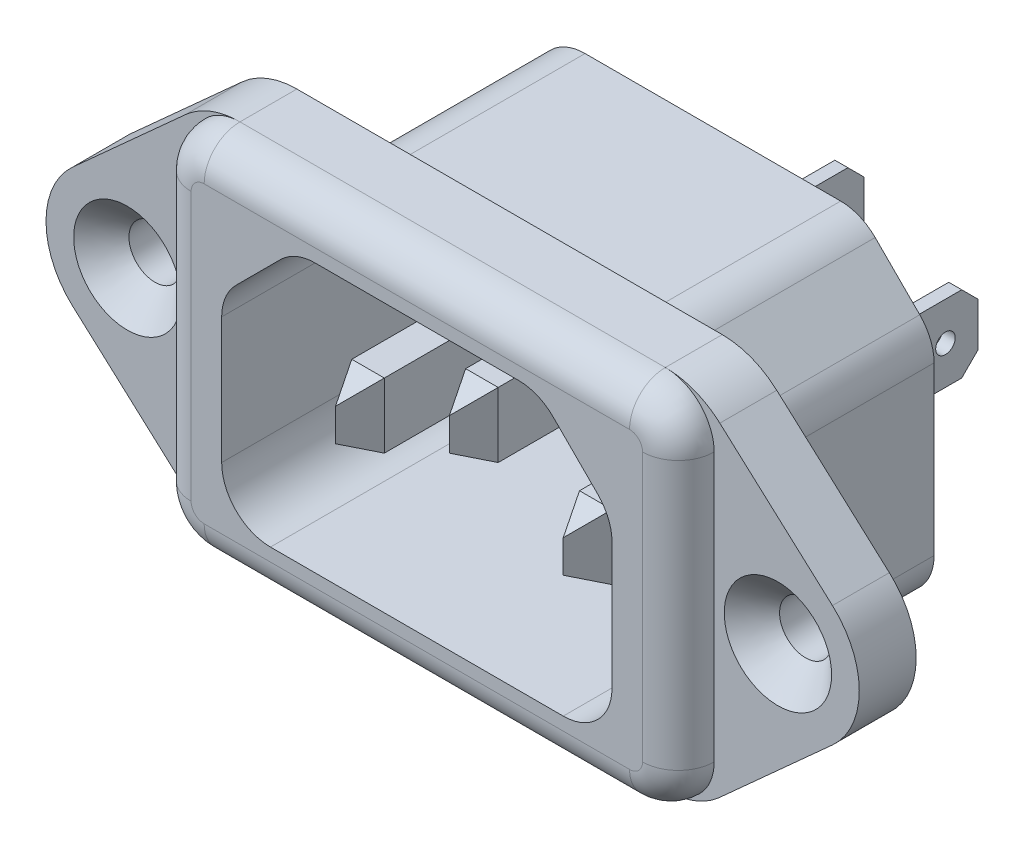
ISO-10303-21;
HEADER;
FILE_DESCRIPTION(('STEP AP214'),'2;1');
FILE_NAME('part.step','',(''),(''),'','','');
FILE_SCHEMA(('AUTOMOTIVE_DESIGN { 1 0 10303 214 1 1 1 1 }'));
ENDSEC;
DATA;
#1=APPLICATION_CONTEXT('core data for automotive mechanical design processes');
#2=APPLICATION_PROTOCOL_DEFINITION('international standard','automotive_design',2000,#1);
#3=PRODUCT_CONTEXT('',#1,'mechanical');
#4=PRODUCT('Part','Part','',(#3));
#5=PRODUCT_RELATED_PRODUCT_CATEGORY('part','',(#4));
#6=PRODUCT_DEFINITION_FORMATION('','',#4);
#7=PRODUCT_DEFINITION_CONTEXT('part definition',#1,'design');
#8=PRODUCT_DEFINITION('design','',#6,#7);
#9=PRODUCT_DEFINITION_SHAPE('','',#8);
#10=(LENGTH_UNIT() NAMED_UNIT(*) SI_UNIT(.MILLI.,.METRE.));
#11=(NAMED_UNIT(*) PLANE_ANGLE_UNIT() SI_UNIT($,.RADIAN.));
#12=(NAMED_UNIT(*) SI_UNIT($,.STERADIAN.) SOLID_ANGLE_UNIT());
#13=UNCERTAINTY_MEASURE_WITH_UNIT(LENGTH_MEASURE(1.E-05),#10,'distance_accuracy_value','');
#14=(GEOMETRIC_REPRESENTATION_CONTEXT(3) GLOBAL_UNCERTAINTY_ASSIGNED_CONTEXT((#13)) GLOBAL_UNIT_ASSIGNED_CONTEXT((#10,
#11,#12)) REPRESENTATION_CONTEXT('',''));
#15=CARTESIAN_POINT('',(0.,0.,0.));
#16=DIRECTION('',(0.,0.,1.));
#17=DIRECTION('',(1.,0.,0.));
#18=AXIS2_PLACEMENT_3D('',#15,#16,#17);
#19=CARTESIAN_POINT('',(10.6,-6.5,-12.5));
#20=DIRECTION('',(0.,0.,-1.));
#21=DIRECTION('',(-1.,0.,0.));
#22=AXIS2_PLACEMENT_3D('',#19,#20,#21);
#23=PLANE('',#22);
#24=DIRECTION('',(0.,1.,0.));
#25=VECTOR('',#24,1.);
#26=CARTESIAN_POINT('',(4.5,-6.2,-12.5));
#27=LINE('',#26,#25);
#28=CARTESIAN_POINT('',(4.5,-6.2,-12.5));
#29=VERTEX_POINT('',#28);
#30=CARTESIAN_POINT('',(4.5,2.7,-12.5));
#31=VERTEX_POINT('',#30);
#32=EDGE_CURVE('E624',#29,#31,#27,.T.);
#33=ORIENTED_EDGE('',*,*,#32,.F.);
#34=DIRECTION('',(-1.,0.,0.));
#35=VECTOR('',#34,1.);
#36=CARTESIAN_POINT('',(9.5,-6.2,-12.5));
#37=LINE('',#36,#35);
#38=CARTESIAN_POINT('',(9.5,-6.2,-12.5));
#39=VERTEX_POINT('',#38);
#40=EDGE_CURVE('E610',#39,#29,#37,.T.);
#41=ORIENTED_EDGE('',*,*,#40,.F.);
#42=DIRECTION('',(0.,-1.,0.));
#43=VECTOR('',#42,1.);
#44=CARTESIAN_POINT('',(9.5,2.7,-12.5));
#45=LINE('',#44,#43);
#46=CARTESIAN_POINT('',(9.5,2.7,-12.5));
#47=VERTEX_POINT('',#46);
#48=EDGE_CURVE('E615',#47,#39,#45,.T.);
#49=ORIENTED_EDGE('',*,*,#48,.F.);
#50=DIRECTION('',(1.,0.,0.));
#51=VECTOR('',#50,1.);
#52=CARTESIAN_POINT('',(4.5,2.7,-12.5));
#53=LINE('',#52,#51);
#54=EDGE_CURVE('E626',#31,#47,#53,.T.);
#55=ORIENTED_EDGE('',*,*,#54,.F.);
#56=EDGE_LOOP('',(#33,#41,#49,#55));
#57=FACE_BOUND('',#56,.T.);
#58=CARTESIAN_POINT('',(10.6,-6.5,-12.5));
#59=DIRECTION('',(0.,0.,-1.));
#60=DIRECTION('',(-1.,0.,0.));
#61=AXIS2_PLACEMENT_3D('',#58,#59,#60);
#62=CIRCLE('',#61,3.);
#63=CARTESIAN_POINT('',(13.6,-6.49999999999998,-12.5));
#64=VERTEX_POINT('',#63);
#65=CARTESIAN_POINT('',(10.6,-9.5,-12.5));
#66=VERTEX_POINT('',#65);
#67=EDGE_CURVE('E885',#64,#66,#62,.T.);
#68=ORIENTED_EDGE('',*,*,#67,.T.);
#69=DIRECTION('',(-1.,0.,0.));
#70=VECTOR('',#69,1.);
#71=CARTESIAN_POINT('',(10.6,-9.5,-12.5));
#72=LINE('',#71,#70);
#73=CARTESIAN_POINT('',(-10.6,-9.5,-12.5));
#74=VERTEX_POINT('',#73);
#75=EDGE_CURVE('E888',#66,#74,#72,.T.);
#76=ORIENTED_EDGE('',*,*,#75,.T.);
#77=CARTESIAN_POINT('',(-10.6,-6.5,-12.5));
#78=DIRECTION('',(0.,0.,-1.));
#79=DIRECTION('',(-1.,0.,0.));
#80=AXIS2_PLACEMENT_3D('',#77,#78,#79);
#81=CIRCLE('',#80,3.);
#82=CARTESIAN_POINT('',(-13.6,-6.49999999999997,-12.5));
#83=VERTEX_POINT('',#82);
#84=EDGE_CURVE('E891',#74,#83,#81,.T.);
#85=ORIENTED_EDGE('',*,*,#84,.T.);
#86=DIRECTION('',(0.,1.,0.));
#87=VECTOR('',#86,1.);
#88=CARTESIAN_POINT('',(-13.6,3.75735931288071,-12.5));
#89=LINE('',#88,#87);
#90=CARTESIAN_POINT('',(-13.6,3.75735931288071,-12.5));
#91=VERTEX_POINT('',#90);
#92=EDGE_CURVE('E893',#83,#91,#89,.T.);
#93=ORIENTED_EDGE('',*,*,#92,.T.);
#94=CARTESIAN_POINT('',(-10.6,3.75735931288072,-12.5));
#95=DIRECTION('',(0.,0.,-1.));
#96=DIRECTION('',(1.,0.,0.));
#97=AXIS2_PLACEMENT_3D('',#94,#95,#96);
#98=CIRCLE('',#97,3.);
#99=CARTESIAN_POINT('',(-12.7213203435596,5.87867965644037,-12.5));
#100=VERTEX_POINT('',#99);
#101=EDGE_CURVE('E895',#91,#100,#98,.T.);
#102=ORIENTED_EDGE('',*,*,#101,.T.);
#103=DIRECTION('',(0.707106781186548,0.707106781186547,0.));
#104=VECTOR('',#103,1.);
#105=CARTESIAN_POINT('',(-9.97867965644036,8.62132034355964,-12.5));
#106=LINE('',#105,#104);
#107=CARTESIAN_POINT('',(-9.97867965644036,8.62132034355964,-12.5));
#108=VERTEX_POINT('',#107);
#109=EDGE_CURVE('E897',#100,#108,#106,.T.);
#110=ORIENTED_EDGE('',*,*,#109,.T.);
#111=CARTESIAN_POINT('',(-7.85735931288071,6.5,-12.5));
#112=DIRECTION('',(0.,0.,-1.));
#113=DIRECTION('',(-1.,0.,0.));
#114=AXIS2_PLACEMENT_3D('',#111,#112,#113);
#115=CIRCLE('',#114,3.);
#116=CARTESIAN_POINT('',(-7.8573593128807,9.5,-12.5));
#117=VERTEX_POINT('',#116);
#118=EDGE_CURVE('E899',#108,#117,#115,.T.);
#119=ORIENTED_EDGE('',*,*,#118,.T.);
#120=DIRECTION('',(1.,0.,0.));
#121=VECTOR('',#120,1.);
#122=CARTESIAN_POINT('',(7.8573593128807,9.5,-12.5));
#123=LINE('',#122,#121);
#124=CARTESIAN_POINT('',(7.8573593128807,9.5,-12.5));
#125=VERTEX_POINT('',#124);
#126=EDGE_CURVE('E901',#117,#125,#123,.T.);
#127=ORIENTED_EDGE('',*,*,#126,.T.);
#128=CARTESIAN_POINT('',(7.85735931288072,6.5,-12.5));
#129=DIRECTION('',(0.,0.,-1.));
#130=DIRECTION('',(1.,0.,0.));
#131=AXIS2_PLACEMENT_3D('',#128,#129,#130);
#132=CIRCLE('',#131,3.);
#133=CARTESIAN_POINT('',(9.97867965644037,8.62132034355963,-12.5));
#134=VERTEX_POINT('',#133);
#135=EDGE_CURVE('E903',#125,#134,#132,.T.);
#136=ORIENTED_EDGE('',*,*,#135,.T.);
#137=DIRECTION('',(0.707106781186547,-0.707106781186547,0.));
#138=VECTOR('',#137,1.);
#139=CARTESIAN_POINT('',(12.7213203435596,5.87867965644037,-12.5));
#140=LINE('',#139,#138);
#141=CARTESIAN_POINT('',(12.7213203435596,5.87867965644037,-12.5));
#142=VERTEX_POINT('',#141);
#143=EDGE_CURVE('E905',#134,#142,#140,.T.);
#144=ORIENTED_EDGE('',*,*,#143,.T.);
#145=CARTESIAN_POINT('',(10.6,3.75735931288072,-12.5));
#146=DIRECTION('',(0.,0.,-1.));
#147=DIRECTION('',(-1.,0.,0.));
#148=AXIS2_PLACEMENT_3D('',#145,#146,#147);
#149=CIRCLE('',#148,3.);
#150=CARTESIAN_POINT('',(13.6,3.7573593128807,-12.5));
#151=VERTEX_POINT('',#150);
#152=EDGE_CURVE('E907',#142,#151,#149,.T.);
#153=ORIENTED_EDGE('',*,*,#152,.T.);
#154=DIRECTION('',(0.,-1.,0.));
#155=VECTOR('',#154,1.);
#156=CARTESIAN_POINT('',(13.6,3.7573593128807,-12.5));
#157=LINE('',#156,#155);
#158=EDGE_CURVE('E909',#151,#64,#157,.T.);
#159=ORIENTED_EDGE('',*,*,#158,.T.);
#160=EDGE_LOOP('',(#68,#76,#85,#93,#102,#110,#119,#127,#136,#144,#153,#159));
#161=FACE_BOUND('',#160,.T.);
#162=DIRECTION('',(0.,1.,0.));
#163=VECTOR('',#162,1.);
#164=CARTESIAN_POINT('',(-2.5,-3.2,-12.5));
#165=LINE('',#164,#163);
#166=CARTESIAN_POINT('',(-2.5,-3.2,-12.5));
#167=VERTEX_POINT('',#166);
#168=CARTESIAN_POINT('',(-2.5,5.7,-12.5));
#169=VERTEX_POINT('',#168);
#170=EDGE_CURVE('E662',#167,#169,#165,.T.);
#171=ORIENTED_EDGE('',*,*,#170,.F.);
#172=DIRECTION('',(-1.,0.,0.));
#173=VECTOR('',#172,1.);
#174=CARTESIAN_POINT('',(2.5,-3.20000000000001,-12.5));
#175=LINE('',#174,#173);
#176=CARTESIAN_POINT('',(2.5,-3.20000000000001,-12.5));
#177=VERTEX_POINT('',#176);
#178=EDGE_CURVE('E648',#177,#167,#175,.T.);
#179=ORIENTED_EDGE('',*,*,#178,.F.);
#180=DIRECTION('',(0.,-1.,0.));
#181=VECTOR('',#180,1.);
#182=CARTESIAN_POINT('',(2.5,5.7,-12.5));
#183=LINE('',#182,#181);
#184=CARTESIAN_POINT('',(2.5,5.7,-12.5));
#185=VERTEX_POINT('',#184);
#186=EDGE_CURVE('E653',#185,#177,#183,.T.);
#187=ORIENTED_EDGE('',*,*,#186,.F.);
#188=DIRECTION('',(1.,0.,0.));
#189=VECTOR('',#188,1.);
#190=CARTESIAN_POINT('',(-2.5,5.7,-12.5));
#191=LINE('',#190,#189);
#192=EDGE_CURVE('E664',#169,#185,#191,.T.);
#193=ORIENTED_EDGE('',*,*,#192,.F.);
#194=EDGE_LOOP('',(#171,#179,#187,#193));
#195=FACE_BOUND('',#194,.T.);
#196=DIRECTION('',(0.,1.,0.));
#197=VECTOR('',#196,1.);
#198=CARTESIAN_POINT('',(-9.5,-6.2,-12.5));
#199=LINE('',#198,#197);
#200=CARTESIAN_POINT('',(-9.5,-6.2,-12.5));
#201=VERTEX_POINT('',#200);
#202=CARTESIAN_POINT('',(-9.5,2.7,-12.5));
#203=VERTEX_POINT('',#202);
#204=EDGE_CURVE('E2495',#201,#203,#199,.T.);
#205=ORIENTED_EDGE('',*,*,#204,.F.);
#206=DIRECTION('',(-1.,0.,0.));
#207=VECTOR('',#206,1.);
#208=CARTESIAN_POINT('',(-4.5,-6.2,-12.5));
#209=LINE('',#208,#207);
#210=CARTESIAN_POINT('',(-4.5,-6.2,-12.5));
#211=VERTEX_POINT('',#210);
#212=EDGE_CURVE('E594',#211,#201,#209,.T.);
#213=ORIENTED_EDGE('',*,*,#212,.F.);
#214=DIRECTION('',(0.,-1.,0.));
#215=VECTOR('',#214,1.);
#216=CARTESIAN_POINT('',(-4.5,2.7,-12.5));
#217=LINE('',#216,#215);
#218=CARTESIAN_POINT('',(-4.5,2.7,-12.5));
#219=VERTEX_POINT('',#218);
#220=EDGE_CURVE('E590',#219,#211,#217,.T.);
#221=ORIENTED_EDGE('',*,*,#220,.F.);
#222=DIRECTION('',(1.,0.,0.));
#223=VECTOR('',#222,1.);
#224=CARTESIAN_POINT('',(-9.5,2.7,-12.5));
#225=LINE('',#224,#223);
#226=EDGE_CURVE('E2497',#203,#219,#225,.T.);
#227=ORIENTED_EDGE('',*,*,#226,.F.);
#228=EDGE_LOOP('',(#205,#213,#221,#227));
#229=FACE_BOUND('',#228,.T.);
#230=ADVANCED_FACE('F30',(#57,#161,#195,#229),#23,.T.);
#231=CARTESIAN_POINT('',(-6.2573593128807,5.25,-10.3));
#232=DIRECTION('',(0.,0.,-1.));
#233=DIRECTION('',(-1.,0.,0.));
#234=AXIS2_PLACEMENT_3D('',#231,#232,#233);
#235=PLANE('',#234);
#236=DIRECTION('',(0.,-1.,0.));
#237=VECTOR('',#236,1.);
#238=CARTESIAN_POINT('',(-8.,-3.75,-10.3));
#239=LINE('',#238,#237);
#240=CARTESIAN_POINT('',(-8.,0.249999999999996,-10.3));
#241=VERTEX_POINT('',#240);
#242=CARTESIAN_POINT('',(-8.,-3.75,-10.3));
#243=VERTEX_POINT('',#242);
#244=EDGE_CURVE('E748',#241,#243,#239,.T.);
#245=ORIENTED_EDGE('',*,*,#244,.F.);
#246=DIRECTION('',(-1.,0.,0.));
#247=VECTOR('',#246,1.);
#248=CARTESIAN_POINT('',(-8.,0.249999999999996,-10.3));
#249=LINE('',#248,#247);
#250=CARTESIAN_POINT('',(-6.,0.249999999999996,-10.3));
#251=VERTEX_POINT('',#250);
#252=EDGE_CURVE('E757',#251,#241,#249,.T.);
#253=ORIENTED_EDGE('',*,*,#252,.F.);
#254=DIRECTION('',(0.,1.,0.));
#255=VECTOR('',#254,1.);
#256=CARTESIAN_POINT('',(-6.,-3.75,-10.3));
#257=LINE('',#256,#255);
#258=CARTESIAN_POINT('',(-6.,-3.75,-10.3));
#259=VERTEX_POINT('',#258);
#260=EDGE_CURVE('E754',#259,#251,#257,.T.);
#261=ORIENTED_EDGE('',*,*,#260,.F.);
#262=DIRECTION('',(1.,0.,0.));
#263=VECTOR('',#262,1.);
#264=CARTESIAN_POINT('',(-8.,-3.75,-10.3));
#265=LINE('',#264,#263);
#266=EDGE_CURVE('E751',#243,#259,#265,.T.);
#267=ORIENTED_EDGE('',*,*,#266,.F.);
#268=EDGE_LOOP('',(#245,#253,#261,#267));
#269=FACE_BOUND('',#268,.T.);
#270=CARTESIAN_POINT('',(-6.2573593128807,5.25,-10.3));
#271=DIRECTION('',(0.,0.,1.));
#272=DIRECTION('',(-1.,0.,0.));
#273=AXIS2_PLACEMENT_3D('',#270,#271,#272);
#274=CIRCLE('',#273,3.);
#275=CARTESIAN_POINT('',(-6.25735931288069,8.25,-10.3));
#276=VERTEX_POINT('',#275);
#277=CARTESIAN_POINT('',(-8.37867965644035,7.37132034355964,-10.3));
#278=VERTEX_POINT('',#277);
#279=EDGE_CURVE('E789',#276,#278,#274,.T.);
#280=ORIENTED_EDGE('',*,*,#279,.T.);
#281=DIRECTION('',(-0.707106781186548,-0.707106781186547,0.));
#282=VECTOR('',#281,1.);
#283=CARTESIAN_POINT('',(-11.1213203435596,4.62867965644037,-10.3));
#284=LINE('',#283,#282);
#285=CARTESIAN_POINT('',(-11.1213203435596,4.62867965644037,-10.3));
#286=VERTEX_POINT('',#285);
#287=EDGE_CURVE('E792',#278,#286,#284,.T.);
#288=ORIENTED_EDGE('',*,*,#287,.T.);
#289=CARTESIAN_POINT('',(-9.,2.50735931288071,-10.3));
#290=DIRECTION('',(0.,0.,1.));
#291=DIRECTION('',(1.,0.,0.));
#292=AXIS2_PLACEMENT_3D('',#289,#290,#291);
#293=CIRCLE('',#292,3.);
#294=CARTESIAN_POINT('',(-12.,2.5073593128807,-10.3));
#295=VERTEX_POINT('',#294);
#296=EDGE_CURVE('E796',#286,#295,#293,.T.);
#297=ORIENTED_EDGE('',*,*,#296,.T.);
#298=DIRECTION('',(0.,-1.,0.));
#299=VECTOR('',#298,1.);
#300=CARTESIAN_POINT('',(-12.,-5.24999999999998,-10.3));
#301=LINE('',#300,#299);
#302=CARTESIAN_POINT('',(-12.,-5.24999999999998,-10.3));
#303=VERTEX_POINT('',#302);
#304=EDGE_CURVE('E799',#295,#303,#301,.T.);
#305=ORIENTED_EDGE('',*,*,#304,.T.);
#306=CARTESIAN_POINT('',(-9.,-5.25,-10.3));
#307=DIRECTION('',(0.,0.,1.));
#308=DIRECTION('',(-1.,0.,0.));
#309=AXIS2_PLACEMENT_3D('',#306,#307,#308);
#310=CIRCLE('',#309,3.);
#311=CARTESIAN_POINT('',(-8.99999999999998,-8.25,-10.3));
#312=VERTEX_POINT('',#311);
#313=EDGE_CURVE('E802',#303,#312,#310,.T.);
#314=ORIENTED_EDGE('',*,*,#313,.T.);
#315=DIRECTION('',(1.,0.,0.));
#316=VECTOR('',#315,1.);
#317=CARTESIAN_POINT('',(-8.99999999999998,-8.25,-10.3));
#318=LINE('',#317,#316);
#319=CARTESIAN_POINT('',(8.99999999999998,-8.25,-10.3));
#320=VERTEX_POINT('',#319);
#321=EDGE_CURVE('E805',#312,#320,#318,.T.);
#322=ORIENTED_EDGE('',*,*,#321,.T.);
#323=CARTESIAN_POINT('',(9.00000000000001,-5.25,-10.3));
#324=DIRECTION('',(0.,0.,1.));
#325=DIRECTION('',(1.,0.,0.));
#326=AXIS2_PLACEMENT_3D('',#323,#324,#325);
#327=CIRCLE('',#326,3.);
#328=CARTESIAN_POINT('',(12.,-5.24999999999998,-10.3));
#329=VERTEX_POINT('',#328);
#330=EDGE_CURVE('E808',#320,#329,#327,.T.);
#331=ORIENTED_EDGE('',*,*,#330,.T.);
#332=DIRECTION('',(0.,1.,0.));
#333=VECTOR('',#332,1.);
#334=CARTESIAN_POINT('',(12.,-5.24999999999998,-10.3));
#335=LINE('',#334,#333);
#336=CARTESIAN_POINT('',(12.,2.5073593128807,-10.3));
#337=VERTEX_POINT('',#336);
#338=EDGE_CURVE('E811',#329,#337,#335,.T.);
#339=ORIENTED_EDGE('',*,*,#338,.T.);
#340=CARTESIAN_POINT('',(9.00000000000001,2.50735931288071,-10.3));
#341=DIRECTION('',(0.,0.,1.));
#342=DIRECTION('',(-1.,0.,0.));
#343=AXIS2_PLACEMENT_3D('',#340,#341,#342);
#344=CIRCLE('',#343,3.);
#345=CARTESIAN_POINT('',(11.1213203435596,4.62867965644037,-10.3));
#346=VERTEX_POINT('',#345);
#347=EDGE_CURVE('E814',#337,#346,#344,.T.);
#348=ORIENTED_EDGE('',*,*,#347,.T.);
#349=DIRECTION('',(-0.707106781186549,0.707106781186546,0.));
#350=VECTOR('',#349,1.);
#351=CARTESIAN_POINT('',(8.37867965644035,7.37132034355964,-10.3));
#352=LINE('',#351,#350);
#353=CARTESIAN_POINT('',(8.37867965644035,7.37132034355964,-10.3));
#354=VERTEX_POINT('',#353);
#355=EDGE_CURVE('E817',#346,#354,#352,.T.);
#356=ORIENTED_EDGE('',*,*,#355,.T.);
#357=CARTESIAN_POINT('',(6.25735931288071,5.25,-10.3));
#358=DIRECTION('',(0.,0.,1.));
#359=DIRECTION('',(1.,0.,0.));
#360=AXIS2_PLACEMENT_3D('',#357,#358,#359);
#361=CIRCLE('',#360,3.);
#362=CARTESIAN_POINT('',(6.25735931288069,8.25,-10.3));
#363=VERTEX_POINT('',#362);
#364=EDGE_CURVE('E820',#354,#363,#361,.T.);
#365=ORIENTED_EDGE('',*,*,#364,.T.);
#366=DIRECTION('',(-1.,0.,0.));
#367=VECTOR('',#366,1.);
#368=CARTESIAN_POINT('',(-6.25735931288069,8.25,-10.3));
#369=LINE('',#368,#367);
#370=EDGE_CURVE('E823',#363,#276,#369,.T.);
#371=ORIENTED_EDGE('',*,*,#370,.T.);
#372=EDGE_LOOP('',(#280,#288,#297,#305,#314,#322,#331,#339,#348,#356,#365,#371));
#373=FACE_BOUND('',#372,.T.);
#374=DIRECTION('',(0.,-1.,0.));
#375=VECTOR('',#374,1.);
#376=CARTESIAN_POINT('',(-1.,-0.750000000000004,-10.3));
#377=LINE('',#376,#375);
#378=CARTESIAN_POINT('',(-1.,3.25,-10.3));
#379=VERTEX_POINT('',#378);
#380=CARTESIAN_POINT('',(-1.,-0.750000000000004,-10.3));
#381=VERTEX_POINT('',#380);
#382=EDGE_CURVE('E768',#379,#381,#377,.T.);
#383=ORIENTED_EDGE('',*,*,#382,.F.);
#384=DIRECTION('',(-1.,0.,0.));
#385=VECTOR('',#384,1.);
#386=CARTESIAN_POINT('',(-1.,3.25,-10.3));
#387=LINE('',#386,#385);
#388=CARTESIAN_POINT('',(1.,3.25,-10.3));
#389=VERTEX_POINT('',#388);
#390=EDGE_CURVE('E777',#389,#379,#387,.T.);
#391=ORIENTED_EDGE('',*,*,#390,.F.);
#392=DIRECTION('',(0.,1.,0.));
#393=VECTOR('',#392,1.);
#394=CARTESIAN_POINT('',(1.,-0.750000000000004,-10.3));
#395=LINE('',#394,#393);
#396=CARTESIAN_POINT('',(1.,-0.750000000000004,-10.3));
#397=VERTEX_POINT('',#396);
#398=EDGE_CURVE('E774',#397,#389,#395,.T.);
#399=ORIENTED_EDGE('',*,*,#398,.F.);
#400=DIRECTION('',(1.,0.,0.));
#401=VECTOR('',#400,1.);
#402=CARTESIAN_POINT('',(-1.,-0.750000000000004,-10.3));
#403=LINE('',#402,#401);
#404=EDGE_CURVE('E771',#381,#397,#403,.T.);
#405=ORIENTED_EDGE('',*,*,#404,.F.);
#406=EDGE_LOOP('',(#383,#391,#399,#405));
#407=FACE_BOUND('',#406,.T.);
#408=DIRECTION('',(1.,0.,0.));
#409=VECTOR('',#408,1.);
#410=CARTESIAN_POINT('',(8.,-3.75,-10.3));
#411=LINE('',#410,#409);
#412=CARTESIAN_POINT('',(6.,-3.75,-10.3));
#413=VERTEX_POINT('',#412);
#414=CARTESIAN_POINT('',(8.,-3.75,-10.3));
#415=VERTEX_POINT('',#414);
#416=EDGE_CURVE('E728',#413,#415,#411,.T.);
#417=ORIENTED_EDGE('',*,*,#416,.F.);
#418=DIRECTION('',(0.,-1.,0.));
#419=VECTOR('',#418,1.);
#420=CARTESIAN_POINT('',(6.,-3.75,-10.3));
#421=LINE('',#420,#419);
#422=CARTESIAN_POINT('',(6.,0.249999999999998,-10.3));
#423=VERTEX_POINT('',#422);
#424=EDGE_CURVE('E737',#423,#413,#421,.T.);
#425=ORIENTED_EDGE('',*,*,#424,.F.);
#426=DIRECTION('',(-1.,0.,0.));
#427=VECTOR('',#426,1.);
#428=CARTESIAN_POINT('',(8.,0.249999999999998,-10.3));
#429=LINE('',#428,#427);
#430=CARTESIAN_POINT('',(8.,0.249999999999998,-10.3));
#431=VERTEX_POINT('',#430);
#432=EDGE_CURVE('E734',#431,#423,#429,.T.);
#433=ORIENTED_EDGE('',*,*,#432,.F.);
#434=DIRECTION('',(0.,1.,0.));
#435=VECTOR('',#434,1.);
#436=CARTESIAN_POINT('',(8.,-3.75,-10.3));
#437=LINE('',#436,#435);
#438=EDGE_CURVE('E731',#415,#431,#437,.T.);
#439=ORIENTED_EDGE('',*,*,#438,.F.);
#440=EDGE_LOOP('',(#417,#425,#433,#439));
#441=FACE_BOUND('',#440,.T.);
#442=ADVANCED_FACE('F1363',(#269,#373,#407,#441),#235,.F.);
#443=CARTESIAN_POINT('',(-20.,0.,0.));
#444=DIRECTION('',(0.,0.,1.));
#445=DIRECTION('',(1.,0.,0.));
#446=AXIS2_PLACEMENT_3D('',#443,#444,#445);
#447=PLANE('',#446);
#448=CARTESIAN_POINT('',(20.,0.,0.));
#449=DIRECTION('',(0.,0.,1.));
#450=DIRECTION('',(1.,0.,0.));
#451=AXIS2_PLACEMENT_3D('',#448,#449,#450);
#452=CIRCLE('',#451,1.6);
#453=CARTESIAN_POINT('',(21.6,0.,0.));
#454=VERTEX_POINT('',#453);
#455=EDGE_CURVE('E1160',#454,#454,#452,.T.);
#456=ORIENTED_EDGE('',*,*,#455,.T.);
#457=EDGE_LOOP('',(#456));
#458=FACE_BOUND('',#457,.T.);
#459=CARTESIAN_POINT('',(-20.,0.,0.));
#460=DIRECTION('',(0.,0.,1.));
#461=DIRECTION('',(1.,0.,0.));
#462=AXIS2_PLACEMENT_3D('',#459,#460,#461);
#463=CIRCLE('',#462,1.6);
#464=CARTESIAN_POINT('',(-18.4,0.,0.));
#465=VERTEX_POINT('',#464);
#466=EDGE_CURVE('E1156',#465,#465,#463,.T.);
#467=ORIENTED_EDGE('',*,*,#466,.T.);
#468=EDGE_LOOP('',(#467));
#469=FACE_BOUND('',#468,.T.);
#470=CARTESIAN_POINT('',(-20.,0.,0.));
#471=DIRECTION('',(0.,0.,1.));
#472=DIRECTION('',(1.,0.,0.));
#473=AXIS2_PLACEMENT_3D('',#470,#471,#472);
#474=CIRCLE('',#473,5.00000000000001);
#475=CARTESIAN_POINT('',(-23.3505154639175,3.71134020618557,0.));
#476=VERTEX_POINT('',#475);
#477=CARTESIAN_POINT('',(-23.3505154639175,-3.71134020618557,0.));
#478=VERTEX_POINT('',#477);
#479=EDGE_CURVE('E999',#476,#478,#474,.T.);
#480=ORIENTED_EDGE('',*,*,#479,.F.);
#481=DIRECTION('',(-0.742268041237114,-0.670103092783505,0.));
#482=VECTOR('',#481,1.);
#483=CARTESIAN_POINT('',(-16.4274385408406,9.96134020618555,0.));
#484=LINE('',#483,#482);
#485=CARTESIAN_POINT('',(-16.4274385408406,9.96134020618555,0.));
#486=VERTEX_POINT('',#485);
#487=EDGE_CURVE('E1004',#486,#476,#484,.T.);
#488=ORIENTED_EDGE('',*,*,#487,.F.);
#489=CARTESIAN_POINT('',(-13.0769230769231,6.25,0.));
#490=DIRECTION('',(0.,0.,1.));
#491=DIRECTION('',(1.,0.,0.));
#492=AXIS2_PLACEMENT_3D('',#489,#490,#491);
#493=CIRCLE('',#492,5.);
#494=CARTESIAN_POINT('',(-13.0769230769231,11.25,0.));
#495=VERTEX_POINT('',#494);
#496=EDGE_CURVE('E1045',#495,#486,#493,.T.);
#497=ORIENTED_EDGE('',*,*,#496,.F.);
#498=DIRECTION('',(-1.,0.,0.));
#499=VECTOR('',#498,1.);
#500=CARTESIAN_POINT('',(13.0769230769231,11.25,0.));
#501=LINE('',#500,#499);
#502=CARTESIAN_POINT('',(13.0769230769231,11.25,0.));
#503=VERTEX_POINT('',#502);
#504=EDGE_CURVE('E1043',#503,#495,#501,.T.);
#505=ORIENTED_EDGE('',*,*,#504,.F.);
#506=CARTESIAN_POINT('',(13.0769230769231,6.25,0.));
#507=DIRECTION('',(0.,0.,1.));
#508=DIRECTION('',(1.,0.,0.));
#509=AXIS2_PLACEMENT_3D('',#506,#507,#508);
#510=CIRCLE('',#509,5.);
#511=CARTESIAN_POINT('',(16.4274385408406,9.96134020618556,0.));
#512=VERTEX_POINT('',#511);
#513=EDGE_CURVE('E1041',#512,#503,#510,.T.);
#514=ORIENTED_EDGE('',*,*,#513,.F.);
#515=DIRECTION('',(-0.742268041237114,0.670103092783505,0.));
#516=VECTOR('',#515,1.);
#517=CARTESIAN_POINT('',(16.4274385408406,9.96134020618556,0.));
#518=LINE('',#517,#516);
#519=CARTESIAN_POINT('',(23.3505154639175,3.71134020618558,0.));
#520=VERTEX_POINT('',#519);
#521=EDGE_CURVE('E1039',#520,#512,#518,.T.);
#522=ORIENTED_EDGE('',*,*,#521,.F.);
#523=CARTESIAN_POINT('',(20.,0.,0.));
#524=DIRECTION('',(0.,0.,1.));
#525=DIRECTION('',(-1.,0.,0.));
#526=AXIS2_PLACEMENT_3D('',#523,#524,#525);
#527=CIRCLE('',#526,5.00000000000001);
#528=CARTESIAN_POINT('',(23.3505154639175,-3.71134020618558,0.));
#529=VERTEX_POINT('',#528);
#530=EDGE_CURVE('E1037',#529,#520,#527,.T.);
#531=ORIENTED_EDGE('',*,*,#530,.F.);
#532=DIRECTION('',(0.742268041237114,0.670103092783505,0.));
#533=VECTOR('',#532,1.);
#534=CARTESIAN_POINT('',(23.3505154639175,-3.71134020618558,0.));
#535=LINE('',#534,#533);
#536=CARTESIAN_POINT('',(16.4274385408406,-9.96134020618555,0.));
#537=VERTEX_POINT('',#536);
#538=EDGE_CURVE('E1035',#537,#529,#535,.T.);
#539=ORIENTED_EDGE('',*,*,#538,.F.);
#540=CARTESIAN_POINT('',(13.0769230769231,-6.25,0.));
#541=DIRECTION('',(0.,0.,1.));
#542=DIRECTION('',(-1.,0.,0.));
#543=AXIS2_PLACEMENT_3D('',#540,#541,#542);
#544=CIRCLE('',#543,5.);
#545=CARTESIAN_POINT('',(13.0769230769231,-11.25,0.));
#546=VERTEX_POINT('',#545);
#547=EDGE_CURVE('E1033',#546,#537,#544,.T.);
#548=ORIENTED_EDGE('',*,*,#547,.F.);
#549=DIRECTION('',(1.,0.,0.));
#550=VECTOR('',#549,1.);
#551=CARTESIAN_POINT('',(-13.0769230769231,-11.25,0.));
#552=LINE('',#551,#550);
#553=CARTESIAN_POINT('',(-13.0769230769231,-11.25,0.));
#554=VERTEX_POINT('',#553);
#555=EDGE_CURVE('E1031',#554,#546,#552,.T.);
#556=ORIENTED_EDGE('',*,*,#555,.F.);
#557=CARTESIAN_POINT('',(-13.0769230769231,-6.25,0.));
#558=DIRECTION('',(0.,0.,1.));
#559=DIRECTION('',(1.,0.,0.));
#560=AXIS2_PLACEMENT_3D('',#557,#558,#559);
#561=CIRCLE('',#560,5.);
#562=CARTESIAN_POINT('',(-16.4274385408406,-9.96134020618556,0.));
#563=VERTEX_POINT('',#562);
#564=EDGE_CURVE('E1029',#563,#554,#561,.T.);
#565=ORIENTED_EDGE('',*,*,#564,.F.);
#566=DIRECTION('',(0.742268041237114,-0.670103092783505,0.));
#567=VECTOR('',#566,1.);
#568=CARTESIAN_POINT('',(-23.3505154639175,-3.71134020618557,0.));
#569=LINE('',#568,#567);
#570=EDGE_CURVE('E1027',#478,#563,#569,.T.);
#571=ORIENTED_EDGE('',*,*,#570,.F.);
#572=EDGE_LOOP('',(#480,#488,#497,#505,#514,#522,#531,#539,#548,#556,#565,#571));
#573=FACE_BOUND('',#572,.T.);
#574=CARTESIAN_POINT('',(10.6,-6.5,0.));
#575=DIRECTION('',(0.,0.,-1.));
#576=DIRECTION('',(-1.,0.,0.));
#577=AXIS2_PLACEMENT_3D('',#574,#575,#576);
#578=CIRCLE('',#577,3.);
#579=CARTESIAN_POINT('',(13.6,-6.49999999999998,0.));
#580=VERTEX_POINT('',#579);
#581=CARTESIAN_POINT('',(10.6,-9.5,0.));
#582=VERTEX_POINT('',#581);
#583=EDGE_CURVE('E862',#580,#582,#578,.T.);
#584=ORIENTED_EDGE('',*,*,#583,.F.);
#585=DIRECTION('',(0.,-1.,0.));
#586=VECTOR('',#585,1.);
#587=CARTESIAN_POINT('',(13.6,3.7573593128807,0.));
#588=LINE('',#587,#586);
#589=CARTESIAN_POINT('',(13.6,3.7573593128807,0.));
#590=VERTEX_POINT('',#589);
#591=EDGE_CURVE('E889',#590,#580,#588,.T.);
#592=ORIENTED_EDGE('',*,*,#591,.F.);
#593=CARTESIAN_POINT('',(10.6,3.75735931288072,0.));
#594=DIRECTION('',(0.,0.,-1.));
#595=DIRECTION('',(-1.,0.,0.));
#596=AXIS2_PLACEMENT_3D('',#593,#594,#595);
#597=CIRCLE('',#596,3.);
#598=CARTESIAN_POINT('',(12.7213203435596,5.87867965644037,0.));
#599=VERTEX_POINT('',#598);
#600=EDGE_CURVE('E941',#599,#590,#597,.T.);
#601=ORIENTED_EDGE('',*,*,#600,.F.);
#602=DIRECTION('',(0.707106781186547,-0.707106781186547,0.));
#603=VECTOR('',#602,1.);
#604=CARTESIAN_POINT('',(12.7213203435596,5.87867965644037,0.));
#605=LINE('',#604,#603);
#606=CARTESIAN_POINT('',(9.97867965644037,8.62132034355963,0.));
#607=VERTEX_POINT('',#606);
#608=EDGE_CURVE('E938',#607,#599,#605,.T.);
#609=ORIENTED_EDGE('',*,*,#608,.F.);
#610=CARTESIAN_POINT('',(7.85735931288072,6.5,0.));
#611=DIRECTION('',(0.,0.,-1.));
#612=DIRECTION('',(1.,0.,0.));
#613=AXIS2_PLACEMENT_3D('',#610,#611,#612);
#614=CIRCLE('',#613,3.);
#615=CARTESIAN_POINT('',(7.8573593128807,9.5,0.));
#616=VERTEX_POINT('',#615);
#617=EDGE_CURVE('E935',#616,#607,#614,.T.);
#618=ORIENTED_EDGE('',*,*,#617,.F.);
#619=DIRECTION('',(1.,0.,0.));
#620=VECTOR('',#619,1.);
#621=CARTESIAN_POINT('',(7.8573593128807,9.5,0.));
#622=LINE('',#621,#620);
#623=CARTESIAN_POINT('',(-7.8573593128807,9.5,0.));
#624=VERTEX_POINT('',#623);
#625=EDGE_CURVE('E932',#624,#616,#622,.T.);
#626=ORIENTED_EDGE('',*,*,#625,.F.);
#627=CARTESIAN_POINT('',(-7.85735931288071,6.5,0.));
#628=DIRECTION('',(0.,0.,-1.));
#629=DIRECTION('',(-1.,0.,0.));
#630=AXIS2_PLACEMENT_3D('',#627,#628,#629);
#631=CIRCLE('',#630,3.);
#632=CARTESIAN_POINT('',(-9.97867965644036,8.62132034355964,0.));
#633=VERTEX_POINT('',#632);
#634=EDGE_CURVE('E929',#633,#624,#631,.T.);
#635=ORIENTED_EDGE('',*,*,#634,.F.);
#636=DIRECTION('',(0.707106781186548,0.707106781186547,0.));
#637=VECTOR('',#636,1.);
#638=CARTESIAN_POINT('',(-9.97867965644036,8.62132034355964,0.));
#639=LINE('',#638,#637);
#640=CARTESIAN_POINT('',(-12.7213203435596,5.87867965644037,0.));
#641=VERTEX_POINT('',#640);
#642=EDGE_CURVE('E926',#641,#633,#639,.T.);
#643=ORIENTED_EDGE('',*,*,#642,.F.);
#644=CARTESIAN_POINT('',(-10.6,3.75735931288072,0.));
#645=DIRECTION('',(0.,0.,-1.));
#646=DIRECTION('',(1.,0.,0.));
#647=AXIS2_PLACEMENT_3D('',#644,#645,#646);
#648=CIRCLE('',#647,3.);
#649=CARTESIAN_POINT('',(-13.6,3.75735931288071,0.));
#650=VERTEX_POINT('',#649);
#651=EDGE_CURVE('E923',#650,#641,#648,.T.);
#652=ORIENTED_EDGE('',*,*,#651,.F.);
#653=DIRECTION('',(0.,1.,0.));
#654=VECTOR('',#653,1.);
#655=CARTESIAN_POINT('',(-13.6,3.75735931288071,0.));
#656=LINE('',#655,#654);
#657=CARTESIAN_POINT('',(-13.6,-6.49999999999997,0.));
#658=VERTEX_POINT('',#657);
#659=EDGE_CURVE('E920',#658,#650,#656,.T.);
#660=ORIENTED_EDGE('',*,*,#659,.F.);
#661=CARTESIAN_POINT('',(-10.6,-6.5,0.));
#662=DIRECTION('',(0.,0.,-1.));
#663=DIRECTION('',(-1.,0.,0.));
#664=AXIS2_PLACEMENT_3D('',#661,#662,#663);
#665=CIRCLE('',#664,3.);
#666=CARTESIAN_POINT('',(-10.6,-9.5,0.));
#667=VERTEX_POINT('',#666);
#668=EDGE_CURVE('E917',#667,#658,#665,.T.);
#669=ORIENTED_EDGE('',*,*,#668,.F.);
#670=DIRECTION('',(-1.,0.,0.));
#671=VECTOR('',#670,1.);
#672=CARTESIAN_POINT('',(10.6,-9.5,0.));
#673=LINE('',#672,#671);
#674=EDGE_CURVE('E914',#582,#667,#673,.T.);
#675=ORIENTED_EDGE('',*,*,#674,.F.);
#676=EDGE_LOOP('',(#584,#592,#601,#609,#618,#626,#635,#643,#652,#660,#669,#675));
#677=FACE_BOUND('',#676,.T.);
#678=ADVANCED_FACE('F1291',(#458,#469,#573,#677),#447,.F.);
#679=CARTESIAN_POINT('',(-20.,0.,3.5));
#680=DIRECTION('',(0.,0.,1.));
#681=DIRECTION('',(1.,0.,0.));
#682=AXIS2_PLACEMENT_3D('',#679,#680,#681);
#683=PLANE('',#682);
#684=CARTESIAN_POINT('',(20.,0.,3.5));
#685=DIRECTION('',(0.,0.,1.));
#686=DIRECTION('',(1.,0.,0.));
#687=AXIS2_PLACEMENT_3D('',#684,#685,#686);
#688=CIRCLE('',#687,3.3);
#689=CARTESIAN_POINT('',(23.3,0.,3.5));
#690=VERTEX_POINT('',#689);
#691=EDGE_CURVE('E1206',#690,#690,#688,.T.);
#692=ORIENTED_EDGE('',*,*,#691,.F.);
#693=EDGE_LOOP('',(#692));
#694=FACE_BOUND('',#693,.T.);
#695=CARTESIAN_POINT('',(13.0769230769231,8.25,3.5));
#696=DIRECTION('',(0.,0.,1.));
#697=DIRECTION('',(-1.,0.,0.));
#698=AXIS2_PLACEMENT_3D('',#695,#696,#697);
#699=CIRCLE('',#698,3.);
#700=CARTESIAN_POINT('',(16.0769230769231,8.25,3.5));
#701=VERTEX_POINT('',#700);
#702=CARTESIAN_POINT('',(13.0769230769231,11.25,3.5));
#703=VERTEX_POINT('',#702);
#704=EDGE_CURVE('E996',#701,#703,#699,.T.);
#705=ORIENTED_EDGE('',*,*,#704,.F.);
#706=DIRECTION('',(0.,1.,0.));
#707=VECTOR('',#706,1.);
#708=CARTESIAN_POINT('',(16.0769230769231,-8.25,3.5));
#709=LINE('',#708,#707);
#710=CARTESIAN_POINT('',(16.0769230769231,-8.25,3.5));
#711=VERTEX_POINT('',#710);
#712=EDGE_CURVE('E993',#711,#701,#709,.T.);
#713=ORIENTED_EDGE('',*,*,#712,.F.);
#714=CARTESIAN_POINT('',(13.0769230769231,-8.25,3.5));
#715=DIRECTION('',(0.,0.,1.));
#716=DIRECTION('',(1.,0.,0.));
#717=AXIS2_PLACEMENT_3D('',#714,#715,#716);
#718=CIRCLE('',#717,3.);
#719=CARTESIAN_POINT('',(13.0769230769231,-11.25,3.5));
#720=VERTEX_POINT('',#719);
#721=EDGE_CURVE('E990',#720,#711,#718,.T.);
#722=ORIENTED_EDGE('',*,*,#721,.F.);
#723=CARTESIAN_POINT('',(13.0769230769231,-6.25,3.5));
#724=DIRECTION('',(0.,0.,1.));
#725=DIRECTION('',(-1.,0.,0.));
#726=AXIS2_PLACEMENT_3D('',#723,#724,#725);
#727=CIRCLE('',#726,5.);
#728=CARTESIAN_POINT('',(16.4274385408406,-9.96134020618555,3.5));
#729=VERTEX_POINT('',#728);
#730=EDGE_CURVE('E1009',#720,#729,#727,.T.);
#731=ORIENTED_EDGE('',*,*,#730,.T.);
#732=DIRECTION('',(0.742268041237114,0.670103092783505,0.));
#733=VECTOR('',#732,1.);
#734=CARTESIAN_POINT('',(23.3505154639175,-3.71134020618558,3.5));
#735=LINE('',#734,#733);
#736=CARTESIAN_POINT('',(23.3505154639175,-3.71134020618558,3.5));
#737=VERTEX_POINT('',#736);
#738=EDGE_CURVE('E1011',#729,#737,#735,.T.);
#739=ORIENTED_EDGE('',*,*,#738,.T.);
#740=CARTESIAN_POINT('',(20.,0.,3.5));
#741=DIRECTION('',(0.,0.,1.));
#742=DIRECTION('',(-1.,0.,0.));
#743=AXIS2_PLACEMENT_3D('',#740,#741,#742);
#744=CIRCLE('',#743,5.00000000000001);
#745=CARTESIAN_POINT('',(23.3505154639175,3.71134020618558,3.5));
#746=VERTEX_POINT('',#745);
#747=EDGE_CURVE('E1013',#737,#746,#744,.T.);
#748=ORIENTED_EDGE('',*,*,#747,.T.);
#749=DIRECTION('',(-0.742268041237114,0.670103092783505,0.));
#750=VECTOR('',#749,1.);
#751=CARTESIAN_POINT('',(16.4274385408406,9.96134020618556,3.5));
#752=LINE('',#751,#750);
#753=CARTESIAN_POINT('',(16.4274385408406,9.96134020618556,3.5));
#754=VERTEX_POINT('',#753);
#755=EDGE_CURVE('E1015',#746,#754,#752,.T.);
#756=ORIENTED_EDGE('',*,*,#755,.T.);
#757=CARTESIAN_POINT('',(13.0769230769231,6.25,3.5));
#758=DIRECTION('',(0.,0.,1.));
#759=DIRECTION('',(1.,0.,0.));
#760=AXIS2_PLACEMENT_3D('',#757,#758,#759);
#761=CIRCLE('',#760,5.);
#762=EDGE_CURVE('E1017',#754,#703,#761,.T.);
#763=ORIENTED_EDGE('',*,*,#762,.T.);
#764=EDGE_LOOP('',(#705,#713,#722,#731,#739,#748,#756,#763));
#765=FACE_BOUND('',#764,.T.);
#766=ADVANCED_FACE('F1306',(#694,#765),#683,.T.);
#767=CARTESIAN_POINT('',(-20.,0.,3.5));
#768=DIRECTION('',(0.,0.,-1.));
#769=DIRECTION('',(-1.,0.,0.));
#770=AXIS2_PLACEMENT_3D('',#767,#768,#769);
#771=CYLINDRICAL_SURFACE('',#770,5.00000000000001);
#772=ORIENTED_EDGE('',*,*,#479,.T.);
#773=DIRECTION('',(0.,0.,-1.));
#774=VECTOR('',#773,1.);
#775=CARTESIAN_POINT('',(-23.3505154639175,-3.71134020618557,3.5));
#776=LINE('',#775,#774);
#777=CARTESIAN_POINT('',(-23.3505154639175,-3.71134020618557,3.5));
#778=VERTEX_POINT('',#777);
#779=EDGE_CURVE('E1080',#778,#478,#776,.T.);
#780=ORIENTED_EDGE('',*,*,#779,.F.);
#781=CARTESIAN_POINT('',(-20.,0.,3.5));
#782=DIRECTION('',(0.,0.,1.));
#783=DIRECTION('',(1.,0.,0.));
#784=AXIS2_PLACEMENT_3D('',#781,#782,#783);
#785=CIRCLE('',#784,5.00000000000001);
#786=CARTESIAN_POINT('',(-23.3505154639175,3.71134020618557,3.5));
#787=VERTEX_POINT('',#786);
#788=EDGE_CURVE('E1000',#787,#778,#785,.T.);
#789=ORIENTED_EDGE('',*,*,#788,.F.);
#790=DIRECTION('',(0.,0.,-1.));
#791=VECTOR('',#790,1.);
#792=CARTESIAN_POINT('',(-23.3505154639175,3.71134020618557,3.5));
#793=LINE('',#792,#791);
#794=EDGE_CURVE('E1024',#787,#476,#793,.T.);
#795=ORIENTED_EDGE('',*,*,#794,.T.);
#796=EDGE_LOOP('',(#772,#780,#789,#795));
#797=FACE_BOUND('',#796,.T.);
#798=ADVANCED_FACE('F1351',(#797),#771,.T.);
#799=CARTESIAN_POINT('',(-23.3505154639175,-3.71134020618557,3.5));
#800=DIRECTION('',(0.670103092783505,0.742268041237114,0.));
#801=DIRECTION('',(-0.742268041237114,0.670103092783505,0.));
#802=AXIS2_PLACEMENT_3D('',#799,#800,#801);
#803=PLANE('',#802);
#804=ORIENTED_EDGE('',*,*,#570,.T.);
#805=DIRECTION('',(0.,0.,-1.));
#806=VECTOR('',#805,1.);
#807=CARTESIAN_POINT('',(-16.4274385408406,-9.96134020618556,3.5));
#808=LINE('',#807,#806);
#809=CARTESIAN_POINT('',(-16.4274385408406,-9.96134020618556,3.5));
#810=VERTEX_POINT('',#809);
#811=EDGE_CURVE('E1077',#810,#563,#808,.T.);
#812=ORIENTED_EDGE('',*,*,#811,.F.);
#813=DIRECTION('',(0.742268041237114,-0.670103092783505,0.));
#814=VECTOR('',#813,1.);
#815=CARTESIAN_POINT('',(-23.3505154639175,-3.71134020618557,3.5));
#816=LINE('',#815,#814);
#817=EDGE_CURVE('E1003',#778,#810,#816,.T.);
#818=ORIENTED_EDGE('',*,*,#817,.F.);
#819=ORIENTED_EDGE('',*,*,#779,.T.);
#820=EDGE_LOOP('',(#804,#812,#818,#819));
#821=FACE_BOUND('',#820,.T.);
#822=ADVANCED_FACE('F1353',(#821),#803,.F.);
#823=CARTESIAN_POINT('',(-13.0769230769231,-6.25,3.5));
#824=DIRECTION('',(0.,0.,-1.));
#825=DIRECTION('',(-1.,0.,0.));
#826=AXIS2_PLACEMENT_3D('',#823,#824,#825);
#827=CYLINDRICAL_SURFACE('',#826,5.);
#828=ORIENTED_EDGE('',*,*,#564,.T.);
#829=DIRECTION('',(0.,0.,-1.));
#830=VECTOR('',#829,1.);
#831=CARTESIAN_POINT('',(-13.0769230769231,-11.25,3.5));
#832=LINE('',#831,#830);
#833=CARTESIAN_POINT('',(-13.0769230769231,-11.25,3.5));
#834=VERTEX_POINT('',#833);
#835=EDGE_CURVE('E1074',#834,#554,#832,.T.);
#836=ORIENTED_EDGE('',*,*,#835,.F.);
#837=CARTESIAN_POINT('',(-13.0769230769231,-6.25,3.5));
#838=DIRECTION('',(0.,0.,1.));
#839=DIRECTION('',(1.,0.,0.));
#840=AXIS2_PLACEMENT_3D('',#837,#838,#839);
#841=CIRCLE('',#840,5.);
#842=EDGE_CURVE('E1006',#810,#834,#841,.T.);
#843=ORIENTED_EDGE('',*,*,#842,.F.);
#844=ORIENTED_EDGE('',*,*,#811,.T.);
#845=EDGE_LOOP('',(#828,#836,#843,#844));
#846=FACE_BOUND('',#845,.T.);
#847=ADVANCED_FACE('F1282',(#846),#827,.T.);
#848=CARTESIAN_POINT('',(-13.0769230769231,-11.25,3.5));
#849=DIRECTION('',(0.,1.,0.));
#850=DIRECTION('',(-1.,0.,0.));
#851=AXIS2_PLACEMENT_3D('',#848,#849,#850);
#852=PLANE('',#851);
#853=DIRECTION('',(0.,0.,-1.));
#854=VECTOR('',#853,1.);
#855=CARTESIAN_POINT('',(13.0769230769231,-11.25,3.5));
#856=LINE('',#855,#854);
#857=EDGE_CURVE('E1071',#720,#546,#856,.T.);
#858=ORIENTED_EDGE('',*,*,#857,.F.);
#859=DIRECTION('',(1.,0.,0.));
#860=VECTOR('',#859,1.);
#861=CARTESIAN_POINT('',(-13.0769230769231,-11.25,3.5));
#862=LINE('',#861,#860);
#863=EDGE_CURVE('E39',#720,#834,#862,.F.);
#864=ORIENTED_EDGE('',*,*,#863,.T.);
#865=ORIENTED_EDGE('',*,*,#835,.T.);
#866=ORIENTED_EDGE('',*,*,#555,.T.);
#867=EDGE_LOOP('',(#858,#864,#865,#866));
#868=FACE_BOUND('',#867,.T.);
#869=ADVANCED_FACE('F1287',(#868),#852,.F.);
#870=CARTESIAN_POINT('',(13.0769230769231,-6.25,3.5));
#871=DIRECTION('',(0.,0.,-1.));
#872=DIRECTION('',(-1.,0.,0.));
#873=AXIS2_PLACEMENT_3D('',#870,#871,#872);
#874=CYLINDRICAL_SURFACE('',#873,5.);
#875=ORIENTED_EDGE('',*,*,#547,.T.);
#876=DIRECTION('',(0.,0.,-1.));
#877=VECTOR('',#876,1.);
#878=CARTESIAN_POINT('',(16.4274385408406,-9.96134020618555,3.5));
#879=LINE('',#878,#877);
#880=EDGE_CURVE('E1068',#729,#537,#879,.T.);
#881=ORIENTED_EDGE('',*,*,#880,.F.);
#882=ORIENTED_EDGE('',*,*,#730,.F.);
#883=ORIENTED_EDGE('',*,*,#857,.T.);
#884=EDGE_LOOP('',(#875,#881,#882,#883));
#885=FACE_BOUND('',#884,.T.);
#886=ADVANCED_FACE('F1297',(#885),#874,.T.);
#887=CARTESIAN_POINT('',(23.3505154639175,-3.71134020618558,3.5));
#888=DIRECTION('',(-0.670103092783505,0.742268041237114,0.));
#889=DIRECTION('',(-0.742268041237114,-0.670103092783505,0.));
#890=AXIS2_PLACEMENT_3D('',#887,#888,#889);
#891=PLANE('',#890);
#892=ORIENTED_EDGE('',*,*,#538,.T.);
#893=DIRECTION('',(0.,0.,-1.));
#894=VECTOR('',#893,1.);
#895=CARTESIAN_POINT('',(23.3505154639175,-3.71134020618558,3.5));
#896=LINE('',#895,#894);
#897=EDGE_CURVE('E1065',#737,#529,#896,.T.);
#898=ORIENTED_EDGE('',*,*,#897,.F.);
#899=ORIENTED_EDGE('',*,*,#738,.F.);
#900=ORIENTED_EDGE('',*,*,#880,.T.);
#901=EDGE_LOOP('',(#892,#898,#899,#900));
#902=FACE_BOUND('',#901,.T.);
#903=ADVANCED_FACE('F1301',(#902),#891,.F.);
#904=CARTESIAN_POINT('',(20.,0.,3.5));
#905=DIRECTION('',(0.,0.,-1.));
#906=DIRECTION('',(-1.,0.,0.));
#907=AXIS2_PLACEMENT_3D('',#904,#905,#906);
#908=CYLINDRICAL_SURFACE('',#907,5.00000000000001);
#909=ORIENTED_EDGE('',*,*,#530,.T.);
#910=DIRECTION('',(0.,0.,-1.));
#911=VECTOR('',#910,1.);
#912=CARTESIAN_POINT('',(23.3505154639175,3.71134020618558,3.5));
#913=LINE('',#912,#911);
#914=EDGE_CURVE('E1062',#746,#520,#913,.T.);
#915=ORIENTED_EDGE('',*,*,#914,.F.);
#916=ORIENTED_EDGE('',*,*,#747,.F.);
#917=ORIENTED_EDGE('',*,*,#897,.T.);
#918=EDGE_LOOP('',(#909,#915,#916,#917));
#919=FACE_BOUND('',#918,.T.);
#920=ADVANCED_FACE('F1444',(#919),#908,.T.);
#921=CARTESIAN_POINT('',(16.4274385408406,9.96134020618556,3.5));
#922=DIRECTION('',(-0.670103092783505,-0.742268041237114,0.));
#923=DIRECTION('',(0.742268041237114,-0.670103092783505,0.));
#924=AXIS2_PLACEMENT_3D('',#921,#922,#923);
#925=PLANE('',#924);
#926=ORIENTED_EDGE('',*,*,#521,.T.);
#927=DIRECTION('',(0.,0.,-1.));
#928=VECTOR('',#927,1.);
#929=CARTESIAN_POINT('',(16.4274385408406,9.96134020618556,3.5));
#930=LINE('',#929,#928);
#931=EDGE_CURVE('E1059',#754,#512,#930,.T.);
#932=ORIENTED_EDGE('',*,*,#931,.F.);
#933=ORIENTED_EDGE('',*,*,#755,.F.);
#934=ORIENTED_EDGE('',*,*,#914,.T.);
#935=EDGE_LOOP('',(#926,#932,#933,#934));
#936=FACE_BOUND('',#935,.T.);
#937=ADVANCED_FACE('F1441',(#936),#925,.F.);
#938=CARTESIAN_POINT('',(13.0769230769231,6.25,3.5));
#939=DIRECTION('',(0.,0.,-1.));
#940=DIRECTION('',(-1.,0.,0.));
#941=AXIS2_PLACEMENT_3D('',#938,#939,#940);
#942=CYLINDRICAL_SURFACE('',#941,5.);
#943=ORIENTED_EDGE('',*,*,#513,.T.);
#944=DIRECTION('',(0.,0.,-1.));
#945=VECTOR('',#944,1.);
#946=CARTESIAN_POINT('',(13.0769230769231,11.25,3.5));
#947=LINE('',#946,#945);
#948=EDGE_CURVE('E1056',#703,#503,#947,.T.);
#949=ORIENTED_EDGE('',*,*,#948,.F.);
#950=ORIENTED_EDGE('',*,*,#762,.F.);
#951=ORIENTED_EDGE('',*,*,#931,.T.);
#952=EDGE_LOOP('',(#943,#949,#950,#951));
#953=FACE_BOUND('',#952,.T.);
#954=ADVANCED_FACE('F1336',(#953),#942,.T.);
#955=CARTESIAN_POINT('',(13.0769230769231,11.25,3.5));
#956=DIRECTION('',(0.,-1.,0.));
#957=DIRECTION('',(1.,0.,0.));
#958=AXIS2_PLACEMENT_3D('',#955,#956,#957);
#959=PLANE('',#958);
#960=DIRECTION('',(0.,0.,-1.));
#961=VECTOR('',#960,1.);
#962=CARTESIAN_POINT('',(-13.0769230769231,11.25,3.5));
#963=LINE('',#962,#961);
#964=CARTESIAN_POINT('',(-13.0769230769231,11.25,3.5));
#965=VERTEX_POINT('',#964);
#966=EDGE_CURVE('E1053',#965,#495,#963,.T.);
#967=ORIENTED_EDGE('',*,*,#966,.F.);
#968=DIRECTION('',(-1.,0.,0.));
#969=VECTOR('',#968,1.);
#970=CARTESIAN_POINT('',(13.0769230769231,11.25,3.5));
#971=LINE('',#970,#969);
#972=EDGE_CURVE('E11',#965,#703,#971,.F.);
#973=ORIENTED_EDGE('',*,*,#972,.T.);
#974=ORIENTED_EDGE('',*,*,#948,.T.);
#975=ORIENTED_EDGE('',*,*,#504,.T.);
#976=EDGE_LOOP('',(#967,#973,#974,#975));
#977=FACE_BOUND('',#976,.T.);
#978=ADVANCED_FACE('F1328',(#977),#959,.F.);
#979=CARTESIAN_POINT('',(-13.0769230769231,6.25,3.5));
#980=DIRECTION('',(0.,0.,-1.));
#981=DIRECTION('',(-1.,0.,0.));
#982=AXIS2_PLACEMENT_3D('',#979,#980,#981);
#983=CYLINDRICAL_SURFACE('',#982,5.);
#984=ORIENTED_EDGE('',*,*,#496,.T.);
#985=DIRECTION('',(0.,0.,-1.));
#986=VECTOR('',#985,1.);
#987=CARTESIAN_POINT('',(-16.4274385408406,9.96134020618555,3.5));
#988=LINE('',#987,#986);
#989=CARTESIAN_POINT('',(-16.4274385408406,9.96134020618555,3.5));
#990=VERTEX_POINT('',#989);
#991=EDGE_CURVE('E1050',#990,#486,#988,.T.);
#992=ORIENTED_EDGE('',*,*,#991,.F.);
#993=CARTESIAN_POINT('',(-13.0769230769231,6.25,3.5));
#994=DIRECTION('',(0.,0.,1.));
#995=DIRECTION('',(1.,0.,0.));
#996=AXIS2_PLACEMENT_3D('',#993,#994,#995);
#997=CIRCLE('',#996,5.);
#998=EDGE_CURVE('E1020',#965,#990,#997,.T.);
#999=ORIENTED_EDGE('',*,*,#998,.F.);
#1000=ORIENTED_EDGE('',*,*,#966,.T.);
#1001=EDGE_LOOP('',(#984,#992,#999,#1000));
#1002=FACE_BOUND('',#1001,.T.);
#1003=ADVANCED_FACE('F1342',(#1002),#983,.T.);
#1004=CARTESIAN_POINT('',(-16.4274385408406,9.96134020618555,3.5));
#1005=DIRECTION('',(0.670103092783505,-0.742268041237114,0.));
#1006=DIRECTION('',(0.742268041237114,0.670103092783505,0.));
#1007=AXIS2_PLACEMENT_3D('',#1004,#1005,#1006);
#1008=PLANE('',#1007);
#1009=ORIENTED_EDGE('',*,*,#487,.T.);
#1010=ORIENTED_EDGE('',*,*,#794,.F.);
#1011=DIRECTION('',(-0.742268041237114,-0.670103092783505,0.));
#1012=VECTOR('',#1011,1.);
#1013=CARTESIAN_POINT('',(-16.4274385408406,9.96134020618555,3.5));
#1014=LINE('',#1013,#1012);
#1015=EDGE_CURVE('E1022',#990,#787,#1014,.T.);
#1016=ORIENTED_EDGE('',*,*,#1015,.F.);
#1017=ORIENTED_EDGE('',*,*,#991,.T.);
#1018=EDGE_LOOP('',(#1009,#1010,#1016,#1017));
#1019=FACE_BOUND('',#1018,.T.);
#1020=ADVANCED_FACE('F1349',(#1019),#1008,.F.);
#1021=CARTESIAN_POINT('',(-20.,0.,3.5));
#1022=DIRECTION('',(0.,0.,1.));
#1023=DIRECTION('',(1.,0.,0.));
#1024=AXIS2_PLACEMENT_3D('',#1021,#1022,#1023);
#1025=CIRCLE('',#1024,3.3);
#1026=CARTESIAN_POINT('',(-16.7,0.,3.5));
#1027=VERTEX_POINT('',#1026);
#1028=EDGE_CURVE('E1163',#1027,#1027,#1025,.T.);
#1029=ORIENTED_EDGE('',*,*,#1028,.F.);
#1030=EDGE_LOOP('',(#1029));
#1031=FACE_BOUND('',#1030,.T.);
#1032=CARTESIAN_POINT('',(-13.0769230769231,8.25,3.5));
#1033=DIRECTION('',(0.,0.,1.));
#1034=DIRECTION('',(-1.,0.,0.));
#1035=AXIS2_PLACEMENT_3D('',#1032,#1033,#1034);
#1036=CIRCLE('',#1035,3.);
#1037=CARTESIAN_POINT('',(-16.0769230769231,8.25,3.5));
#1038=VERTEX_POINT('',#1037);
#1039=EDGE_CURVE('E981',#965,#1038,#1036,.T.);
#1040=ORIENTED_EDGE('',*,*,#1039,.F.);
#1041=ORIENTED_EDGE('',*,*,#998,.T.);
#1042=ORIENTED_EDGE('',*,*,#1015,.T.);
#1043=ORIENTED_EDGE('',*,*,#788,.T.);
#1044=ORIENTED_EDGE('',*,*,#817,.T.);
#1045=ORIENTED_EDGE('',*,*,#842,.T.);
#1046=CARTESIAN_POINT('',(-13.0769230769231,-8.25,3.5));
#1047=DIRECTION('',(0.,0.,1.));
#1048=DIRECTION('',(-1.,0.,0.));
#1049=AXIS2_PLACEMENT_3D('',#1046,#1047,#1048);
#1050=CIRCLE('',#1049,3.);
#1051=CARTESIAN_POINT('',(-16.0769230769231,-8.25,3.5));
#1052=VERTEX_POINT('',#1051);
#1053=EDGE_CURVE('E987',#1052,#834,#1050,.T.);
#1054=ORIENTED_EDGE('',*,*,#1053,.F.);
#1055=DIRECTION('',(0.,-1.,0.));
#1056=VECTOR('',#1055,1.);
#1057=CARTESIAN_POINT('',(-16.0769230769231,-8.25,3.5));
#1058=LINE('',#1057,#1056);
#1059=EDGE_CURVE('E984',#1038,#1052,#1058,.T.);
#1060=ORIENTED_EDGE('',*,*,#1059,.F.);
#1061=EDGE_LOOP('',(#1040,#1041,#1042,#1043,#1044,#1045,#1054,#1060));
#1062=FACE_BOUND('',#1061,.T.);
#1063=ADVANCED_FACE('F1276',(#1031,#1062),#683,.T.);
#1064=CARTESIAN_POINT('',(-13.0769230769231,8.25,5.7));
#1065=DIRECTION('',(0.,0.,-1.));
#1066=DIRECTION('',(-1.,0.,0.));
#1067=AXIS2_PLACEMENT_3D('',#1064,#1065,#1066);
#1068=PLANE('',#1067);
#1069=DIRECTION('',(0.,1.,0.));
#1070=VECTOR('',#1069,1.);
#1071=CARTESIAN_POINT('',(13.8769230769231,8.25000000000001,5.7));
#1072=LINE('',#1071,#1070);
#1073=CARTESIAN_POINT('',(13.8769230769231,-8.25,5.7));
#1074=VERTEX_POINT('',#1073);
#1075=CARTESIAN_POINT('',(13.8769230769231,8.25,5.7));
#1076=VERTEX_POINT('',#1075);
#1077=EDGE_CURVE('E47',#1074,#1076,#1072,.T.);
#1078=ORIENTED_EDGE('',*,*,#1077,.T.);
#1079=CARTESIAN_POINT('',(13.0769230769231,8.25,5.7));
#1080=DIRECTION('',(0.,0.,-1.));
#1081=DIRECTION('',(-1.,0.,0.));
#1082=AXIS2_PLACEMENT_3D('',#1079,#1080,#1081);
#1083=CIRCLE('',#1082,0.799999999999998);
#1084=CARTESIAN_POINT('',(13.0769230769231,9.05,5.7));
#1085=VERTEX_POINT('',#1084);
#1086=EDGE_CURVE('E1243',#1076,#1085,#1083,.F.);
#1087=ORIENTED_EDGE('',*,*,#1086,.T.);
#1088=DIRECTION('',(-1.,0.,0.));
#1089=VECTOR('',#1088,1.);
#1090=CARTESIAN_POINT('',(-13.0769230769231,9.05,5.7));
#1091=LINE('',#1090,#1089);
#1092=CARTESIAN_POINT('',(-13.0769230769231,9.05,5.7));
#1093=VERTEX_POINT('',#1092);
#1094=EDGE_CURVE('E1191',#1085,#1093,#1091,.T.);
#1095=ORIENTED_EDGE('',*,*,#1094,.T.);
#1096=CARTESIAN_POINT('',(-13.0769230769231,8.25,5.7));
#1097=DIRECTION('',(0.,0.,-1.));
#1098=DIRECTION('',(-1.,0.,0.));
#1099=AXIS2_PLACEMENT_3D('',#1096,#1097,#1098);
#1100=CIRCLE('',#1099,0.799999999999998);
#1101=CARTESIAN_POINT('',(-13.8769230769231,8.25,5.7));
#1102=VERTEX_POINT('',#1101);
#1103=EDGE_CURVE('E1233',#1093,#1102,#1100,.F.);
#1104=ORIENTED_EDGE('',*,*,#1103,.T.);
#1105=DIRECTION('',(0.,-1.,0.));
#1106=VECTOR('',#1105,1.);
#1107=CARTESIAN_POINT('',(-13.8769230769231,8.25,5.7));
#1108=LINE('',#1107,#1106);
#1109=CARTESIAN_POINT('',(-13.8769230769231,-8.25,5.7));
#1110=VERTEX_POINT('',#1109);
#1111=EDGE_CURVE('E1235',#1102,#1110,#1108,.T.);
#1112=ORIENTED_EDGE('',*,*,#1111,.T.);
#1113=CARTESIAN_POINT('',(-13.0769230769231,-8.25,5.7));
#1114=DIRECTION('',(0.,0.,-1.));
#1115=DIRECTION('',(-1.,0.,0.));
#1116=AXIS2_PLACEMENT_3D('',#1113,#1114,#1115);
#1117=CIRCLE('',#1116,0.8);
#1118=CARTESIAN_POINT('',(-13.0769230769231,-9.05,5.7));
#1119=VERTEX_POINT('',#1118);
#1120=EDGE_CURVE('E1237',#1110,#1119,#1117,.F.);
#1121=ORIENTED_EDGE('',*,*,#1120,.T.);
#1122=DIRECTION('',(1.,0.,0.));
#1123=VECTOR('',#1122,1.);
#1124=CARTESIAN_POINT('',(-13.0769230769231,-9.05,5.7));
#1125=LINE('',#1124,#1123);
#1126=CARTESIAN_POINT('',(13.0769230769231,-9.05,5.7));
#1127=VERTEX_POINT('',#1126);
#1128=EDGE_CURVE('E1239',#1119,#1127,#1125,.T.);
#1129=ORIENTED_EDGE('',*,*,#1128,.T.);
#1130=CARTESIAN_POINT('',(13.0769230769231,-8.25,5.7));
#1131=DIRECTION('',(0.,0.,-1.));
#1132=DIRECTION('',(-1.,0.,0.));
#1133=AXIS2_PLACEMENT_3D('',#1130,#1131,#1132);
#1134=CIRCLE('',#1133,0.800000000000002);
#1135=EDGE_CURVE('E52',#1127,#1074,#1134,.F.);
#1136=ORIENTED_EDGE('',*,*,#1135,.T.);
#1137=EDGE_LOOP('',(#1078,#1087,#1095,#1104,#1112,#1121,#1129,#1136));
#1138=FACE_BOUND('',#1137,.T.);
#1139=DIRECTION('',(-0.707106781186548,-0.707106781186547,0.));
#1140=VECTOR('',#1139,1.);
#1141=CARTESIAN_POINT('',(-11.1213203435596,4.62867965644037,5.7));
#1142=LINE('',#1141,#1140);
#1143=CARTESIAN_POINT('',(-8.37867965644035,7.37132034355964,5.7));
#1144=VERTEX_POINT('',#1143);
#1145=CARTESIAN_POINT('',(-11.1213203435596,4.62867965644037,5.7));
#1146=VERTEX_POINT('',#1145);
#1147=EDGE_CURVE('E828',#1144,#1146,#1142,.T.);
#1148=ORIENTED_EDGE('',*,*,#1147,.F.);
#1149=CARTESIAN_POINT('',(-6.2573593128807,5.25,5.7));
#1150=DIRECTION('',(0.,0.,1.));
#1151=DIRECTION('',(-1.,0.,0.));
#1152=AXIS2_PLACEMENT_3D('',#1149,#1150,#1151);
#1153=CIRCLE('',#1152,3.);
#1154=CARTESIAN_POINT('',(-6.25735931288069,8.25,5.7));
#1155=VERTEX_POINT('',#1154);
#1156=EDGE_CURVE('E788',#1155,#1144,#1153,.T.);
#1157=ORIENTED_EDGE('',*,*,#1156,.F.);
#1158=DIRECTION('',(-1.,0.,0.));
#1159=VECTOR('',#1158,1.);
#1160=CARTESIAN_POINT('',(-6.25735931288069,8.25,5.7));
#1161=LINE('',#1160,#1159);
#1162=CARTESIAN_POINT('',(6.25735931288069,8.25,5.7));
#1163=VERTEX_POINT('',#1162);
#1164=EDGE_CURVE('E793',#1163,#1155,#1161,.T.);
#1165=ORIENTED_EDGE('',*,*,#1164,.F.);
#1166=CARTESIAN_POINT('',(6.25735931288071,5.25,5.7));
#1167=DIRECTION('',(0.,0.,1.));
#1168=DIRECTION('',(1.,0.,0.));
#1169=AXIS2_PLACEMENT_3D('',#1166,#1167,#1168);
#1170=CIRCLE('',#1169,3.);
#1171=CARTESIAN_POINT('',(8.37867965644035,7.37132034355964,5.7));
#1172=VERTEX_POINT('',#1171);
#1173=EDGE_CURVE('E855',#1172,#1163,#1170,.T.);
#1174=ORIENTED_EDGE('',*,*,#1173,.F.);
#1175=DIRECTION('',(-0.707106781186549,0.707106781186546,0.));
#1176=VECTOR('',#1175,1.);
#1177=CARTESIAN_POINT('',(8.37867965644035,7.37132034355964,5.7));
#1178=LINE('',#1177,#1176);
#1179=CARTESIAN_POINT('',(11.1213203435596,4.62867965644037,5.7));
#1180=VERTEX_POINT('',#1179);
#1181=EDGE_CURVE('E852',#1180,#1172,#1178,.T.);
#1182=ORIENTED_EDGE('',*,*,#1181,.F.);
#1183=CARTESIAN_POINT('',(9.00000000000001,2.50735931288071,5.7));
#1184=DIRECTION('',(0.,0.,1.));
#1185=DIRECTION('',(-1.,0.,0.));
#1186=AXIS2_PLACEMENT_3D('',#1183,#1184,#1185);
#1187=CIRCLE('',#1186,3.);
#1188=CARTESIAN_POINT('',(12.,2.5073593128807,5.7));
#1189=VERTEX_POINT('',#1188);
#1190=EDGE_CURVE('E849',#1189,#1180,#1187,.T.);
#1191=ORIENTED_EDGE('',*,*,#1190,.F.);
#1192=DIRECTION('',(0.,1.,0.));
#1193=VECTOR('',#1192,1.);
#1194=CARTESIAN_POINT('',(12.,-5.24999999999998,5.7));
#1195=LINE('',#1194,#1193);
#1196=CARTESIAN_POINT('',(12.,-5.24999999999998,5.7));
#1197=VERTEX_POINT('',#1196);
#1198=EDGE_CURVE('E846',#1197,#1189,#1195,.T.);
#1199=ORIENTED_EDGE('',*,*,#1198,.F.);
#1200=CARTESIAN_POINT('',(9.00000000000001,-5.25,5.7));
#1201=DIRECTION('',(0.,0.,1.));
#1202=DIRECTION('',(1.,0.,0.));
#1203=AXIS2_PLACEMENT_3D('',#1200,#1201,#1202);
#1204=CIRCLE('',#1203,3.);
#1205=CARTESIAN_POINT('',(8.99999999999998,-8.25,5.7));
#1206=VERTEX_POINT('',#1205);
#1207=EDGE_CURVE('E843',#1206,#1197,#1204,.T.);
#1208=ORIENTED_EDGE('',*,*,#1207,.F.);
#1209=DIRECTION('',(1.,0.,0.));
#1210=VECTOR('',#1209,1.);
#1211=CARTESIAN_POINT('',(-8.99999999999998,-8.25,5.7));
#1212=LINE('',#1211,#1210);
#1213=CARTESIAN_POINT('',(-8.99999999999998,-8.25,5.7));
#1214=VERTEX_POINT('',#1213);
#1215=EDGE_CURVE('E840',#1214,#1206,#1212,.T.);
#1216=ORIENTED_EDGE('',*,*,#1215,.F.);
#1217=CARTESIAN_POINT('',(-9.,-5.25,5.7));
#1218=DIRECTION('',(0.,0.,1.));
#1219=DIRECTION('',(-1.,0.,0.));
#1220=AXIS2_PLACEMENT_3D('',#1217,#1218,#1219);
#1221=CIRCLE('',#1220,3.);
#1222=CARTESIAN_POINT('',(-12.,-5.24999999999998,5.7));
#1223=VERTEX_POINT('',#1222);
#1224=EDGE_CURVE('E837',#1223,#1214,#1221,.T.);
#1225=ORIENTED_EDGE('',*,*,#1224,.F.);
#1226=DIRECTION('',(0.,-1.,0.));
#1227=VECTOR('',#1226,1.);
#1228=CARTESIAN_POINT('',(-12.,-5.24999999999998,5.7));
#1229=LINE('',#1228,#1227);
#1230=CARTESIAN_POINT('',(-12.,2.5073593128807,5.7));
#1231=VERTEX_POINT('',#1230);
#1232=EDGE_CURVE('E834',#1231,#1223,#1229,.T.);
#1233=ORIENTED_EDGE('',*,*,#1232,.F.);
#1234=CARTESIAN_POINT('',(-9.,2.50735931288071,5.7));
#1235=DIRECTION('',(0.,0.,1.));
#1236=DIRECTION('',(1.,0.,0.));
#1237=AXIS2_PLACEMENT_3D('',#1234,#1235,#1236);
#1238=CIRCLE('',#1237,3.);
#1239=EDGE_CURVE('E831',#1146,#1231,#1238,.T.);
#1240=ORIENTED_EDGE('',*,*,#1239,.F.);
#1241=EDGE_LOOP('',(#1148,#1157,#1165,#1174,#1182,#1191,#1199,#1208,#1216,#1225,#1233,#1240));
#1242=FACE_BOUND('',#1241,.T.);
#1243=ADVANCED_FACE('F1317',(#1138,#1242),#1068,.F.);
#1244=CARTESIAN_POINT('',(10.6,-6.5,-12.5));
#1245=DIRECTION('',(0.,0.,1.));
#1246=DIRECTION('',(1.,0.,0.));
#1247=AXIS2_PLACEMENT_3D('',#1244,#1245,#1246);
#1248=CYLINDRICAL_SURFACE('',#1247,3.);
#1249=ORIENTED_EDGE('',*,*,#583,.T.);
#1250=DIRECTION('',(0.,0.,1.));
#1251=VECTOR('',#1250,1.);
#1252=CARTESIAN_POINT('',(10.6,-9.5,-12.5));
#1253=LINE('',#1252,#1251);
#1254=EDGE_CURVE('E978',#66,#582,#1253,.T.);
#1255=ORIENTED_EDGE('',*,*,#1254,.F.);
#1256=ORIENTED_EDGE('',*,*,#67,.F.);
#1257=DIRECTION('',(0.,0.,1.));
#1258=VECTOR('',#1257,1.);
#1259=CARTESIAN_POINT('',(13.6,-6.49999999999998,-12.5));
#1260=LINE('',#1259,#1258);
#1261=EDGE_CURVE('E911',#64,#580,#1260,.T.);
#1262=ORIENTED_EDGE('',*,*,#1261,.T.);
#1263=EDGE_LOOP('',(#1249,#1255,#1256,#1262));
#1264=FACE_BOUND('',#1263,.T.);
#1265=ADVANCED_FACE('F1420',(#1264),#1248,.T.);
#1266=CARTESIAN_POINT('',(10.6,-9.5,-12.5));
#1267=DIRECTION('',(0.,1.,0.));
#1268=DIRECTION('',(-1.,0.,0.));
#1269=AXIS2_PLACEMENT_3D('',#1266,#1267,#1268);
#1270=PLANE('',#1269);
#1271=ORIENTED_EDGE('',*,*,#674,.T.);
#1272=DIRECTION('',(0.,0.,1.));
#1273=VECTOR('',#1272,1.);
#1274=CARTESIAN_POINT('',(-10.6,-9.5,-12.5));
#1275=LINE('',#1274,#1273);
#1276=EDGE_CURVE('E975',#74,#667,#1275,.T.);
#1277=ORIENTED_EDGE('',*,*,#1276,.F.);
#1278=ORIENTED_EDGE('',*,*,#75,.F.);
#1279=ORIENTED_EDGE('',*,*,#1254,.T.);
#1280=EDGE_LOOP('',(#1271,#1277,#1278,#1279));
#1281=FACE_BOUND('',#1280,.T.);
#1282=ADVANCED_FACE('F1416',(#1281),#1270,.F.);
#1283=CARTESIAN_POINT('',(-10.6,-6.5,-12.5));
#1284=DIRECTION('',(0.,0.,1.));
#1285=DIRECTION('',(1.,0.,0.));
#1286=AXIS2_PLACEMENT_3D('',#1283,#1284,#1285);
#1287=CYLINDRICAL_SURFACE('',#1286,3.);
#1288=ORIENTED_EDGE('',*,*,#668,.T.);
#1289=DIRECTION('',(0.,0.,1.));
#1290=VECTOR('',#1289,1.);
#1291=CARTESIAN_POINT('',(-13.6,-6.49999999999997,-12.5));
#1292=LINE('',#1291,#1290);
#1293=EDGE_CURVE('E972',#83,#658,#1292,.T.);
#1294=ORIENTED_EDGE('',*,*,#1293,.F.);
#1295=ORIENTED_EDGE('',*,*,#84,.F.);
#1296=ORIENTED_EDGE('',*,*,#1276,.T.);
#1297=EDGE_LOOP('',(#1288,#1294,#1295,#1296));
#1298=FACE_BOUND('',#1297,.T.);
#1299=ADVANCED_FACE('F1412',(#1298),#1287,.T.);
#1300=CARTESIAN_POINT('',(-13.6,3.75735931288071,-12.5));
#1301=DIRECTION('',(1.,0.,0.));
#1302=DIRECTION('',(0.,1.,0.));
#1303=AXIS2_PLACEMENT_3D('',#1300,#1301,#1302);
#1304=PLANE('',#1303);
#1305=ORIENTED_EDGE('',*,*,#659,.T.);
#1306=DIRECTION('',(0.,0.,1.));
#1307=VECTOR('',#1306,1.);
#1308=CARTESIAN_POINT('',(-13.6,3.75735931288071,-12.5));
#1309=LINE('',#1308,#1307);
#1310=EDGE_CURVE('E969',#91,#650,#1309,.T.);
#1311=ORIENTED_EDGE('',*,*,#1310,.F.);
#1312=ORIENTED_EDGE('',*,*,#92,.F.);
#1313=ORIENTED_EDGE('',*,*,#1293,.T.);
#1314=EDGE_LOOP('',(#1305,#1311,#1312,#1313));
#1315=FACE_BOUND('',#1314,.T.);
#1316=ADVANCED_FACE('F1408',(#1315),#1304,.F.);
#1317=CARTESIAN_POINT('',(-10.6,3.75735931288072,-12.5));
#1318=DIRECTION('',(0.,0.,1.));
#1319=DIRECTION('',(1.,0.,0.));
#1320=AXIS2_PLACEMENT_3D('',#1317,#1318,#1319);
#1321=CYLINDRICAL_SURFACE('',#1320,3.);
#1322=ORIENTED_EDGE('',*,*,#651,.T.);
#1323=DIRECTION('',(0.,0.,1.));
#1324=VECTOR('',#1323,1.);
#1325=CARTESIAN_POINT('',(-12.7213203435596,5.87867965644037,-12.5));
#1326=LINE('',#1325,#1324);
#1327=EDGE_CURVE('E966',#100,#641,#1326,.T.);
#1328=ORIENTED_EDGE('',*,*,#1327,.F.);
#1329=ORIENTED_EDGE('',*,*,#101,.F.);
#1330=ORIENTED_EDGE('',*,*,#1310,.T.);
#1331=EDGE_LOOP('',(#1322,#1328,#1329,#1330));
#1332=FACE_BOUND('',#1331,.T.);
#1333=ADVANCED_FACE('F1404',(#1332),#1321,.T.);
#1334=CARTESIAN_POINT('',(-9.97867965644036,8.62132034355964,-12.5));
#1335=DIRECTION('',(0.707106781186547,-0.707106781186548,0.));
#1336=DIRECTION('',(0.707106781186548,0.707106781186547,0.));
#1337=AXIS2_PLACEMENT_3D('',#1334,#1335,#1336);
#1338=PLANE('',#1337);
#1339=ORIENTED_EDGE('',*,*,#642,.T.);
#1340=DIRECTION('',(0.,0.,1.));
#1341=VECTOR('',#1340,1.);
#1342=CARTESIAN_POINT('',(-9.97867965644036,8.62132034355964,-12.5));
#1343=LINE('',#1342,#1341);
#1344=EDGE_CURVE('E963',#108,#633,#1343,.T.);
#1345=ORIENTED_EDGE('',*,*,#1344,.F.);
#1346=ORIENTED_EDGE('',*,*,#109,.F.);
#1347=ORIENTED_EDGE('',*,*,#1327,.T.);
#1348=EDGE_LOOP('',(#1339,#1345,#1346,#1347));
#1349=FACE_BOUND('',#1348,.T.);
#1350=ADVANCED_FACE('F1400',(#1349),#1338,.F.);
#1351=CARTESIAN_POINT('',(-7.85735931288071,6.5,-12.5));
#1352=DIRECTION('',(0.,0.,1.));
#1353=DIRECTION('',(1.,0.,0.));
#1354=AXIS2_PLACEMENT_3D('',#1351,#1352,#1353);
#1355=CYLINDRICAL_SURFACE('',#1354,3.);
#1356=ORIENTED_EDGE('',*,*,#634,.T.);
#1357=DIRECTION('',(0.,0.,1.));
#1358=VECTOR('',#1357,1.);
#1359=CARTESIAN_POINT('',(-7.8573593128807,9.5,-12.5));
#1360=LINE('',#1359,#1358);
#1361=EDGE_CURVE('E960',#117,#624,#1360,.T.);
#1362=ORIENTED_EDGE('',*,*,#1361,.F.);
#1363=ORIENTED_EDGE('',*,*,#118,.F.);
#1364=ORIENTED_EDGE('',*,*,#1344,.T.);
#1365=EDGE_LOOP('',(#1356,#1362,#1363,#1364));
#1366=FACE_BOUND('',#1365,.T.);
#1367=ADVANCED_FACE('F1396',(#1366),#1355,.T.);
#1368=CARTESIAN_POINT('',(7.8573593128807,9.5,-12.5));
#1369=DIRECTION('',(0.,-1.,0.));
#1370=DIRECTION('',(1.,0.,0.));
#1371=AXIS2_PLACEMENT_3D('',#1368,#1369,#1370);
#1372=PLANE('',#1371);
#1373=ORIENTED_EDGE('',*,*,#625,.T.);
#1374=DIRECTION('',(0.,0.,1.));
#1375=VECTOR('',#1374,1.);
#1376=CARTESIAN_POINT('',(7.8573593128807,9.5,-12.5));
#1377=LINE('',#1376,#1375);
#1378=EDGE_CURVE('E957',#125,#616,#1377,.T.);
#1379=ORIENTED_EDGE('',*,*,#1378,.F.);
#1380=ORIENTED_EDGE('',*,*,#126,.F.);
#1381=ORIENTED_EDGE('',*,*,#1361,.T.);
#1382=EDGE_LOOP('',(#1373,#1379,#1380,#1381));
#1383=FACE_BOUND('',#1382,.T.);
#1384=ADVANCED_FACE('F1392',(#1383),#1372,.F.);
#1385=CARTESIAN_POINT('',(7.85735931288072,6.5,-12.5));
#1386=DIRECTION('',(0.,0.,1.));
#1387=DIRECTION('',(1.,0.,0.));
#1388=AXIS2_PLACEMENT_3D('',#1385,#1386,#1387);
#1389=CYLINDRICAL_SURFACE('',#1388,3.);
#1390=ORIENTED_EDGE('',*,*,#617,.T.);
#1391=DIRECTION('',(0.,0.,1.));
#1392=VECTOR('',#1391,1.);
#1393=CARTESIAN_POINT('',(9.97867965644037,8.62132034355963,-12.5));
#1394=LINE('',#1393,#1392);
#1395=EDGE_CURVE('E954',#134,#607,#1394,.T.);
#1396=ORIENTED_EDGE('',*,*,#1395,.F.);
#1397=ORIENTED_EDGE('',*,*,#135,.F.);
#1398=ORIENTED_EDGE('',*,*,#1378,.T.);
#1399=EDGE_LOOP('',(#1390,#1396,#1397,#1398));
#1400=FACE_BOUND('',#1399,.T.);
#1401=ADVANCED_FACE('F1388',(#1400),#1389,.T.);
#1402=CARTESIAN_POINT('',(12.7213203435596,5.87867965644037,-12.5));
#1403=DIRECTION('',(-0.707106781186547,-0.707106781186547,0.));
#1404=DIRECTION('',(0.707106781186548,-0.707106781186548,0.));
#1405=AXIS2_PLACEMENT_3D('',#1402,#1403,#1404);
#1406=PLANE('',#1405);
#1407=ORIENTED_EDGE('',*,*,#608,.T.);
#1408=DIRECTION('',(0.,0.,1.));
#1409=VECTOR('',#1408,1.);
#1410=CARTESIAN_POINT('',(12.7213203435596,5.87867965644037,-12.5));
#1411=LINE('',#1410,#1409);
#1412=EDGE_CURVE('E951',#142,#599,#1411,.T.);
#1413=ORIENTED_EDGE('',*,*,#1412,.F.);
#1414=ORIENTED_EDGE('',*,*,#143,.F.);
#1415=ORIENTED_EDGE('',*,*,#1395,.T.);
#1416=EDGE_LOOP('',(#1407,#1413,#1414,#1415));
#1417=FACE_BOUND('',#1416,.T.);
#1418=ADVANCED_FACE('F1384',(#1417),#1406,.F.);
#1419=CARTESIAN_POINT('',(10.6,3.75735931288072,-12.5));
#1420=DIRECTION('',(0.,0.,1.));
#1421=DIRECTION('',(1.,0.,0.));
#1422=AXIS2_PLACEMENT_3D('',#1419,#1420,#1421);
#1423=CYLINDRICAL_SURFACE('',#1422,3.);
#1424=ORIENTED_EDGE('',*,*,#600,.T.);
#1425=DIRECTION('',(0.,0.,1.));
#1426=VECTOR('',#1425,1.);
#1427=CARTESIAN_POINT('',(13.6,3.7573593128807,-12.5));
#1428=LINE('',#1427,#1426);
#1429=EDGE_CURVE('E948',#151,#590,#1428,.T.);
#1430=ORIENTED_EDGE('',*,*,#1429,.F.);
#1431=ORIENTED_EDGE('',*,*,#152,.F.);
#1432=ORIENTED_EDGE('',*,*,#1412,.T.);
#1433=EDGE_LOOP('',(#1424,#1430,#1431,#1432));
#1434=FACE_BOUND('',#1433,.T.);
#1435=ADVANCED_FACE('F1380',(#1434),#1423,.T.);
#1436=CARTESIAN_POINT('',(13.6,3.7573593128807,-12.5));
#1437=DIRECTION('',(-1.,0.,0.));
#1438=DIRECTION('',(0.,-1.,0.));
#1439=AXIS2_PLACEMENT_3D('',#1436,#1437,#1438);
#1440=PLANE('',#1439);
#1441=ORIENTED_EDGE('',*,*,#591,.T.);
#1442=ORIENTED_EDGE('',*,*,#1261,.F.);
#1443=ORIENTED_EDGE('',*,*,#158,.F.);
#1444=ORIENTED_EDGE('',*,*,#1429,.T.);
#1445=EDGE_LOOP('',(#1441,#1442,#1443,#1444));
#1446=FACE_BOUND('',#1445,.T.);
#1447=ADVANCED_FACE('F1377',(#1446),#1440,.F.);
#1448=CARTESIAN_POINT('',(-6.2573593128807,5.25,-10.3));
#1449=DIRECTION('',(0.,0.,1.));
#1450=DIRECTION('',(1.,0.,0.));
#1451=AXIS2_PLACEMENT_3D('',#1448,#1449,#1450);
#1452=CYLINDRICAL_SURFACE('',#1451,3.);
#1453=ORIENTED_EDGE('',*,*,#1156,.T.);
#1454=DIRECTION('',(0.,0.,1.));
#1455=VECTOR('',#1454,1.);
#1456=CARTESIAN_POINT('',(-8.37867965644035,7.37132034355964,-10.3));
#1457=LINE('',#1456,#1455);
#1458=EDGE_CURVE('E826',#278,#1144,#1457,.T.);
#1459=ORIENTED_EDGE('',*,*,#1458,.F.);
#1460=ORIENTED_EDGE('',*,*,#279,.F.);
#1461=DIRECTION('',(0.,0.,1.));
#1462=VECTOR('',#1461,1.);
#1463=CARTESIAN_POINT('',(-6.25735931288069,8.25,-10.3));
#1464=LINE('',#1463,#1462);
#1465=EDGE_CURVE('E860',#276,#1155,#1464,.T.);
#1466=ORIENTED_EDGE('',*,*,#1465,.T.);
#1467=EDGE_LOOP('',(#1453,#1459,#1460,#1466));
#1468=FACE_BOUND('',#1467,.T.);
#1469=ADVANCED_FACE('F1375',(#1468),#1452,.F.);
#1470=CARTESIAN_POINT('',(-6.25735931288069,8.25,-10.3));
#1471=DIRECTION('',(0.,1.,0.));
#1472=DIRECTION('',(-1.,0.,0.));
#1473=AXIS2_PLACEMENT_3D('',#1470,#1471,#1472);
#1474=PLANE('',#1473);
#1475=ORIENTED_EDGE('',*,*,#1164,.T.);
#1476=ORIENTED_EDGE('',*,*,#1465,.F.);
#1477=ORIENTED_EDGE('',*,*,#370,.F.);
#1478=DIRECTION('',(0.,0.,1.));
#1479=VECTOR('',#1478,1.);
#1480=CARTESIAN_POINT('',(6.25735931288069,8.25,-10.3));
#1481=LINE('',#1480,#1479);
#1482=EDGE_CURVE('E863',#363,#1163,#1481,.T.);
#1483=ORIENTED_EDGE('',*,*,#1482,.T.);
#1484=EDGE_LOOP('',(#1475,#1476,#1477,#1483));
#1485=FACE_BOUND('',#1484,.T.);
#1486=ADVANCED_FACE('F1553',(#1485),#1474,.F.);
#1487=CARTESIAN_POINT('',(6.25735931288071,5.25,-10.3));
#1488=DIRECTION('',(0.,0.,1.));
#1489=DIRECTION('',(1.,0.,0.));
#1490=AXIS2_PLACEMENT_3D('',#1487,#1488,#1489);
#1491=CYLINDRICAL_SURFACE('',#1490,3.);
#1492=ORIENTED_EDGE('',*,*,#1173,.T.);
#1493=ORIENTED_EDGE('',*,*,#1482,.F.);
#1494=ORIENTED_EDGE('',*,*,#364,.F.);
#1495=DIRECTION('',(0.,0.,1.));
#1496=VECTOR('',#1495,1.);
#1497=CARTESIAN_POINT('',(8.37867965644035,7.37132034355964,-10.3));
#1498=LINE('',#1497,#1496);
#1499=EDGE_CURVE('E865',#354,#1172,#1498,.T.);
#1500=ORIENTED_EDGE('',*,*,#1499,.T.);
#1501=EDGE_LOOP('',(#1492,#1493,#1494,#1500));
#1502=FACE_BOUND('',#1501,.T.);
#1503=ADVANCED_FACE('F1560',(#1502),#1491,.F.);
#1504=CARTESIAN_POINT('',(8.37867965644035,7.37132034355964,-10.3));
#1505=DIRECTION('',(0.707106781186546,0.707106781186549,0.));
#1506=DIRECTION('',(-0.707106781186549,0.707106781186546,0.));
#1507=AXIS2_PLACEMENT_3D('',#1504,#1505,#1506);
#1508=PLANE('',#1507);
#1509=ORIENTED_EDGE('',*,*,#1181,.T.);
#1510=ORIENTED_EDGE('',*,*,#1499,.F.);
#1511=ORIENTED_EDGE('',*,*,#355,.F.);
#1512=DIRECTION('',(0.,0.,1.));
#1513=VECTOR('',#1512,1.);
#1514=CARTESIAN_POINT('',(11.1213203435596,4.62867965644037,-10.3));
#1515=LINE('',#1514,#1513);
#1516=EDGE_CURVE('E867',#346,#1180,#1515,.T.);
#1517=ORIENTED_EDGE('',*,*,#1516,.T.);
#1518=EDGE_LOOP('',(#1509,#1510,#1511,#1517));
#1519=FACE_BOUND('',#1518,.T.);
#1520=ADVANCED_FACE('F1568',(#1519),#1508,.F.);
#1521=CARTESIAN_POINT('',(9.00000000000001,2.50735931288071,-10.3));
#1522=DIRECTION('',(0.,0.,1.));
#1523=DIRECTION('',(1.,0.,0.));
#1524=AXIS2_PLACEMENT_3D('',#1521,#1522,#1523);
#1525=CYLINDRICAL_SURFACE('',#1524,3.);
#1526=ORIENTED_EDGE('',*,*,#1190,.T.);
#1527=ORIENTED_EDGE('',*,*,#1516,.F.);
#1528=ORIENTED_EDGE('',*,*,#347,.F.);
#1529=DIRECTION('',(0.,0.,1.));
#1530=VECTOR('',#1529,1.);
#1531=CARTESIAN_POINT('',(12.,2.5073593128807,-10.3));
#1532=LINE('',#1531,#1530);
#1533=EDGE_CURVE('E869',#337,#1189,#1532,.T.);
#1534=ORIENTED_EDGE('',*,*,#1533,.T.);
#1535=EDGE_LOOP('',(#1526,#1527,#1528,#1534));
#1536=FACE_BOUND('',#1535,.T.);
#1537=ADVANCED_FACE('F1576',(#1536),#1525,.F.);
#1538=CARTESIAN_POINT('',(12.,-5.24999999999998,-10.3));
#1539=DIRECTION('',(1.,0.,0.));
#1540=DIRECTION('',(0.,1.,0.));
#1541=AXIS2_PLACEMENT_3D('',#1538,#1539,#1540);
#1542=PLANE('',#1541);
#1543=ORIENTED_EDGE('',*,*,#1198,.T.);
#1544=ORIENTED_EDGE('',*,*,#1533,.F.);
#1545=ORIENTED_EDGE('',*,*,#338,.F.);
#1546=DIRECTION('',(0.,0.,1.));
#1547=VECTOR('',#1546,1.);
#1548=CARTESIAN_POINT('',(12.,-5.24999999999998,-10.3));
#1549=LINE('',#1548,#1547);
#1550=EDGE_CURVE('E871',#329,#1197,#1549,.T.);
#1551=ORIENTED_EDGE('',*,*,#1550,.T.);
#1552=EDGE_LOOP('',(#1543,#1544,#1545,#1551));
#1553=FACE_BOUND('',#1552,.T.);
#1554=ADVANCED_FACE('F1584',(#1553),#1542,.F.);
#1555=CARTESIAN_POINT('',(9.00000000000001,-5.25,-10.3));
#1556=DIRECTION('',(0.,0.,1.));
#1557=DIRECTION('',(1.,0.,0.));
#1558=AXIS2_PLACEMENT_3D('',#1555,#1556,#1557);
#1559=CYLINDRICAL_SURFACE('',#1558,3.);
#1560=ORIENTED_EDGE('',*,*,#1207,.T.);
#1561=ORIENTED_EDGE('',*,*,#1550,.F.);
#1562=ORIENTED_EDGE('',*,*,#330,.F.);
#1563=DIRECTION('',(0.,0.,1.));
#1564=VECTOR('',#1563,1.);
#1565=CARTESIAN_POINT('',(8.99999999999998,-8.25,-10.3));
#1566=LINE('',#1565,#1564);
#1567=EDGE_CURVE('E873',#320,#1206,#1566,.T.);
#1568=ORIENTED_EDGE('',*,*,#1567,.T.);
#1569=EDGE_LOOP('',(#1560,#1561,#1562,#1568));
#1570=FACE_BOUND('',#1569,.T.);
#1571=ADVANCED_FACE('F1592',(#1570),#1559,.F.);
#1572=CARTESIAN_POINT('',(-8.99999999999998,-8.25,-10.3));
#1573=DIRECTION('',(0.,-1.,0.));
#1574=DIRECTION('',(1.,0.,0.));
#1575=AXIS2_PLACEMENT_3D('',#1572,#1573,#1574);
#1576=PLANE('',#1575);
#1577=ORIENTED_EDGE('',*,*,#1215,.T.);
#1578=ORIENTED_EDGE('',*,*,#1567,.F.);
#1579=ORIENTED_EDGE('',*,*,#321,.F.);
#1580=DIRECTION('',(0.,0.,1.));
#1581=VECTOR('',#1580,1.);
#1582=CARTESIAN_POINT('',(-8.99999999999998,-8.25,-10.3));
#1583=LINE('',#1582,#1581);
#1584=EDGE_CURVE('E875',#312,#1214,#1583,.T.);
#1585=ORIENTED_EDGE('',*,*,#1584,.T.);
#1586=EDGE_LOOP('',(#1577,#1578,#1579,#1585));
#1587=FACE_BOUND('',#1586,.T.);
#1588=ADVANCED_FACE('F1600',(#1587),#1576,.F.);
#1589=CARTESIAN_POINT('',(-9.,-5.25,-10.3));
#1590=DIRECTION('',(0.,0.,1.));
#1591=DIRECTION('',(1.,0.,0.));
#1592=AXIS2_PLACEMENT_3D('',#1589,#1590,#1591);
#1593=CYLINDRICAL_SURFACE('',#1592,3.);
#1594=ORIENTED_EDGE('',*,*,#1224,.T.);
#1595=ORIENTED_EDGE('',*,*,#1584,.F.);
#1596=ORIENTED_EDGE('',*,*,#313,.F.);
#1597=DIRECTION('',(0.,0.,1.));
#1598=VECTOR('',#1597,1.);
#1599=CARTESIAN_POINT('',(-12.,-5.24999999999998,-10.3));
#1600=LINE('',#1599,#1598);
#1601=EDGE_CURVE('E877',#303,#1223,#1600,.T.);
#1602=ORIENTED_EDGE('',*,*,#1601,.T.);
#1603=EDGE_LOOP('',(#1594,#1595,#1596,#1602));
#1604=FACE_BOUND('',#1603,.T.);
#1605=ADVANCED_FACE('F1608',(#1604),#1593,.F.);
#1606=CARTESIAN_POINT('',(-12.,-5.24999999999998,-10.3));
#1607=DIRECTION('',(-1.,0.,0.));
#1608=DIRECTION('',(0.,-1.,0.));
#1609=AXIS2_PLACEMENT_3D('',#1606,#1607,#1608);
#1610=PLANE('',#1609);
#1611=ORIENTED_EDGE('',*,*,#1232,.T.);
#1612=ORIENTED_EDGE('',*,*,#1601,.F.);
#1613=ORIENTED_EDGE('',*,*,#304,.F.);
#1614=DIRECTION('',(0.,0.,1.));
#1615=VECTOR('',#1614,1.);
#1616=CARTESIAN_POINT('',(-12.,2.5073593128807,-10.3));
#1617=LINE('',#1616,#1615);
#1618=EDGE_CURVE('E879',#295,#1231,#1617,.T.);
#1619=ORIENTED_EDGE('',*,*,#1618,.T.);
#1620=EDGE_LOOP('',(#1611,#1612,#1613,#1619));
#1621=FACE_BOUND('',#1620,.T.);
#1622=ADVANCED_FACE('F1616',(#1621),#1610,.F.);
#1623=CARTESIAN_POINT('',(-9.,2.50735931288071,-10.3));
#1624=DIRECTION('',(0.,0.,1.));
#1625=DIRECTION('',(1.,0.,0.));
#1626=AXIS2_PLACEMENT_3D('',#1623,#1624,#1625);
#1627=CYLINDRICAL_SURFACE('',#1626,3.);
#1628=ORIENTED_EDGE('',*,*,#1239,.T.);
#1629=ORIENTED_EDGE('',*,*,#1618,.F.);
#1630=ORIENTED_EDGE('',*,*,#296,.F.);
#1631=DIRECTION('',(0.,0.,1.));
#1632=VECTOR('',#1631,1.);
#1633=CARTESIAN_POINT('',(-11.1213203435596,4.62867965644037,-10.3));
#1634=LINE('',#1633,#1632);
#1635=EDGE_CURVE('E881',#286,#1146,#1634,.T.);
#1636=ORIENTED_EDGE('',*,*,#1635,.T.);
#1637=EDGE_LOOP('',(#1628,#1629,#1630,#1636));
#1638=FACE_BOUND('',#1637,.T.);
#1639=ADVANCED_FACE('F1624',(#1638),#1627,.F.);
#1640=CARTESIAN_POINT('',(-11.1213203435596,4.62867965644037,-10.3));
#1641=DIRECTION('',(-0.707106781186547,0.707106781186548,0.));
#1642=DIRECTION('',(-0.707106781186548,-0.707106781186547,0.));
#1643=AXIS2_PLACEMENT_3D('',#1640,#1641,#1642);
#1644=PLANE('',#1643);
#1645=ORIENTED_EDGE('',*,*,#1147,.T.);
#1646=ORIENTED_EDGE('',*,*,#1635,.F.);
#1647=ORIENTED_EDGE('',*,*,#287,.F.);
#1648=ORIENTED_EDGE('',*,*,#1458,.T.);
#1649=EDGE_LOOP('',(#1645,#1646,#1647,#1648));
#1650=FACE_BOUND('',#1649,.T.);
#1651=ADVANCED_FACE('F1632',(#1650),#1644,.F.);
#1652=CARTESIAN_POINT('',(-1.,-0.750000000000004,3.7));
#1653=DIRECTION('',(1.,0.,0.));
#1654=DIRECTION('',(0.,0.,-1.));
#1655=AXIS2_PLACEMENT_3D('',#1652,#1653,#1654);
#1656=PLANE('',#1655);
#1657=DIRECTION('',(0.,0.,-1.));
#1658=VECTOR('',#1657,1.);
#1659=CARTESIAN_POINT('',(-1.,-0.750000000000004,3.7));
#1660=LINE('',#1659,#1658);
#1661=CARTESIAN_POINT('',(-1.,-0.750000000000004,1.69999999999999));
#1662=VERTEX_POINT('',#1661);
#1663=EDGE_CURVE('E786',#1662,#381,#1660,.T.);
#1664=ORIENTED_EDGE('',*,*,#1663,.F.);
#1665=DIRECTION('',(0.,1.,0.));
#1666=VECTOR('',#1665,1.);
#1667=CARTESIAN_POINT('',(-1.,-0.750000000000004,1.69999999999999));
#1668=LINE('',#1667,#1666);
#1669=CARTESIAN_POINT('',(-1.,3.25,1.69999999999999));
#1670=VERTEX_POINT('',#1669);
#1671=EDGE_CURVE('E1180',#1662,#1670,#1668,.T.);
#1672=ORIENTED_EDGE('',*,*,#1671,.T.);
#1673=DIRECTION('',(0.,0.,-1.));
#1674=VECTOR('',#1673,1.);
#1675=CARTESIAN_POINT('',(-1.,3.25,3.7));
#1676=LINE('',#1675,#1674);
#1677=EDGE_CURVE('E780',#1670,#379,#1676,.T.);
#1678=ORIENTED_EDGE('',*,*,#1677,.T.);
#1679=ORIENTED_EDGE('',*,*,#382,.T.);
#1680=EDGE_LOOP('',(#1664,#1672,#1678,#1679));
#1681=FACE_BOUND('',#1680,.T.);
#1682=ADVANCED_FACE('F1640',(#1681),#1656,.F.);
#1683=CARTESIAN_POINT('',(-1.,-0.750000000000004,3.7));
#1684=DIRECTION('',(0.,1.,0.));
#1685=DIRECTION('',(0.,0.,1.));
#1686=AXIS2_PLACEMENT_3D('',#1683,#1684,#1685);
#1687=PLANE('',#1686);
#1688=DIRECTION('',(0.,0.,-1.));
#1689=VECTOR('',#1688,1.);
#1690=CARTESIAN_POINT('',(1.,-0.750000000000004,3.7));
#1691=LINE('',#1690,#1689);
#1692=CARTESIAN_POINT('',(1.,-0.750000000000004,1.69999999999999));
#1693=VERTEX_POINT('',#1692);
#1694=EDGE_CURVE('E784',#1693,#397,#1691,.T.);
#1695=ORIENTED_EDGE('',*,*,#1694,.F.);
#1696=DIRECTION('',(-1.,0.,0.));
#1697=VECTOR('',#1696,1.);
#1698=CARTESIAN_POINT('',(-1.,-0.750000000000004,1.69999999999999));
#1699=LINE('',#1698,#1697);
#1700=EDGE_CURVE('E1173',#1693,#1662,#1699,.T.);
#1701=ORIENTED_EDGE('',*,*,#1700,.T.);
#1702=ORIENTED_EDGE('',*,*,#1663,.T.);
#1703=ORIENTED_EDGE('',*,*,#404,.T.);
#1704=EDGE_LOOP('',(#1695,#1701,#1702,#1703));
#1705=FACE_BOUND('',#1704,.T.);
#1706=ADVANCED_FACE('F1648',(#1705),#1687,.F.);
#1707=CARTESIAN_POINT('',(1.,-0.750000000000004,3.7));
#1708=DIRECTION('',(-1.,0.,0.));
#1709=DIRECTION('',(0.,0.,1.));
#1710=AXIS2_PLACEMENT_3D('',#1707,#1708,#1709);
#1711=PLANE('',#1710);
#1712=DIRECTION('',(0.,0.,-1.));
#1713=VECTOR('',#1712,1.);
#1714=CARTESIAN_POINT('',(1.,3.25,3.7));
#1715=LINE('',#1714,#1713);
#1716=CARTESIAN_POINT('',(1.,3.25,1.69999999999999));
#1717=VERTEX_POINT('',#1716);
#1718=EDGE_CURVE('E782',#1717,#389,#1715,.T.);
#1719=ORIENTED_EDGE('',*,*,#1718,.F.);
#1720=DIRECTION('',(0.,-1.,0.));
#1721=VECTOR('',#1720,1.);
#1722=CARTESIAN_POINT('',(1.,-0.750000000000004,1.69999999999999));
#1723=LINE('',#1722,#1721);
#1724=EDGE_CURVE('E1176',#1717,#1693,#1723,.T.);
#1725=ORIENTED_EDGE('',*,*,#1724,.T.);
#1726=ORIENTED_EDGE('',*,*,#1694,.T.);
#1727=ORIENTED_EDGE('',*,*,#398,.T.);
#1728=EDGE_LOOP('',(#1719,#1725,#1726,#1727));
#1729=FACE_BOUND('',#1728,.T.);
#1730=ADVANCED_FACE('F1657',(#1729),#1711,.F.);
#1731=CARTESIAN_POINT('',(-1.,3.25,3.7));
#1732=DIRECTION('',(0.,-1.,0.));
#1733=DIRECTION('',(0.,0.,-1.));
#1734=AXIS2_PLACEMENT_3D('',#1731,#1732,#1733);
#1735=PLANE('',#1734);
#1736=ORIENTED_EDGE('',*,*,#1677,.F.);
#1737=DIRECTION('',(1.,0.,0.));
#1738=VECTOR('',#1737,1.);
#1739=CARTESIAN_POINT('',(-1.,3.25,1.69999999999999));
#1740=LINE('',#1739,#1738);
#1741=EDGE_CURVE('E1178',#1670,#1717,#1740,.T.);
#1742=ORIENTED_EDGE('',*,*,#1741,.T.);
#1743=ORIENTED_EDGE('',*,*,#1718,.T.);
#1744=ORIENTED_EDGE('',*,*,#390,.T.);
#1745=EDGE_LOOP('',(#1736,#1742,#1743,#1744));
#1746=FACE_BOUND('',#1745,.T.);
#1747=ADVANCED_FACE('F1665',(#1746),#1735,.F.);
#1748=CARTESIAN_POINT('',(-8.,-3.75,3.7));
#1749=DIRECTION('',(1.,0.,0.));
#1750=DIRECTION('',(0.,0.,-1.));
#1751=AXIS2_PLACEMENT_3D('',#1748,#1749,#1750);
#1752=PLANE('',#1751);
#1753=DIRECTION('',(0.,0.,-1.));
#1754=VECTOR('',#1753,1.);
#1755=CARTESIAN_POINT('',(-8.,-3.75,3.7));
#1756=LINE('',#1755,#1754);
#1757=CARTESIAN_POINT('',(-8.,-3.75,1.69999999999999));
#1758=VERTEX_POINT('',#1757);
#1759=EDGE_CURVE('E766',#1758,#243,#1756,.T.);
#1760=ORIENTED_EDGE('',*,*,#1759,.F.);
#1761=DIRECTION('',(0.,1.,0.));
#1762=VECTOR('',#1761,1.);
#1763=CARTESIAN_POINT('',(-8.,-3.75,1.69999999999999));
#1764=LINE('',#1763,#1762);
#1765=CARTESIAN_POINT('',(-8.,0.249999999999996,1.69999999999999));
#1766=VERTEX_POINT('',#1765);
#1767=EDGE_CURVE('E1185',#1758,#1766,#1764,.T.);
#1768=ORIENTED_EDGE('',*,*,#1767,.T.);
#1769=DIRECTION('',(0.,0.,-1.));
#1770=VECTOR('',#1769,1.);
#1771=CARTESIAN_POINT('',(-8.,0.249999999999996,3.7));
#1772=LINE('',#1771,#1770);
#1773=EDGE_CURVE('E760',#1766,#241,#1772,.T.);
#1774=ORIENTED_EDGE('',*,*,#1773,.T.);
#1775=ORIENTED_EDGE('',*,*,#244,.T.);
#1776=EDGE_LOOP('',(#1760,#1768,#1774,#1775));
#1777=FACE_BOUND('',#1776,.T.);
#1778=ADVANCED_FACE('F1673',(#1777),#1752,.F.);
#1779=CARTESIAN_POINT('',(-8.,-3.75,3.7));
#1780=DIRECTION('',(0.,1.,0.));
#1781=DIRECTION('',(0.,0.,1.));
#1782=AXIS2_PLACEMENT_3D('',#1779,#1780,#1781);
#1783=PLANE('',#1782);
#1784=DIRECTION('',(0.,0.,-1.));
#1785=VECTOR('',#1784,1.);
#1786=CARTESIAN_POINT('',(-6.,-3.75,3.7));
#1787=LINE('',#1786,#1785);
#1788=CARTESIAN_POINT('',(-6.,-3.75,1.69999999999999));
#1789=VERTEX_POINT('',#1788);
#1790=EDGE_CURVE('E764',#1789,#259,#1787,.T.);
#1791=ORIENTED_EDGE('',*,*,#1790,.F.);
#1792=DIRECTION('',(-1.,0.,0.));
#1793=VECTOR('',#1792,1.);
#1794=CARTESIAN_POINT('',(-8.,-3.75,1.69999999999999));
#1795=LINE('',#1794,#1793);
#1796=EDGE_CURVE('E1187',#1789,#1758,#1795,.T.);
#1797=ORIENTED_EDGE('',*,*,#1796,.T.);
#1798=ORIENTED_EDGE('',*,*,#1759,.T.);
#1799=ORIENTED_EDGE('',*,*,#266,.T.);
#1800=EDGE_LOOP('',(#1791,#1797,#1798,#1799));
#1801=FACE_BOUND('',#1800,.T.);
#1802=ADVANCED_FACE('F1681',(#1801),#1783,.F.);
#1803=CARTESIAN_POINT('',(-6.,-3.75,3.7));
#1804=DIRECTION('',(-1.,0.,0.));
#1805=DIRECTION('',(0.,0.,1.));
#1806=AXIS2_PLACEMENT_3D('',#1803,#1804,#1805);
#1807=PLANE('',#1806);
#1808=DIRECTION('',(0.,0.,-1.));
#1809=VECTOR('',#1808,1.);
#1810=CARTESIAN_POINT('',(-6.,0.249999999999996,3.7));
#1811=LINE('',#1810,#1809);
#1812=CARTESIAN_POINT('',(-6.,0.249999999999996,1.69999999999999));
#1813=VERTEX_POINT('',#1812);
#1814=EDGE_CURVE('E762',#1813,#251,#1811,.T.);
#1815=ORIENTED_EDGE('',*,*,#1814,.F.);
#1816=DIRECTION('',(0.,-1.,0.));
#1817=VECTOR('',#1816,1.);
#1818=CARTESIAN_POINT('',(-6.,-3.75,1.69999999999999));
#1819=LINE('',#1818,#1817);
#1820=EDGE_CURVE('E1189',#1813,#1789,#1819,.T.);
#1821=ORIENTED_EDGE('',*,*,#1820,.T.);
#1822=ORIENTED_EDGE('',*,*,#1790,.T.);
#1823=ORIENTED_EDGE('',*,*,#260,.T.);
#1824=EDGE_LOOP('',(#1815,#1821,#1822,#1823));
#1825=FACE_BOUND('',#1824,.T.);
#1826=ADVANCED_FACE('F1689',(#1825),#1807,.F.);
#1827=CARTESIAN_POINT('',(-8.,0.249999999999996,3.7));
#1828=DIRECTION('',(0.,-1.,0.));
#1829=DIRECTION('',(0.,0.,-1.));
#1830=AXIS2_PLACEMENT_3D('',#1827,#1828,#1829);
#1831=PLANE('',#1830);
#1832=ORIENTED_EDGE('',*,*,#1773,.F.);
#1833=DIRECTION('',(1.,0.,0.));
#1834=VECTOR('',#1833,1.);
#1835=CARTESIAN_POINT('',(-8.,0.249999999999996,1.69999999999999));
#1836=LINE('',#1835,#1834);
#1837=EDGE_CURVE('E1182',#1766,#1813,#1836,.T.);
#1838=ORIENTED_EDGE('',*,*,#1837,.T.);
#1839=ORIENTED_EDGE('',*,*,#1814,.T.);
#1840=ORIENTED_EDGE('',*,*,#252,.T.);
#1841=EDGE_LOOP('',(#1832,#1838,#1839,#1840));
#1842=FACE_BOUND('',#1841,.T.);
#1843=ADVANCED_FACE('F1697',(#1842),#1831,.F.);
#1844=CARTESIAN_POINT('',(8.,-3.75,3.7));
#1845=DIRECTION('',(0.,1.,0.));
#1846=DIRECTION('',(-1.,0.,0.));
#1847=AXIS2_PLACEMENT_3D('',#1844,#1845,#1846);
#1848=PLANE('',#1847);
#1849=DIRECTION('',(0.,0.,-1.));
#1850=VECTOR('',#1849,1.);
#1851=CARTESIAN_POINT('',(8.,-3.75,3.7));
#1852=LINE('',#1851,#1850);
#1853=CARTESIAN_POINT('',(8.,-3.75,1.69999999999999));
#1854=VERTEX_POINT('',#1853);
#1855=EDGE_CURVE('E746',#1854,#415,#1852,.T.);
#1856=ORIENTED_EDGE('',*,*,#1855,.F.);
#1857=DIRECTION('',(-1.,0.,0.));
#1858=VECTOR('',#1857,1.);
#1859=CARTESIAN_POINT('',(8.,-3.75,1.69999999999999));
#1860=LINE('',#1859,#1858);
#1861=CARTESIAN_POINT('',(6.,-3.75,1.69999999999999));
#1862=VERTEX_POINT('',#1861);
#1863=EDGE_CURVE('E1146',#1854,#1862,#1860,.T.);
#1864=ORIENTED_EDGE('',*,*,#1863,.T.);
#1865=DIRECTION('',(0.,0.,-1.));
#1866=VECTOR('',#1865,1.);
#1867=CARTESIAN_POINT('',(6.,-3.75,3.7));
#1868=LINE('',#1867,#1866);
#1869=EDGE_CURVE('E740',#1862,#413,#1868,.T.);
#1870=ORIENTED_EDGE('',*,*,#1869,.T.);
#1871=ORIENTED_EDGE('',*,*,#416,.T.);
#1872=EDGE_LOOP('',(#1856,#1864,#1870,#1871));
#1873=FACE_BOUND('',#1872,.T.);
#1874=ADVANCED_FACE('F1705',(#1873),#1848,.F.);
#1875=CARTESIAN_POINT('',(8.,-3.75,3.7));
#1876=DIRECTION('',(-1.,0.,0.));
#1877=DIRECTION('',(0.,0.,1.));
#1878=AXIS2_PLACEMENT_3D('',#1875,#1876,#1877);
#1879=PLANE('',#1878);
#1880=DIRECTION('',(0.,0.,-1.));
#1881=VECTOR('',#1880,1.);
#1882=CARTESIAN_POINT('',(8.,0.249999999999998,3.7));
#1883=LINE('',#1882,#1881);
#1884=CARTESIAN_POINT('',(8.,0.249999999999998,1.69999999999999));
#1885=VERTEX_POINT('',#1884);
#1886=EDGE_CURVE('E744',#1885,#431,#1883,.T.);
#1887=ORIENTED_EDGE('',*,*,#1886,.F.);
#1888=DIRECTION('',(0.,-1.,0.));
#1889=VECTOR('',#1888,1.);
#1890=CARTESIAN_POINT('',(8.,-3.75,1.69999999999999));
#1891=LINE('',#1890,#1889);
#1892=EDGE_CURVE('E1167',#1885,#1854,#1891,.T.);
#1893=ORIENTED_EDGE('',*,*,#1892,.T.);
#1894=ORIENTED_EDGE('',*,*,#1855,.T.);
#1895=ORIENTED_EDGE('',*,*,#438,.T.);
#1896=EDGE_LOOP('',(#1887,#1893,#1894,#1895));
#1897=FACE_BOUND('',#1896,.T.);
#1898=ADVANCED_FACE('F1713',(#1897),#1879,.F.);
#1899=CARTESIAN_POINT('',(8.,0.249999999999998,3.7));
#1900=DIRECTION('',(0.,-1.,0.));
#1901=DIRECTION('',(1.,0.,0.));
#1902=AXIS2_PLACEMENT_3D('',#1899,#1900,#1901);
#1903=PLANE('',#1902);
#1904=DIRECTION('',(0.,0.,-1.));
#1905=VECTOR('',#1904,1.);
#1906=CARTESIAN_POINT('',(6.,0.249999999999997,3.7));
#1907=LINE('',#1906,#1905);
#1908=CARTESIAN_POINT('',(6.,0.249999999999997,1.69999999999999));
#1909=VERTEX_POINT('',#1908);
#1910=EDGE_CURVE('E742',#1909,#423,#1907,.T.);
#1911=ORIENTED_EDGE('',*,*,#1910,.F.);
#1912=DIRECTION('',(1.,0.,0.));
#1913=VECTOR('',#1912,1.);
#1914=CARTESIAN_POINT('',(8.,0.249999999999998,1.69999999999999));
#1915=LINE('',#1914,#1913);
#1916=EDGE_CURVE('E1169',#1909,#1885,#1915,.T.);
#1917=ORIENTED_EDGE('',*,*,#1916,.T.);
#1918=ORIENTED_EDGE('',*,*,#1886,.T.);
#1919=ORIENTED_EDGE('',*,*,#432,.T.);
#1920=EDGE_LOOP('',(#1911,#1917,#1918,#1919));
#1921=FACE_BOUND('',#1920,.T.);
#1922=ADVANCED_FACE('F1721',(#1921),#1903,.F.);
#1923=CARTESIAN_POINT('',(6.,-3.75,3.7));
#1924=DIRECTION('',(1.,0.,0.));
#1925=DIRECTION('',(0.,1.,0.));
#1926=AXIS2_PLACEMENT_3D('',#1923,#1924,#1925);
#1927=PLANE('',#1926);
#1928=ORIENTED_EDGE('',*,*,#1869,.F.);
#1929=DIRECTION('',(0.,1.,0.));
#1930=VECTOR('',#1929,1.);
#1931=CARTESIAN_POINT('',(6.,-3.75,1.69999999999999));
#1932=LINE('',#1931,#1930);
#1933=EDGE_CURVE('E1171',#1862,#1909,#1932,.T.);
#1934=ORIENTED_EDGE('',*,*,#1933,.T.);
#1935=ORIENTED_EDGE('',*,*,#1910,.T.);
#1936=ORIENTED_EDGE('',*,*,#424,.T.);
#1937=EDGE_LOOP('',(#1928,#1934,#1935,#1936));
#1938=FACE_BOUND('',#1937,.T.);
#1939=ADVANCED_FACE('F1729',(#1938),#1927,.F.);
#1940=CARTESIAN_POINT('',(2.5,-3.20000000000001,-14.1));
#1941=DIRECTION('',(0.,0.,1.));
#1942=DIRECTION('',(1.,0.,0.));
#1943=AXIS2_PLACEMENT_3D('',#1940,#1941,#1942);
#1944=PLANE('',#1943);
#1945=DIRECTION('',(-1.,0.,0.));
#1946=VECTOR('',#1945,1.);
#1947=CARTESIAN_POINT('',(2.5,-3.20000000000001,-14.1));
#1948=LINE('',#1947,#1946);
#1949=CARTESIAN_POINT('',(2.5,-3.20000000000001,-14.1));
#1950=VERTEX_POINT('',#1949);
#1951=CARTESIAN_POINT('',(-2.5,-3.2,-14.1));
#1952=VERTEX_POINT('',#1951);
#1953=EDGE_CURVE('E649',#1950,#1952,#1948,.T.);
#1954=ORIENTED_EDGE('',*,*,#1953,.T.);
#1955=DIRECTION('',(0.,1.,0.));
#1956=VECTOR('',#1955,1.);
#1957=CARTESIAN_POINT('',(-2.5,-3.2,-14.1));
#1958=LINE('',#1957,#1956);
#1959=CARTESIAN_POINT('',(-2.5,5.7,-14.1));
#1960=VERTEX_POINT('',#1959);
#1961=EDGE_CURVE('E652',#1952,#1960,#1958,.T.);
#1962=ORIENTED_EDGE('',*,*,#1961,.T.);
#1963=DIRECTION('',(1.,0.,0.));
#1964=VECTOR('',#1963,1.);
#1965=CARTESIAN_POINT('',(-2.5,5.7,-14.1));
#1966=LINE('',#1965,#1964);
#1967=CARTESIAN_POINT('',(2.5,5.7,-14.1));
#1968=VERTEX_POINT('',#1967);
#1969=EDGE_CURVE('E655',#1960,#1968,#1966,.T.);
#1970=ORIENTED_EDGE('',*,*,#1969,.T.);
#1971=DIRECTION('',(0.,-1.,0.));
#1972=VECTOR('',#1971,1.);
#1973=CARTESIAN_POINT('',(2.5,5.7,-14.1));
#1974=LINE('',#1973,#1972);
#1975=EDGE_CURVE('E657',#1968,#1950,#1974,.T.);
#1976=ORIENTED_EDGE('',*,*,#1975,.T.);
#1977=EDGE_LOOP('',(#1954,#1962,#1970,#1976));
#1978=FACE_BOUND('',#1977,.T.);
#1979=DIRECTION('',(0.,1.,0.));
#1980=VECTOR('',#1979,1.);
#1981=CARTESIAN_POINT('',(0.399999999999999,-1.1,-14.1));
#1982=LINE('',#1981,#1980);
#1983=CARTESIAN_POINT('',(0.399999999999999,-1.1,-14.1));
#1984=VERTEX_POINT('',#1983);
#1985=CARTESIAN_POINT('',(0.400000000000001,3.6,-14.1));
#1986=VERTEX_POINT('',#1985);
#1987=EDGE_CURVE('E680',#1984,#1986,#1982,.T.);
#1988=ORIENTED_EDGE('',*,*,#1987,.T.);
#1989=DIRECTION('',(-1.,0.,0.));
#1990=VECTOR('',#1989,1.);
#1991=CARTESIAN_POINT('',(0.400000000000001,3.6,-14.1));
#1992=LINE('',#1991,#1990);
#1993=CARTESIAN_POINT('',(-0.399999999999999,3.6,-14.1));
#1994=VERTEX_POINT('',#1993);
#1995=EDGE_CURVE('E683',#1986,#1994,#1992,.T.);
#1996=ORIENTED_EDGE('',*,*,#1995,.T.);
#1997=DIRECTION('',(0.,-1.,0.));
#1998=VECTOR('',#1997,1.);
#1999=CARTESIAN_POINT('',(-0.399999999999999,3.6,-14.1));
#2000=LINE('',#1999,#1998);
#2001=CARTESIAN_POINT('',(-0.4,-1.1,-14.1));
#2002=VERTEX_POINT('',#2001);
#2003=EDGE_CURVE('E1083',#1994,#2002,#2000,.T.);
#2004=ORIENTED_EDGE('',*,*,#2003,.T.);
#2005=DIRECTION('',(1.,0.,0.));
#2006=VECTOR('',#2005,1.);
#2007=CARTESIAN_POINT('',(-0.4,-1.1,-14.1));
#2008=LINE('',#2007,#2006);
#2009=EDGE_CURVE('E677',#2002,#1984,#2008,.T.);
#2010=ORIENTED_EDGE('',*,*,#2009,.T.);
#2011=EDGE_LOOP('',(#1988,#1996,#2004,#2010));
#2012=FACE_BOUND('',#2011,.T.);
#2013=ADVANCED_FACE('F1737',(#1978,#2012),#1944,.F.);
#2014=CARTESIAN_POINT('',(2.5,-3.20000000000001,-14.1));
#2015=DIRECTION('',(0.,1.,0.));
#2016=DIRECTION('',(-1.,0.,0.));
#2017=AXIS2_PLACEMENT_3D('',#2014,#2015,#2016);
#2018=PLANE('',#2017);
#2019=ORIENTED_EDGE('',*,*,#178,.T.);
#2020=DIRECTION('',(0.,0.,1.));
#2021=VECTOR('',#2020,1.);
#2022=CARTESIAN_POINT('',(-2.5,-3.2,-14.1));
#2023=LINE('',#2022,#2021);
#2024=EDGE_CURVE('E675',#1952,#167,#2023,.T.);
#2025=ORIENTED_EDGE('',*,*,#2024,.F.);
#2026=ORIENTED_EDGE('',*,*,#1953,.F.);
#2027=DIRECTION('',(0.,0.,1.));
#2028=VECTOR('',#2027,1.);
#2029=CARTESIAN_POINT('',(2.5,-3.20000000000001,-14.1));
#2030=LINE('',#2029,#2028);
#2031=EDGE_CURVE('E659',#1950,#177,#2030,.T.);
#2032=ORIENTED_EDGE('',*,*,#2031,.T.);
#2033=EDGE_LOOP('',(#2019,#2025,#2026,#2032));
#2034=FACE_BOUND('',#2033,.T.);
#2035=ADVANCED_FACE('F1746',(#2034),#2018,.F.);
#2036=CARTESIAN_POINT('',(-2.5,-3.2,-14.1));
#2037=DIRECTION('',(1.,0.,0.));
#2038=DIRECTION('',(0.,0.,-1.));
#2039=AXIS2_PLACEMENT_3D('',#2036,#2037,#2038);
#2040=PLANE('',#2039);
#2041=ORIENTED_EDGE('',*,*,#170,.T.);
#2042=DIRECTION('',(0.,0.,1.));
#2043=VECTOR('',#2042,1.);
#2044=CARTESIAN_POINT('',(-2.5,5.7,-14.1));
#2045=LINE('',#2044,#2043);
#2046=EDGE_CURVE('E672',#1960,#169,#2045,.T.);
#2047=ORIENTED_EDGE('',*,*,#2046,.F.);
#2048=ORIENTED_EDGE('',*,*,#1961,.F.);
#2049=ORIENTED_EDGE('',*,*,#2024,.T.);
#2050=EDGE_LOOP('',(#2041,#2047,#2048,#2049));
#2051=FACE_BOUND('',#2050,.T.);
#2052=ADVANCED_FACE('F1754',(#2051),#2040,.F.);
#2053=CARTESIAN_POINT('',(-2.5,5.7,-14.1));
#2054=DIRECTION('',(0.,-1.,0.));
#2055=DIRECTION('',(1.,0.,0.));
#2056=AXIS2_PLACEMENT_3D('',#2053,#2054,#2055);
#2057=PLANE('',#2056);
#2058=ORIENTED_EDGE('',*,*,#192,.T.);
#2059=DIRECTION('',(0.,0.,1.));
#2060=VECTOR('',#2059,1.);
#2061=CARTESIAN_POINT('',(2.5,5.7,-14.1));
#2062=LINE('',#2061,#2060);
#2063=EDGE_CURVE('E670',#1968,#185,#2062,.T.);
#2064=ORIENTED_EDGE('',*,*,#2063,.F.);
#2065=ORIENTED_EDGE('',*,*,#1969,.F.);
#2066=ORIENTED_EDGE('',*,*,#2046,.T.);
#2067=EDGE_LOOP('',(#2058,#2064,#2065,#2066));
#2068=FACE_BOUND('',#2067,.T.);
#2069=ADVANCED_FACE('F1762',(#2068),#2057,.F.);
#2070=CARTESIAN_POINT('',(2.5,5.7,-14.1));
#2071=DIRECTION('',(-1.,0.,0.));
#2072=DIRECTION('',(0.,-1.,0.));
#2073=AXIS2_PLACEMENT_3D('',#2070,#2071,#2072);
#2074=PLANE('',#2073);
#2075=ORIENTED_EDGE('',*,*,#186,.T.);
#2076=ORIENTED_EDGE('',*,*,#2031,.F.);
#2077=ORIENTED_EDGE('',*,*,#1975,.F.);
#2078=ORIENTED_EDGE('',*,*,#2063,.T.);
#2079=EDGE_LOOP('',(#2075,#2076,#2077,#2078));
#2080=FACE_BOUND('',#2079,.T.);
#2081=ADVANCED_FACE('F1770',(#2080),#2074,.F.);
#2082=CARTESIAN_POINT('',(-0.399999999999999,3.6,-21.4));
#2083=DIRECTION('',(0.,0.,1.));
#2084=DIRECTION('',(1.,0.,0.));
#2085=AXIS2_PLACEMENT_3D('',#2082,#2083,#2084);
#2086=PLANE('',#2085);
#2087=DIRECTION('',(0.,-1.,0.));
#2088=VECTOR('',#2087,1.);
#2089=CARTESIAN_POINT('',(0.399999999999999,-1.1,-21.4));
#2090=LINE('',#2089,#2088);
#2091=CARTESIAN_POINT('',(0.400000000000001,2.59999999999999,-21.4));
#2092=VERTEX_POINT('',#2091);
#2093=CARTESIAN_POINT('',(0.4,-0.100000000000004,-21.4));
#2094=VERTEX_POINT('',#2093);
#2095=EDGE_CURVE('E714',#2092,#2094,#2090,.T.);
#2096=ORIENTED_EDGE('',*,*,#2095,.T.);
#2097=DIRECTION('',(-1.,0.,0.));
#2098=VECTOR('',#2097,1.);
#2099=CARTESIAN_POINT('',(-0.399999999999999,-0.100000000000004,-21.4));
#2100=LINE('',#2099,#2098);
#2101=CARTESIAN_POINT('',(-0.4,-0.100000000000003,-21.4));
#2102=VERTEX_POINT('',#2101);
#2103=EDGE_CURVE('E1113',#2094,#2102,#2100,.T.);
#2104=ORIENTED_EDGE('',*,*,#2103,.T.);
#2105=DIRECTION('',(0.,1.,0.));
#2106=VECTOR('',#2105,1.);
#2107=CARTESIAN_POINT('',(-0.399999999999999,3.6,-21.4));
#2108=LINE('',#2107,#2106);
#2109=CARTESIAN_POINT('',(-0.399999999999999,2.59999999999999,-21.4));
#2110=VERTEX_POINT('',#2109);
#2111=EDGE_CURVE('E717',#2102,#2110,#2108,.T.);
#2112=ORIENTED_EDGE('',*,*,#2111,.T.);
#2113=DIRECTION('',(1.,0.,0.));
#2114=VECTOR('',#2113,1.);
#2115=CARTESIAN_POINT('',(-0.399999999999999,2.59999999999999,-21.4));
#2116=LINE('',#2115,#2114);
#2117=EDGE_CURVE('E1110',#2110,#2092,#2116,.T.);
#2118=ORIENTED_EDGE('',*,*,#2117,.T.);
#2119=EDGE_LOOP('',(#2096,#2104,#2112,#2118));
#2120=FACE_BOUND('',#2119,.T.);
#2121=ADVANCED_FACE('F1778',(#2120),#2086,.F.);
#2122=CARTESIAN_POINT('',(-0.399999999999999,3.6,-21.4));
#2123=DIRECTION('',(1.,0.,0.));
#2124=DIRECTION('',(0.,1.,0.));
#2125=AXIS2_PLACEMENT_3D('',#2122,#2123,#2124);
#2126=PLANE('',#2125);
#2127=CARTESIAN_POINT('',(-0.400000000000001,1.24999999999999,-19.4));
#2128=DIRECTION('',(1.,0.,0.));
#2129=DIRECTION('',(0.,1.,0.));
#2130=AXIS2_PLACEMENT_3D('',#2127,#2128,#2129);
#2131=CIRCLE('',#2130,0.6);
#2132=CARTESIAN_POINT('',(-0.400000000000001,1.84999999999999,-19.4));
#2133=VERTEX_POINT('',#2132);
#2134=EDGE_CURVE('E1150',#2133,#2133,#2131,.T.);
#2135=ORIENTED_EDGE('',*,*,#2134,.T.);
#2136=EDGE_LOOP('',(#2135));
#2137=FACE_BOUND('',#2136,.T.);
#2138=ORIENTED_EDGE('',*,*,#2111,.F.);
#2139=DIRECTION('',(0.,0.707106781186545,-0.70710678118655));
#2140=VECTOR('',#2139,1.);
#2141=CARTESIAN_POINT('',(-0.4,-0.100000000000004,-21.4));
#2142=LINE('',#2141,#2140);
#2143=CARTESIAN_POINT('',(-0.4,-1.1,-20.4));
#2144=VERTEX_POINT('',#2143);
#2145=EDGE_CURVE('E1118',#2102,#2144,#2142,.F.);
#2146=ORIENTED_EDGE('',*,*,#2145,.T.);
#2147=DIRECTION('',(0.,0.,1.));
#2148=VECTOR('',#2147,1.);
#2149=CARTESIAN_POINT('',(-0.4,-1.1,-21.4));
#2150=LINE('',#2149,#2148);
#2151=EDGE_CURVE('E722',#2144,#2002,#2150,.T.);
#2152=ORIENTED_EDGE('',*,*,#2151,.T.);
#2153=ORIENTED_EDGE('',*,*,#2003,.F.);
#2154=DIRECTION('',(0.,0.,1.));
#2155=VECTOR('',#2154,1.);
#2156=CARTESIAN_POINT('',(-0.399999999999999,3.6,-21.4));
#2157=LINE('',#2156,#2155);
#2158=CARTESIAN_POINT('',(-0.399999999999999,3.6,-20.4));
#2159=VERTEX_POINT('',#2158);
#2160=EDGE_CURVE('E720',#2159,#1994,#2157,.T.);
#2161=ORIENTED_EDGE('',*,*,#2160,.F.);
#2162=DIRECTION('',(0.,0.707106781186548,0.707106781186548));
#2163=VECTOR('',#2162,1.);
#2164=CARTESIAN_POINT('',(-0.399999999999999,2.59999999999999,-21.4));
#2165=LINE('',#2164,#2163);
#2166=EDGE_CURVE('E1116',#2159,#2110,#2165,.F.);
#2167=ORIENTED_EDGE('',*,*,#2166,.T.);
#2168=EDGE_LOOP('',(#2138,#2146,#2152,#2153,#2161,#2167));
#2169=FACE_BOUND('',#2168,.T.);
#2170=ADVANCED_FACE('F1787',(#2137,#2169),#2126,.F.);
#2171=CARTESIAN_POINT('',(-0.4,-1.1,-21.4));
#2172=DIRECTION('',(0.,1.,0.));
#2173=DIRECTION('',(0.,0.,1.));
#2174=AXIS2_PLACEMENT_3D('',#2171,#2172,#2173);
#2175=PLANE('',#2174);
#2176=ORIENTED_EDGE('',*,*,#2151,.F.);
#2177=DIRECTION('',(1.,0.,0.));
#2178=VECTOR('',#2177,1.);
#2179=CARTESIAN_POINT('',(-0.4,-1.1,-20.4));
#2180=LINE('',#2179,#2178);
#2181=CARTESIAN_POINT('',(0.399999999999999,-1.1,-20.4));
#2182=VERTEX_POINT('',#2181);
#2183=EDGE_CURVE('E1120',#2144,#2182,#2180,.T.);
#2184=ORIENTED_EDGE('',*,*,#2183,.T.);
#2185=DIRECTION('',(0.,0.,1.));
#2186=VECTOR('',#2185,1.);
#2187=CARTESIAN_POINT('',(0.399999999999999,-1.1,-21.4));
#2188=LINE('',#2187,#2186);
#2189=EDGE_CURVE('E724',#2182,#1984,#2188,.T.);
#2190=ORIENTED_EDGE('',*,*,#2189,.T.);
#2191=ORIENTED_EDGE('',*,*,#2009,.F.);
#2192=EDGE_LOOP('',(#2176,#2184,#2190,#2191));
#2193=FACE_BOUND('',#2192,.T.);
#2194=ADVANCED_FACE('F1797',(#2193),#2175,.F.);
#2195=CARTESIAN_POINT('',(0.399999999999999,-1.1,-21.4));
#2196=DIRECTION('',(-1.,0.,0.));
#2197=DIRECTION('',(0.,-1.,0.));
#2198=AXIS2_PLACEMENT_3D('',#2195,#2196,#2197);
#2199=PLANE('',#2198);
#2200=CARTESIAN_POINT('',(0.399999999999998,1.24999999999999,-19.4));
#2201=DIRECTION('',(-1.,0.,0.));
#2202=DIRECTION('',(0.,-1.,0.));
#2203=AXIS2_PLACEMENT_3D('',#2200,#2201,#2202);
#2204=CIRCLE('',#2203,0.6);
#2205=CARTESIAN_POINT('',(0.399999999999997,0.649999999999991,-19.4));
#2206=VERTEX_POINT('',#2205);
#2207=EDGE_CURVE('E1147',#2206,#2206,#2204,.T.);
#2208=ORIENTED_EDGE('',*,*,#2207,.T.);
#2209=EDGE_LOOP('',(#2208));
#2210=FACE_BOUND('',#2209,.T.);
#2211=ORIENTED_EDGE('',*,*,#2189,.F.);
#2212=DIRECTION('',(0.,-0.707106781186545,0.70710678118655));
#2213=VECTOR('',#2212,1.);
#2214=CARTESIAN_POINT('',(0.4,-0.100000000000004,-21.4));
#2215=LINE('',#2214,#2213);
#2216=EDGE_CURVE('E1124',#2182,#2094,#2215,.F.);
#2217=ORIENTED_EDGE('',*,*,#2216,.T.);
#2218=ORIENTED_EDGE('',*,*,#2095,.F.);
#2219=DIRECTION('',(0.,-0.707106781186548,-0.707106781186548));
#2220=VECTOR('',#2219,1.);
#2221=CARTESIAN_POINT('',(0.400000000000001,2.59999999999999,-21.4));
#2222=LINE('',#2221,#2220);
#2223=CARTESIAN_POINT('',(0.400000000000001,3.6,-20.4));
#2224=VERTEX_POINT('',#2223);
#2225=EDGE_CURVE('E1122',#2092,#2224,#2222,.F.);
#2226=ORIENTED_EDGE('',*,*,#2225,.T.);
#2227=DIRECTION('',(0.,0.,1.));
#2228=VECTOR('',#2227,1.);
#2229=CARTESIAN_POINT('',(0.400000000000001,3.6,-21.4));
#2230=LINE('',#2229,#2228);
#2231=EDGE_CURVE('E726',#2224,#1986,#2230,.T.);
#2232=ORIENTED_EDGE('',*,*,#2231,.T.);
#2233=ORIENTED_EDGE('',*,*,#1987,.F.);
#2234=EDGE_LOOP('',(#2211,#2217,#2218,#2226,#2232,#2233));
#2235=FACE_BOUND('',#2234,.T.);
#2236=ADVANCED_FACE('F1806',(#2210,#2235),#2199,.F.);
#2237=CARTESIAN_POINT('',(0.400000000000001,3.6,-21.4));
#2238=DIRECTION('',(0.,-1.,0.));
#2239=DIRECTION('',(1.,0.,0.));
#2240=AXIS2_PLACEMENT_3D('',#2237,#2238,#2239);
#2241=PLANE('',#2240);
#2242=ORIENTED_EDGE('',*,*,#2231,.F.);
#2243=DIRECTION('',(-1.,0.,0.));
#2244=VECTOR('',#2243,1.);
#2245=CARTESIAN_POINT('',(0.400000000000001,3.6,-20.4));
#2246=LINE('',#2245,#2244);
#2247=EDGE_CURVE('E1126',#2224,#2159,#2246,.T.);
#2248=ORIENTED_EDGE('',*,*,#2247,.T.);
#2249=ORIENTED_EDGE('',*,*,#2160,.T.);
#2250=ORIENTED_EDGE('',*,*,#1995,.F.);
#2251=EDGE_LOOP('',(#2242,#2248,#2249,#2250));
#2252=FACE_BOUND('',#2251,.T.);
#2253=ADVANCED_FACE('F1814',(#2252),#2241,.F.);
#2254=CARTESIAN_POINT('',(4.5,-6.2,-14.1));
#2255=DIRECTION('',(0.,0.,-1.));
#2256=DIRECTION('',(-1.,0.,0.));
#2257=AXIS2_PLACEMENT_3D('',#2254,#2255,#2256);
#2258=PLANE('',#2257);
#2259=DIRECTION('',(-1.,0.,0.));
#2260=VECTOR('',#2259,1.);
#2261=CARTESIAN_POINT('',(9.5,-6.2,-14.1));
#2262=LINE('',#2261,#2260);
#2263=CARTESIAN_POINT('',(9.5,-6.2,-14.1));
#2264=VERTEX_POINT('',#2263);
#2265=CARTESIAN_POINT('',(4.5,-6.2,-14.1));
#2266=VERTEX_POINT('',#2265);
#2267=EDGE_CURVE('E611',#2264,#2266,#2262,.T.);
#2268=ORIENTED_EDGE('',*,*,#2267,.T.);
#2269=DIRECTION('',(0.,1.,0.));
#2270=VECTOR('',#2269,1.);
#2271=CARTESIAN_POINT('',(4.5,-6.2,-14.1));
#2272=LINE('',#2271,#2270);
#2273=CARTESIAN_POINT('',(4.5,2.7,-14.1));
#2274=VERTEX_POINT('',#2273);
#2275=EDGE_CURVE('E614',#2266,#2274,#2272,.T.);
#2276=ORIENTED_EDGE('',*,*,#2275,.T.);
#2277=DIRECTION('',(1.,0.,0.));
#2278=VECTOR('',#2277,1.);
#2279=CARTESIAN_POINT('',(4.5,2.7,-14.1));
#2280=LINE('',#2279,#2278);
#2281=CARTESIAN_POINT('',(9.5,2.7,-14.1));
#2282=VERTEX_POINT('',#2281);
#2283=EDGE_CURVE('E617',#2274,#2282,#2280,.T.);
#2284=ORIENTED_EDGE('',*,*,#2283,.T.);
#2285=DIRECTION('',(0.,-1.,0.));
#2286=VECTOR('',#2285,1.);
#2287=CARTESIAN_POINT('',(9.5,2.7,-14.1));
#2288=LINE('',#2287,#2286);
#2289=EDGE_CURVE('E619',#2282,#2264,#2288,.T.);
#2290=ORIENTED_EDGE('',*,*,#2289,.T.);
#2291=EDGE_LOOP('',(#2268,#2276,#2284,#2290));
#2292=FACE_BOUND('',#2291,.T.);
#2293=DIRECTION('',(1.,0.,0.));
#2294=VECTOR('',#2293,1.);
#2295=CARTESIAN_POINT('',(7.4,0.599999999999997,-14.1));
#2296=LINE('',#2295,#2294);
#2297=CARTESIAN_POINT('',(6.6,0.599999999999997,-14.1));
#2298=VERTEX_POINT('',#2297);
#2299=CARTESIAN_POINT('',(7.4,0.599999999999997,-14.1));
#2300=VERTEX_POINT('',#2299);
#2301=EDGE_CURVE('E645',#2298,#2300,#2296,.T.);
#2302=ORIENTED_EDGE('',*,*,#2301,.F.);
#2303=DIRECTION('',(0.,1.,0.));
#2304=VECTOR('',#2303,1.);
#2305=CARTESIAN_POINT('',(6.6,0.599999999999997,-14.1));
#2306=LINE('',#2305,#2304);
#2307=CARTESIAN_POINT('',(6.6,-4.1,-14.1));
#2308=VERTEX_POINT('',#2307);
#2309=EDGE_CURVE('E1086',#2308,#2298,#2306,.T.);
#2310=ORIENTED_EDGE('',*,*,#2309,.F.);
#2311=DIRECTION('',(-1.,0.,0.));
#2312=VECTOR('',#2311,1.);
#2313=CARTESIAN_POINT('',(6.6,-4.1,-14.1));
#2314=LINE('',#2313,#2312);
#2315=CARTESIAN_POINT('',(7.4,-4.1,-14.1));
#2316=VERTEX_POINT('',#2315);
#2317=EDGE_CURVE('E639',#2316,#2308,#2314,.T.);
#2318=ORIENTED_EDGE('',*,*,#2317,.F.);
#2319=DIRECTION('',(0.,-1.,0.));
#2320=VECTOR('',#2319,1.);
#2321=CARTESIAN_POINT('',(7.4,-4.1,-14.1));
#2322=LINE('',#2321,#2320);
#2323=EDGE_CURVE('E642',#2300,#2316,#2322,.T.);
#2324=ORIENTED_EDGE('',*,*,#2323,.F.);
#2325=EDGE_LOOP('',(#2302,#2310,#2318,#2324));
#2326=FACE_BOUND('',#2325,.T.);
#2327=ADVANCED_FACE('F1822',(#2292,#2326),#2258,.T.);
#2328=CARTESIAN_POINT('',(9.5,-6.2,-14.1));
#2329=DIRECTION('',(0.,1.,0.));
#2330=DIRECTION('',(0.,0.,1.));
#2331=AXIS2_PLACEMENT_3D('',#2328,#2329,#2330);
#2332=PLANE('',#2331);
#2333=ORIENTED_EDGE('',*,*,#40,.T.);
#2334=DIRECTION('',(0.,0.,1.));
#2335=VECTOR('',#2334,1.);
#2336=CARTESIAN_POINT('',(4.5,-6.2,-14.1));
#2337=LINE('',#2336,#2335);
#2338=EDGE_CURVE('E637',#2266,#29,#2337,.T.);
#2339=ORIENTED_EDGE('',*,*,#2338,.F.);
#2340=ORIENTED_EDGE('',*,*,#2267,.F.);
#2341=DIRECTION('',(0.,0.,1.));
#2342=VECTOR('',#2341,1.);
#2343=CARTESIAN_POINT('',(9.5,-6.2,-14.1));
#2344=LINE('',#2343,#2342);
#2345=EDGE_CURVE('E621',#2264,#39,#2344,.T.);
#2346=ORIENTED_EDGE('',*,*,#2345,.T.);
#2347=EDGE_LOOP('',(#2333,#2339,#2340,#2346));
#2348=FACE_BOUND('',#2347,.T.);
#2349=ADVANCED_FACE('F1830',(#2348),#2332,.F.);
#2350=CARTESIAN_POINT('',(4.5,-6.2,-14.1));
#2351=DIRECTION('',(1.,0.,0.));
#2352=DIRECTION('',(0.,0.,-1.));
#2353=AXIS2_PLACEMENT_3D('',#2350,#2351,#2352);
#2354=PLANE('',#2353);
#2355=ORIENTED_EDGE('',*,*,#32,.T.);
#2356=DIRECTION('',(0.,0.,1.));
#2357=VECTOR('',#2356,1.);
#2358=CARTESIAN_POINT('',(4.5,2.7,-14.1));
#2359=LINE('',#2358,#2357);
#2360=EDGE_CURVE('E634',#2274,#31,#2359,.T.);
#2361=ORIENTED_EDGE('',*,*,#2360,.F.);
#2362=ORIENTED_EDGE('',*,*,#2275,.F.);
#2363=ORIENTED_EDGE('',*,*,#2338,.T.);
#2364=EDGE_LOOP('',(#2355,#2361,#2362,#2363));
#2365=FACE_BOUND('',#2364,.T.);
#2366=ADVANCED_FACE('F1838',(#2365),#2354,.F.);
#2367=CARTESIAN_POINT('',(4.5,2.7,-14.1));
#2368=DIRECTION('',(0.,-1.,0.));
#2369=DIRECTION('',(1.,0.,0.));
#2370=AXIS2_PLACEMENT_3D('',#2367,#2368,#2369);
#2371=PLANE('',#2370);
#2372=ORIENTED_EDGE('',*,*,#54,.T.);
#2373=DIRECTION('',(0.,0.,1.));
#2374=VECTOR('',#2373,1.);
#2375=CARTESIAN_POINT('',(9.5,2.7,-14.1));
#2376=LINE('',#2375,#2374);
#2377=EDGE_CURVE('E632',#2282,#47,#2376,.T.);
#2378=ORIENTED_EDGE('',*,*,#2377,.F.);
#2379=ORIENTED_EDGE('',*,*,#2283,.F.);
#2380=ORIENTED_EDGE('',*,*,#2360,.T.);
#2381=EDGE_LOOP('',(#2372,#2378,#2379,#2380));
#2382=FACE_BOUND('',#2381,.T.);
#2383=ADVANCED_FACE('F1846',(#2382),#2371,.F.);
#2384=CARTESIAN_POINT('',(9.5,2.7,-14.1));
#2385=DIRECTION('',(-1.,0.,0.));
#2386=DIRECTION('',(0.,-1.,0.));
#2387=AXIS2_PLACEMENT_3D('',#2384,#2385,#2386);
#2388=PLANE('',#2387);
#2389=ORIENTED_EDGE('',*,*,#48,.T.);
#2390=ORIENTED_EDGE('',*,*,#2345,.F.);
#2391=ORIENTED_EDGE('',*,*,#2289,.F.);
#2392=ORIENTED_EDGE('',*,*,#2377,.T.);
#2393=EDGE_LOOP('',(#2389,#2390,#2391,#2392));
#2394=FACE_BOUND('',#2393,.T.);
#2395=ADVANCED_FACE('F1854',(#2394),#2388,.F.);
#2396=CARTESIAN_POINT('',(7.4,0.599999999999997,-21.4));
#2397=DIRECTION('',(0.,0.,-1.));
#2398=DIRECTION('',(-1.,0.,0.));
#2399=AXIS2_PLACEMENT_3D('',#2396,#2397,#2398);
#2400=PLANE('',#2399);
#2401=DIRECTION('',(0.,-1.,0.));
#2402=VECTOR('',#2401,1.);
#2403=CARTESIAN_POINT('',(7.4,-4.1,-21.4));
#2404=LINE('',#2403,#2402);
#2405=CARTESIAN_POINT('',(7.4,-0.400000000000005,-21.4));
#2406=VERTEX_POINT('',#2405);
#2407=CARTESIAN_POINT('',(7.4,-3.1,-21.4));
#2408=VERTEX_POINT('',#2407);
#2409=EDGE_CURVE('E700',#2406,#2408,#2404,.T.);
#2410=ORIENTED_EDGE('',*,*,#2409,.T.);
#2411=DIRECTION('',(-1.,0.,0.));
#2412=VECTOR('',#2411,1.);
#2413=CARTESIAN_POINT('',(6.6,-3.1,-21.4));
#2414=LINE('',#2413,#2412);
#2415=CARTESIAN_POINT('',(6.6,-3.1,-21.4));
#2416=VERTEX_POINT('',#2415);
#2417=EDGE_CURVE('E1131',#2408,#2416,#2414,.T.);
#2418=ORIENTED_EDGE('',*,*,#2417,.T.);
#2419=DIRECTION('',(0.,1.,0.));
#2420=VECTOR('',#2419,1.);
#2421=CARTESIAN_POINT('',(6.6,0.599999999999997,-21.4));
#2422=LINE('',#2421,#2420);
#2423=CARTESIAN_POINT('',(6.6,-0.400000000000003,-21.4));
#2424=VERTEX_POINT('',#2423);
#2425=EDGE_CURVE('E703',#2416,#2424,#2422,.T.);
#2426=ORIENTED_EDGE('',*,*,#2425,.T.);
#2427=DIRECTION('',(1.,0.,0.));
#2428=VECTOR('',#2427,1.);
#2429=CARTESIAN_POINT('',(7.4,-0.400000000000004,-21.4));
#2430=LINE('',#2429,#2428);
#2431=EDGE_CURVE('E1128',#2424,#2406,#2430,.T.);
#2432=ORIENTED_EDGE('',*,*,#2431,.T.);
#2433=EDGE_LOOP('',(#2410,#2418,#2426,#2432));
#2434=FACE_BOUND('',#2433,.T.);
#2435=ADVANCED_FACE('F1862',(#2434),#2400,.T.);
#2436=CARTESIAN_POINT('',(6.6,0.599999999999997,-21.4));
#2437=DIRECTION('',(1.,0.,0.));
#2438=DIRECTION('',(0.,1.,0.));
#2439=AXIS2_PLACEMENT_3D('',#2436,#2437,#2438);
#2440=PLANE('',#2439);
#2441=CARTESIAN_POINT('',(6.6,-1.75,-19.4));
#2442=DIRECTION('',(1.,0.,0.));
#2443=DIRECTION('',(0.,1.,0.));
#2444=AXIS2_PLACEMENT_3D('',#2441,#2442,#2443);
#2445=CIRCLE('',#2444,0.6);
#2446=CARTESIAN_POINT('',(6.6,-1.15,-19.4));
#2447=VERTEX_POINT('',#2446);
#2448=EDGE_CURVE('E1151',#2447,#2447,#2445,.T.);
#2449=ORIENTED_EDGE('',*,*,#2448,.T.);
#2450=EDGE_LOOP('',(#2449));
#2451=FACE_BOUND('',#2450,.T.);
#2452=ORIENTED_EDGE('',*,*,#2425,.F.);
#2453=DIRECTION('',(0.,-0.707106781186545,0.70710678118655));
#2454=VECTOR('',#2453,1.);
#2455=CARTESIAN_POINT('',(6.6,-3.1,-21.4));
#2456=LINE('',#2455,#2454);
#2457=CARTESIAN_POINT('',(6.6,-4.1,-20.4));
#2458=VERTEX_POINT('',#2457);
#2459=EDGE_CURVE('E1136',#2416,#2458,#2456,.T.);
#2460=ORIENTED_EDGE('',*,*,#2459,.T.);
#2461=DIRECTION('',(0.,0.,1.));
#2462=VECTOR('',#2461,1.);
#2463=CARTESIAN_POINT('',(6.6,-4.1,-21.4));
#2464=LINE('',#2463,#2462);
#2465=EDGE_CURVE('E708',#2458,#2308,#2464,.T.);
#2466=ORIENTED_EDGE('',*,*,#2465,.T.);
#2467=ORIENTED_EDGE('',*,*,#2309,.T.);
#2468=DIRECTION('',(0.,0.,1.));
#2469=VECTOR('',#2468,1.);
#2470=CARTESIAN_POINT('',(6.6,0.599999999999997,-21.4));
#2471=LINE('',#2470,#2469);
#2472=CARTESIAN_POINT('',(6.6,0.599999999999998,-20.4));
#2473=VERTEX_POINT('',#2472);
#2474=EDGE_CURVE('E706',#2473,#2298,#2471,.T.);
#2475=ORIENTED_EDGE('',*,*,#2474,.F.);
#2476=DIRECTION('',(0.,-0.707106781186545,-0.70710678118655));
#2477=VECTOR('',#2476,1.);
#2478=CARTESIAN_POINT('',(6.6,-0.400000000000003,-21.4));
#2479=LINE('',#2478,#2477);
#2480=EDGE_CURVE('E1134',#2473,#2424,#2479,.T.);
#2481=ORIENTED_EDGE('',*,*,#2480,.T.);
#2482=EDGE_LOOP('',(#2452,#2460,#2466,#2467,#2475,#2481));
#2483=FACE_BOUND('',#2482,.T.);
#2484=ADVANCED_FACE('F1870',(#2451,#2483),#2440,.F.);
#2485=CARTESIAN_POINT('',(6.6,-4.1,-21.4));
#2486=DIRECTION('',(0.,1.,0.));
#2487=DIRECTION('',(0.,0.,1.));
#2488=AXIS2_PLACEMENT_3D('',#2485,#2486,#2487);
#2489=PLANE('',#2488);
#2490=ORIENTED_EDGE('',*,*,#2465,.F.);
#2491=DIRECTION('',(1.,0.,0.));
#2492=VECTOR('',#2491,1.);
#2493=CARTESIAN_POINT('',(7.4,-4.1,-20.4));
#2494=LINE('',#2493,#2492);
#2495=CARTESIAN_POINT('',(7.4,-4.1,-20.4));
#2496=VERTEX_POINT('',#2495);
#2497=EDGE_CURVE('E1138',#2458,#2496,#2494,.T.);
#2498=ORIENTED_EDGE('',*,*,#2497,.T.);
#2499=DIRECTION('',(0.,0.,1.));
#2500=VECTOR('',#2499,1.);
#2501=CARTESIAN_POINT('',(7.4,-4.1,-21.4));
#2502=LINE('',#2501,#2500);
#2503=EDGE_CURVE('E710',#2496,#2316,#2502,.T.);
#2504=ORIENTED_EDGE('',*,*,#2503,.T.);
#2505=ORIENTED_EDGE('',*,*,#2317,.T.);
#2506=EDGE_LOOP('',(#2490,#2498,#2504,#2505));
#2507=FACE_BOUND('',#2506,.T.);
#2508=ADVANCED_FACE('F1878',(#2507),#2489,.F.);
#2509=CARTESIAN_POINT('',(7.4,-4.1,-21.4));
#2510=DIRECTION('',(-1.,0.,0.));
#2511=DIRECTION('',(0.,-1.,0.));
#2512=AXIS2_PLACEMENT_3D('',#2509,#2510,#2511);
#2513=PLANE('',#2512);
#2514=CARTESIAN_POINT('',(7.4,-1.75,-19.4));
#2515=DIRECTION('',(-1.,0.,0.));
#2516=DIRECTION('',(0.,-1.,0.));
#2517=AXIS2_PLACEMENT_3D('',#2514,#2515,#2516);
#2518=CIRCLE('',#2517,0.6);
#2519=CARTESIAN_POINT('',(7.4,-2.35,-19.4));
#2520=VERTEX_POINT('',#2519);
#2521=EDGE_CURVE('E2484',#2520,#2520,#2518,.T.);
#2522=ORIENTED_EDGE('',*,*,#2521,.T.);
#2523=EDGE_LOOP('',(#2522));
#2524=FACE_BOUND('',#2523,.T.);
#2525=ORIENTED_EDGE('',*,*,#2503,.F.);
#2526=DIRECTION('',(0.,0.707106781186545,-0.70710678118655));
#2527=VECTOR('',#2526,1.);
#2528=CARTESIAN_POINT('',(7.4,-3.1,-21.4));
#2529=LINE('',#2528,#2527);
#2530=EDGE_CURVE('E1142',#2496,#2408,#2529,.T.);
#2531=ORIENTED_EDGE('',*,*,#2530,.T.);
#2532=ORIENTED_EDGE('',*,*,#2409,.F.);
#2533=DIRECTION('',(0.,0.707106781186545,0.70710678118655));
#2534=VECTOR('',#2533,1.);
#2535=CARTESIAN_POINT('',(7.4,-0.400000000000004,-21.4));
#2536=LINE('',#2535,#2534);
#2537=CARTESIAN_POINT('',(7.4,0.599999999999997,-20.4));
#2538=VERTEX_POINT('',#2537);
#2539=EDGE_CURVE('E1140',#2406,#2538,#2536,.T.);
#2540=ORIENTED_EDGE('',*,*,#2539,.T.);
#2541=DIRECTION('',(0.,0.,1.));
#2542=VECTOR('',#2541,1.);
#2543=CARTESIAN_POINT('',(7.4,0.599999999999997,-21.4));
#2544=LINE('',#2543,#2542);
#2545=EDGE_CURVE('E712',#2538,#2300,#2544,.T.);
#2546=ORIENTED_EDGE('',*,*,#2545,.T.);
#2547=ORIENTED_EDGE('',*,*,#2323,.T.);
#2548=EDGE_LOOP('',(#2525,#2531,#2532,#2540,#2546,#2547));
#2549=FACE_BOUND('',#2548,.T.);
#2550=ADVANCED_FACE('F1886',(#2524,#2549),#2513,.F.);
#2551=CARTESIAN_POINT('',(7.4,0.599999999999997,-21.4));
#2552=DIRECTION('',(0.,-1.,0.));
#2553=DIRECTION('',(1.,0.,0.));
#2554=AXIS2_PLACEMENT_3D('',#2551,#2552,#2553);
#2555=PLANE('',#2554);
#2556=ORIENTED_EDGE('',*,*,#2545,.F.);
#2557=DIRECTION('',(-1.,0.,0.));
#2558=VECTOR('',#2557,1.);
#2559=CARTESIAN_POINT('',(6.6,0.599999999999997,-20.4));
#2560=LINE('',#2559,#2558);
#2561=EDGE_CURVE('E1144',#2538,#2473,#2560,.T.);
#2562=ORIENTED_EDGE('',*,*,#2561,.T.);
#2563=ORIENTED_EDGE('',*,*,#2474,.T.);
#2564=ORIENTED_EDGE('',*,*,#2301,.T.);
#2565=EDGE_LOOP('',(#2556,#2562,#2563,#2564));
#2566=FACE_BOUND('',#2565,.T.);
#2567=ADVANCED_FACE('F1894',(#2566),#2555,.F.);
#2568=CARTESIAN_POINT('',(-9.5,-6.2,-14.1));
#2569=DIRECTION('',(0.,0.,-1.));
#2570=DIRECTION('',(-1.,0.,0.));
#2571=AXIS2_PLACEMENT_3D('',#2568,#2569,#2570);
#2572=PLANE('',#2571);
#2573=DIRECTION('',(-1.,0.,0.));
#2574=VECTOR('',#2573,1.);
#2575=CARTESIAN_POINT('',(-4.5,-6.2,-14.1));
#2576=LINE('',#2575,#2574);
#2577=CARTESIAN_POINT('',(-4.5,-6.2,-14.1));
#2578=VERTEX_POINT('',#2577);
#2579=CARTESIAN_POINT('',(-9.5,-6.2,-14.1));
#2580=VERTEX_POINT('',#2579);
#2581=EDGE_CURVE('E580',#2578,#2580,#2576,.T.);
#2582=ORIENTED_EDGE('',*,*,#2581,.T.);
#2583=DIRECTION('',(0.,1.,0.));
#2584=VECTOR('',#2583,1.);
#2585=CARTESIAN_POINT('',(-9.5,-6.2,-14.1));
#2586=LINE('',#2585,#2584);
#2587=CARTESIAN_POINT('',(-9.5,2.7,-14.1));
#2588=VERTEX_POINT('',#2587);
#2589=EDGE_CURVE('E569',#2580,#2588,#2586,.T.);
#2590=ORIENTED_EDGE('',*,*,#2589,.T.);
#2591=DIRECTION('',(1.,0.,0.));
#2592=VECTOR('',#2591,1.);
#2593=CARTESIAN_POINT('',(-9.5,2.7,-14.1));
#2594=LINE('',#2593,#2592);
#2595=CARTESIAN_POINT('',(-4.5,2.7,-14.1));
#2596=VERTEX_POINT('',#2595);
#2597=EDGE_CURVE('E579',#2588,#2596,#2594,.T.);
#2598=ORIENTED_EDGE('',*,*,#2597,.T.);
#2599=DIRECTION('',(0.,-1.,0.));
#2600=VECTOR('',#2599,1.);
#2601=CARTESIAN_POINT('',(-4.5,2.7,-14.1));
#2602=LINE('',#2601,#2600);
#2603=EDGE_CURVE('E586',#2596,#2578,#2602,.T.);
#2604=ORIENTED_EDGE('',*,*,#2603,.T.);
#2605=EDGE_LOOP('',(#2582,#2590,#2598,#2604));
#2606=FACE_BOUND('',#2605,.T.);
#2607=DIRECTION('',(-1.,0.,0.));
#2608=VECTOR('',#2607,1.);
#2609=CARTESIAN_POINT('',(-6.6,-4.1,-14.1));
#2610=LINE('',#2609,#2608);
#2611=CARTESIAN_POINT('',(-6.6,-4.1,-14.1));
#2612=VERTEX_POINT('',#2611);
#2613=CARTESIAN_POINT('',(-7.4,-4.1,-14.1));
#2614=VERTEX_POINT('',#2613);
#2615=EDGE_CURVE('E607',#2612,#2614,#2610,.T.);
#2616=ORIENTED_EDGE('',*,*,#2615,.F.);
#2617=DIRECTION('',(0.,-1.,0.));
#2618=VECTOR('',#2617,1.);
#2619=CARTESIAN_POINT('',(-6.6,0.600000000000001,-14.1));
#2620=LINE('',#2619,#2618);
#2621=CARTESIAN_POINT('',(-6.6,0.600000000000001,-14.1));
#2622=VERTEX_POINT('',#2621);
#2623=EDGE_CURVE('E1089',#2622,#2612,#2620,.T.);
#2624=ORIENTED_EDGE('',*,*,#2623,.F.);
#2625=DIRECTION('',(1.,0.,0.));
#2626=VECTOR('',#2625,1.);
#2627=CARTESIAN_POINT('',(-7.4,0.600000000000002,-14.1));
#2628=LINE('',#2627,#2626);
#2629=CARTESIAN_POINT('',(-7.4,0.600000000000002,-14.1));
#2630=VERTEX_POINT('',#2629);
#2631=EDGE_CURVE('E596',#2630,#2622,#2628,.T.);
#2632=ORIENTED_EDGE('',*,*,#2631,.F.);
#2633=DIRECTION('',(0.,1.,0.));
#2634=VECTOR('',#2633,1.);
#2635=CARTESIAN_POINT('',(-7.4,-4.1,-14.1));
#2636=LINE('',#2635,#2634);
#2637=EDGE_CURVE('E599',#2614,#2630,#2636,.T.);
#2638=ORIENTED_EDGE('',*,*,#2637,.F.);
#2639=EDGE_LOOP('',(#2616,#2624,#2632,#2638));
#2640=FACE_BOUND('',#2639,.T.);
#2641=ADVANCED_FACE('F583',(#2606,#2640),#2572,.T.);
#2642=CARTESIAN_POINT('',(-4.5,-6.2,-14.1));
#2643=DIRECTION('',(0.,1.,0.));
#2644=DIRECTION('',(0.,0.,1.));
#2645=AXIS2_PLACEMENT_3D('',#2642,#2643,#2644);
#2646=PLANE('',#2645);
#2647=ORIENTED_EDGE('',*,*,#212,.T.);
#2648=DIRECTION('',(0.,0.,1.));
#2649=VECTOR('',#2648,1.);
#2650=CARTESIAN_POINT('',(-9.5,-6.2,-14.1));
#2651=LINE('',#2650,#2649);
#2652=EDGE_CURVE('E573',#2580,#201,#2651,.T.);
#2653=ORIENTED_EDGE('',*,*,#2652,.F.);
#2654=ORIENTED_EDGE('',*,*,#2581,.F.);
#2655=DIRECTION('',(0.,0.,1.));
#2656=VECTOR('',#2655,1.);
#2657=CARTESIAN_POINT('',(-4.5,-6.2,-14.1));
#2658=LINE('',#2657,#2656);
#2659=EDGE_CURVE('E2493',#2578,#211,#2658,.T.);
#2660=ORIENTED_EDGE('',*,*,#2659,.T.);
#2661=EDGE_LOOP('',(#2647,#2653,#2654,#2660));
#2662=FACE_BOUND('',#2661,.T.);
#2663=ADVANCED_FACE('F592',(#2662),#2646,.F.);
#2664=CARTESIAN_POINT('',(-9.5,-6.2,-14.1));
#2665=DIRECTION('',(1.,0.,0.));
#2666=DIRECTION('',(0.,0.,-1.));
#2667=AXIS2_PLACEMENT_3D('',#2664,#2665,#2666);
#2668=PLANE('',#2667);
#2669=ORIENTED_EDGE('',*,*,#204,.T.);
#2670=DIRECTION('',(0.,0.,1.));
#2671=VECTOR('',#2670,1.);
#2672=CARTESIAN_POINT('',(-9.5,2.7,-14.1));
#2673=LINE('',#2672,#2671);
#2674=EDGE_CURVE('E576',#2588,#203,#2673,.T.);
#2675=ORIENTED_EDGE('',*,*,#2674,.F.);
#2676=ORIENTED_EDGE('',*,*,#2589,.F.);
#2677=ORIENTED_EDGE('',*,*,#2652,.T.);
#2678=EDGE_LOOP('',(#2669,#2675,#2676,#2677));
#2679=FACE_BOUND('',#2678,.T.);
#2680=ADVANCED_FACE('F571',(#2679),#2668,.F.);
#2681=CARTESIAN_POINT('',(-9.5,2.7,-14.1));
#2682=DIRECTION('',(0.,-1.,0.));
#2683=DIRECTION('',(1.,0.,0.));
#2684=AXIS2_PLACEMENT_3D('',#2681,#2682,#2683);
#2685=PLANE('',#2684);
#2686=ORIENTED_EDGE('',*,*,#226,.T.);
#2687=DIRECTION('',(0.,0.,1.));
#2688=VECTOR('',#2687,1.);
#2689=CARTESIAN_POINT('',(-4.5,2.7,-14.1));
#2690=LINE('',#2689,#2688);
#2691=EDGE_CURVE('E601',#2596,#219,#2690,.T.);
#2692=ORIENTED_EDGE('',*,*,#2691,.F.);
#2693=ORIENTED_EDGE('',*,*,#2597,.F.);
#2694=ORIENTED_EDGE('',*,*,#2674,.T.);
#2695=EDGE_LOOP('',(#2686,#2692,#2693,#2694));
#2696=FACE_BOUND('',#2695,.T.);
#2697=ADVANCED_FACE('F1921',(#2696),#2685,.F.);
#2698=CARTESIAN_POINT('',(-4.5,2.7,-14.1));
#2699=DIRECTION('',(-1.,0.,0.));
#2700=DIRECTION('',(0.,-1.,0.));
#2701=AXIS2_PLACEMENT_3D('',#2698,#2699,#2700);
#2702=PLANE('',#2701);
#2703=ORIENTED_EDGE('',*,*,#220,.T.);
#2704=ORIENTED_EDGE('',*,*,#2659,.F.);
#2705=ORIENTED_EDGE('',*,*,#2603,.F.);
#2706=ORIENTED_EDGE('',*,*,#2691,.T.);
#2707=EDGE_LOOP('',(#2703,#2704,#2705,#2706));
#2708=FACE_BOUND('',#2707,.T.);
#2709=ADVANCED_FACE('F1928',(#2708),#2702,.F.);
#2710=CARTESIAN_POINT('',(-7.4,-4.1,-21.4));
#2711=DIRECTION('',(0.,0.,-1.));
#2712=DIRECTION('',(-1.,0.,0.));
#2713=AXIS2_PLACEMENT_3D('',#2710,#2711,#2712);
#2714=PLANE('',#2713);
#2715=DIRECTION('',(0.,-1.,0.));
#2716=VECTOR('',#2715,1.);
#2717=CARTESIAN_POINT('',(-6.6,0.600000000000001,-21.4));
#2718=LINE('',#2717,#2716);
#2719=CARTESIAN_POINT('',(-6.6,-0.400000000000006,-21.4));
#2720=VERTEX_POINT('',#2719);
#2721=CARTESIAN_POINT('',(-6.6,-3.1,-21.4));
#2722=VERTEX_POINT('',#2721);
#2723=EDGE_CURVE('E689',#2720,#2722,#2718,.T.);
#2724=ORIENTED_EDGE('',*,*,#2723,.T.);
#2725=DIRECTION('',(-1.,0.,0.));
#2726=VECTOR('',#2725,1.);
#2727=CARTESIAN_POINT('',(-7.4,-3.1,-21.4));
#2728=LINE('',#2727,#2726);
#2729=CARTESIAN_POINT('',(-7.4,-3.1,-21.4));
#2730=VERTEX_POINT('',#2729);
#2731=EDGE_CURVE('E1095',#2722,#2730,#2728,.T.);
#2732=ORIENTED_EDGE('',*,*,#2731,.T.);
#2733=DIRECTION('',(0.,1.,0.));
#2734=VECTOR('',#2733,1.);
#2735=CARTESIAN_POINT('',(-7.4,-4.1,-21.4));
#2736=LINE('',#2735,#2734);
#2737=CARTESIAN_POINT('',(-7.4,-0.400000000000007,-21.4));
#2738=VERTEX_POINT('',#2737);
#2739=EDGE_CURVE('E686',#2730,#2738,#2736,.T.);
#2740=ORIENTED_EDGE('',*,*,#2739,.T.);
#2741=DIRECTION('',(1.,0.,0.));
#2742=VECTOR('',#2741,1.);
#2743=CARTESIAN_POINT('',(-6.6,-0.400000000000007,-21.4));
#2744=LINE('',#2743,#2742);
#2745=EDGE_CURVE('E1092',#2738,#2720,#2744,.T.);
#2746=ORIENTED_EDGE('',*,*,#2745,.T.);
#2747=EDGE_LOOP('',(#2724,#2732,#2740,#2746));
#2748=FACE_BOUND('',#2747,.T.);
#2749=ADVANCED_FACE('F1935',(#2748),#2714,.T.);
#2750=CARTESIAN_POINT('',(-6.6,0.600000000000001,-21.4));
#2751=DIRECTION('',(-1.,0.,0.));
#2752=DIRECTION('',(0.,-1.,0.));
#2753=AXIS2_PLACEMENT_3D('',#2750,#2751,#2752);
#2754=PLANE('',#2753);
#2755=CARTESIAN_POINT('',(-6.6,-1.75,-19.4));
#2756=DIRECTION('',(-1.,0.,0.));
#2757=DIRECTION('',(0.,-1.,0.));
#2758=AXIS2_PLACEMENT_3D('',#2755,#2756,#2757);
#2759=CIRCLE('',#2758,0.6);
#2760=CARTESIAN_POINT('',(-6.6,-2.35,-19.4));
#2761=VERTEX_POINT('',#2760);
#2762=EDGE_CURVE('E1155',#2761,#2761,#2759,.T.);
#2763=ORIENTED_EDGE('',*,*,#2762,.T.);
#2764=EDGE_LOOP('',(#2763));
#2765=FACE_BOUND('',#2764,.T.);
#2766=DIRECTION('',(0.,0.,1.));
#2767=VECTOR('',#2766,1.);
#2768=CARTESIAN_POINT('',(-6.6,-4.1,-21.4));
#2769=LINE('',#2768,#2767);
#2770=CARTESIAN_POINT('',(-6.6,-4.1,-20.4));
#2771=VERTEX_POINT('',#2770);
#2772=EDGE_CURVE('E692',#2771,#2612,#2769,.T.);
#2773=ORIENTED_EDGE('',*,*,#2772,.F.);
#2774=DIRECTION('',(0.,0.707106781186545,-0.70710678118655));
#2775=VECTOR('',#2774,1.);
#2776=CARTESIAN_POINT('',(-6.6,-3.1,-21.4));
#2777=LINE('',#2776,#2775);
#2778=EDGE_CURVE('E1106',#2771,#2722,#2777,.T.);
#2779=ORIENTED_EDGE('',*,*,#2778,.T.);
#2780=ORIENTED_EDGE('',*,*,#2723,.F.);
#2781=DIRECTION('',(0.,0.707106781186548,0.707106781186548));
#2782=VECTOR('',#2781,1.);
#2783=CARTESIAN_POINT('',(-6.6,-0.400000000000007,-21.4));
#2784=LINE('',#2783,#2782);
#2785=CARTESIAN_POINT('',(-6.6,0.600000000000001,-20.4));
#2786=VERTEX_POINT('',#2785);
#2787=EDGE_CURVE('E1104',#2720,#2786,#2784,.T.);
#2788=ORIENTED_EDGE('',*,*,#2787,.T.);
#2789=DIRECTION('',(0.,0.,1.));
#2790=VECTOR('',#2789,1.);
#2791=CARTESIAN_POINT('',(-6.6,0.600000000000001,-21.4));
#2792=LINE('',#2791,#2790);
#2793=EDGE_CURVE('E694',#2786,#2622,#2792,.T.);
#2794=ORIENTED_EDGE('',*,*,#2793,.T.);
#2795=ORIENTED_EDGE('',*,*,#2623,.T.);
#2796=EDGE_LOOP('',(#2773,#2779,#2780,#2788,#2794,#2795));
#2797=FACE_BOUND('',#2796,.T.);
#2798=ADVANCED_FACE('F1942',(#2765,#2797),#2754,.F.);
#2799=CARTESIAN_POINT('',(-7.4,0.600000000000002,-21.4));
#2800=DIRECTION('',(0.,-1.,0.));
#2801=DIRECTION('',(1.,0.,0.));
#2802=AXIS2_PLACEMENT_3D('',#2799,#2800,#2801);
#2803=PLANE('',#2802);
#2804=ORIENTED_EDGE('',*,*,#2793,.F.);
#2805=DIRECTION('',(-1.,0.,0.));
#2806=VECTOR('',#2805,1.);
#2807=CARTESIAN_POINT('',(-7.4,0.600000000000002,-20.4));
#2808=LINE('',#2807,#2806);
#2809=CARTESIAN_POINT('',(-7.4,0.600000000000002,-20.4));
#2810=VERTEX_POINT('',#2809);
#2811=EDGE_CURVE('E1108',#2786,#2810,#2808,.T.);
#2812=ORIENTED_EDGE('',*,*,#2811,.T.);
#2813=DIRECTION('',(0.,0.,1.));
#2814=VECTOR('',#2813,1.);
#2815=CARTESIAN_POINT('',(-7.4,0.600000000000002,-21.4));
#2816=LINE('',#2815,#2814);
#2817=EDGE_CURVE('E696',#2810,#2630,#2816,.T.);
#2818=ORIENTED_EDGE('',*,*,#2817,.T.);
#2819=ORIENTED_EDGE('',*,*,#2631,.T.);
#2820=EDGE_LOOP('',(#2804,#2812,#2818,#2819));
#2821=FACE_BOUND('',#2820,.T.);
#2822=ADVANCED_FACE('F1950',(#2821),#2803,.F.);
#2823=CARTESIAN_POINT('',(-7.4,-4.1,-21.4));
#2824=DIRECTION('',(1.,0.,0.));
#2825=DIRECTION('',(0.,1.,0.));
#2826=AXIS2_PLACEMENT_3D('',#2823,#2824,#2825);
#2827=PLANE('',#2826);
#2828=CARTESIAN_POINT('',(-7.4,-1.75,-19.4));
#2829=DIRECTION('',(1.,0.,0.));
#2830=DIRECTION('',(0.,1.,0.));
#2831=AXIS2_PLACEMENT_3D('',#2828,#2829,#2830);
#2832=CIRCLE('',#2831,0.6);
#2833=CARTESIAN_POINT('',(-7.4,-1.15,-19.4));
#2834=VERTEX_POINT('',#2833);
#2835=EDGE_CURVE('E1152',#2834,#2834,#2832,.T.);
#2836=ORIENTED_EDGE('',*,*,#2835,.T.);
#2837=EDGE_LOOP('',(#2836));
#2838=FACE_BOUND('',#2837,.T.);
#2839=ORIENTED_EDGE('',*,*,#2739,.F.);
#2840=DIRECTION('',(0.,-0.707106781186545,0.70710678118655));
#2841=VECTOR('',#2840,1.);
#2842=CARTESIAN_POINT('',(-7.4,-3.1,-21.4));
#2843=LINE('',#2842,#2841);
#2844=CARTESIAN_POINT('',(-7.4,-4.1,-20.4));
#2845=VERTEX_POINT('',#2844);
#2846=EDGE_CURVE('E1100',#2730,#2845,#2843,.T.);
#2847=ORIENTED_EDGE('',*,*,#2846,.T.);
#2848=DIRECTION('',(0.,0.,1.));
#2849=VECTOR('',#2848,1.);
#2850=CARTESIAN_POINT('',(-7.4,-4.1,-21.4));
#2851=LINE('',#2850,#2849);
#2852=EDGE_CURVE('E698',#2845,#2614,#2851,.T.);
#2853=ORIENTED_EDGE('',*,*,#2852,.T.);
#2854=ORIENTED_EDGE('',*,*,#2637,.T.);
#2855=ORIENTED_EDGE('',*,*,#2817,.F.);
#2856=DIRECTION('',(0.,-0.707106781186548,-0.707106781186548));
#2857=VECTOR('',#2856,1.);
#2858=CARTESIAN_POINT('',(-7.4,-0.400000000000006,-21.4));
#2859=LINE('',#2858,#2857);
#2860=EDGE_CURVE('E1098',#2810,#2738,#2859,.T.);
#2861=ORIENTED_EDGE('',*,*,#2860,.T.);
#2862=EDGE_LOOP('',(#2839,#2847,#2853,#2854,#2855,#2861));
#2863=FACE_BOUND('',#2862,.T.);
#2864=ADVANCED_FACE('F1958',(#2838,#2863),#2827,.F.);
#2865=CARTESIAN_POINT('',(-6.6,-4.1,-21.4));
#2866=DIRECTION('',(0.,1.,0.));
#2867=DIRECTION('',(0.,0.,1.));
#2868=AXIS2_PLACEMENT_3D('',#2865,#2866,#2867);
#2869=PLANE('',#2868);
#2870=ORIENTED_EDGE('',*,*,#2852,.F.);
#2871=DIRECTION('',(1.,0.,0.));
#2872=VECTOR('',#2871,1.);
#2873=CARTESIAN_POINT('',(-6.6,-4.1,-20.4));
#2874=LINE('',#2873,#2872);
#2875=EDGE_CURVE('E1102',#2845,#2771,#2874,.T.);
#2876=ORIENTED_EDGE('',*,*,#2875,.T.);
#2877=ORIENTED_EDGE('',*,*,#2772,.T.);
#2878=ORIENTED_EDGE('',*,*,#2615,.T.);
#2879=EDGE_LOOP('',(#2870,#2876,#2877,#2878));
#2880=FACE_BOUND('',#2879,.T.);
#2881=ADVANCED_FACE('F1966',(#2880),#2869,.F.);
#2882=CARTESIAN_POINT('',(-7.4,-3.1,-21.4));
#2883=DIRECTION('',(0.,-0.70710678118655,-0.707106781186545));
#2884=DIRECTION('',(0.,0.707106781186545,-0.70710678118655));
#2885=AXIS2_PLACEMENT_3D('',#2882,#2883,#2884);
#2886=PLANE('',#2885);
#2887=ORIENTED_EDGE('',*,*,#2778,.F.);
#2888=ORIENTED_EDGE('',*,*,#2875,.F.);
#2889=ORIENTED_EDGE('',*,*,#2846,.F.);
#2890=ORIENTED_EDGE('',*,*,#2731,.F.);
#2891=EDGE_LOOP('',(#2887,#2888,#2889,#2890));
#2892=FACE_BOUND('',#2891,.T.);
#2893=ADVANCED_FACE('F1974',(#2892),#2886,.T.);
#2894=CARTESIAN_POINT('',(-7.4,-0.400000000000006,-21.4));
#2895=DIRECTION('',(0.,0.707106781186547,-0.707106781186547));
#2896=DIRECTION('',(0.,0.707106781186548,0.707106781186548));
#2897=AXIS2_PLACEMENT_3D('',#2894,#2895,#2896);
#2898=PLANE('',#2897);
#2899=ORIENTED_EDGE('',*,*,#2860,.F.);
#2900=ORIENTED_EDGE('',*,*,#2811,.F.);
#2901=ORIENTED_EDGE('',*,*,#2787,.F.);
#2902=ORIENTED_EDGE('',*,*,#2745,.F.);
#2903=EDGE_LOOP('',(#2899,#2900,#2901,#2902));
#2904=FACE_BOUND('',#2903,.T.);
#2905=ADVANCED_FACE('F1982',(#2904),#2898,.T.);
#2906=CARTESIAN_POINT('',(-0.399999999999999,-0.100000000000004,-21.4));
#2907=DIRECTION('',(0.,0.70710678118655,0.707106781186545));
#2908=DIRECTION('',(0.,-0.707106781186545,0.70710678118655));
#2909=AXIS2_PLACEMENT_3D('',#2906,#2907,#2908);
#2910=PLANE('',#2909);
#2911=ORIENTED_EDGE('',*,*,#2216,.F.);
#2912=ORIENTED_EDGE('',*,*,#2183,.F.);
#2913=ORIENTED_EDGE('',*,*,#2145,.F.);
#2914=ORIENTED_EDGE('',*,*,#2103,.F.);
#2915=EDGE_LOOP('',(#2911,#2912,#2913,#2914));
#2916=FACE_BOUND('',#2915,.T.);
#2917=ADVANCED_FACE('F1990',(#2916),#2910,.F.);
#2918=CARTESIAN_POINT('',(-0.399999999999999,2.59999999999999,-21.4));
#2919=DIRECTION('',(0.,-0.707106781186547,0.707106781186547));
#2920=DIRECTION('',(0.,-0.707106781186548,-0.707106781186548));
#2921=AXIS2_PLACEMENT_3D('',#2918,#2919,#2920);
#2922=PLANE('',#2921);
#2923=ORIENTED_EDGE('',*,*,#2166,.F.);
#2924=ORIENTED_EDGE('',*,*,#2247,.F.);
#2925=ORIENTED_EDGE('',*,*,#2225,.F.);
#2926=ORIENTED_EDGE('',*,*,#2117,.F.);
#2927=EDGE_LOOP('',(#2923,#2924,#2925,#2926));
#2928=FACE_BOUND('',#2927,.T.);
#2929=ADVANCED_FACE('F1998',(#2928),#2922,.F.);
#2930=CARTESIAN_POINT('',(7.4,-3.1,-21.4));
#2931=DIRECTION('',(0.,-0.70710678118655,-0.707106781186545));
#2932=DIRECTION('',(0.,0.707106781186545,-0.70710678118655));
#2933=AXIS2_PLACEMENT_3D('',#2930,#2931,#2932);
#2934=PLANE('',#2933);
#2935=ORIENTED_EDGE('',*,*,#2530,.F.);
#2936=ORIENTED_EDGE('',*,*,#2497,.F.);
#2937=ORIENTED_EDGE('',*,*,#2459,.F.);
#2938=ORIENTED_EDGE('',*,*,#2417,.F.);
#2939=EDGE_LOOP('',(#2935,#2936,#2937,#2938));
#2940=FACE_BOUND('',#2939,.T.);
#2941=ADVANCED_FACE('F2006',(#2940),#2934,.T.);
#2942=CARTESIAN_POINT('',(7.4,-0.400000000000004,-21.4));
#2943=DIRECTION('',(0.,0.70710678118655,-0.707106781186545));
#2944=DIRECTION('',(0.,0.707106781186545,0.70710678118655));
#2945=AXIS2_PLACEMENT_3D('',#2942,#2943,#2944);
#2946=PLANE('',#2945);
#2947=ORIENTED_EDGE('',*,*,#2480,.F.);
#2948=ORIENTED_EDGE('',*,*,#2561,.F.);
#2949=ORIENTED_EDGE('',*,*,#2539,.F.);
#2950=ORIENTED_EDGE('',*,*,#2431,.F.);
#2951=EDGE_LOOP('',(#2947,#2948,#2949,#2950));
#2952=FACE_BOUND('',#2951,.T.);
#2953=ADVANCED_FACE('F2014',(#2952),#2946,.T.);
#2954=CARTESIAN_POINT('',(-25.,1.24999999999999,-19.4));
#2955=DIRECTION('',(1.,0.,0.));
#2956=DIRECTION('',(0.,0.,-1.));
#2957=AXIS2_PLACEMENT_3D('',#2954,#2955,#2956);
#2958=CYLINDRICAL_SURFACE('',#2957,0.6);
#2959=ORIENTED_EDGE('',*,*,#2207,.F.);
#2960=EDGE_LOOP('',(#2959));
#2961=FACE_BOUND('',#2960,.T.);
#2962=ORIENTED_EDGE('',*,*,#2134,.F.);
#2963=EDGE_LOOP('',(#2962));
#2964=FACE_BOUND('',#2963,.T.);
#2965=ADVANCED_FACE('F2021',(#2961,#2964),#2958,.F.);
#2966=CARTESIAN_POINT('',(-25.,-1.75,-19.4));
#2967=DIRECTION('',(1.,0.,0.));
#2968=DIRECTION('',(0.,0.,-1.));
#2969=AXIS2_PLACEMENT_3D('',#2966,#2967,#2968);
#2970=CYLINDRICAL_SURFACE('',#2969,0.6);
#2971=ORIENTED_EDGE('',*,*,#2835,.F.);
#2972=EDGE_LOOP('',(#2971));
#2973=FACE_BOUND('',#2972,.T.);
#2974=ORIENTED_EDGE('',*,*,#2762,.F.);
#2975=EDGE_LOOP('',(#2974));
#2976=FACE_BOUND('',#2975,.T.);
#2977=ADVANCED_FACE('F2028',(#2973,#2976),#2970,.F.);
#2978=ORIENTED_EDGE('',*,*,#2521,.F.);
#2979=EDGE_LOOP('',(#2978));
#2980=FACE_BOUND('',#2979,.T.);
#2981=ORIENTED_EDGE('',*,*,#2448,.F.);
#2982=EDGE_LOOP('',(#2981));
#2983=FACE_BOUND('',#2982,.T.);
#2984=ADVANCED_FACE('F2036',(#2980,#2983),#2970,.F.);
#2985=CARTESIAN_POINT('',(-20.,0.,3.5));
#2986=DIRECTION('',(0.,0.,1.));
#2987=DIRECTION('',(1.,0.,0.));
#2988=AXIS2_PLACEMENT_3D('',#2985,#2986,#2987);
#2989=CYLINDRICAL_SURFACE('',#2988,1.6);
#2990=CARTESIAN_POINT('',(-20.,0.,1.8));
#2991=DIRECTION('',(0.,0.,1.));
#2992=DIRECTION('',(1.,0.,0.));
#2993=AXIS2_PLACEMENT_3D('',#2990,#2991,#2992);
#2994=CIRCLE('',#2993,1.6);
#2995=CARTESIAN_POINT('',(-18.4,0.,1.8));
#2996=VERTEX_POINT('',#2995);
#2997=EDGE_CURVE('E1159',#2996,#2996,#2994,.T.);
#2998=ORIENTED_EDGE('',*,*,#2997,.T.);
#2999=EDGE_LOOP('',(#2998));
#3000=FACE_BOUND('',#2999,.T.);
#3001=ORIENTED_EDGE('',*,*,#466,.F.);
#3002=EDGE_LOOP('',(#3001));
#3003=FACE_BOUND('',#3002,.T.);
#3004=ADVANCED_FACE('F2044',(#3000,#3003),#2989,.F.);
#3005=CARTESIAN_POINT('',(-20.,0.,3.5));
#3006=DIRECTION('',(0.,0.,1.));
#3007=DIRECTION('',(1.,0.,0.));
#3008=AXIS2_PLACEMENT_3D('',#3005,#3006,#3007);
#3009=CONICAL_SURFACE('',#3008,3.3,0.785398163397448);
#3010=ORIENTED_EDGE('',*,*,#2997,.F.);
#3011=EDGE_LOOP('',(#3010));
#3012=FACE_BOUND('',#3011,.T.);
#3013=ORIENTED_EDGE('',*,*,#1028,.T.);
#3014=EDGE_LOOP('',(#3013));
#3015=FACE_BOUND('',#3014,.T.);
#3016=ADVANCED_FACE('F2052',(#3012,#3015),#3009,.F.);
#3017=CARTESIAN_POINT('',(20.,0.,3.5));
#3018=DIRECTION('',(0.,0.,1.));
#3019=DIRECTION('',(1.,0.,0.));
#3020=AXIS2_PLACEMENT_3D('',#3017,#3018,#3019);
#3021=CYLINDRICAL_SURFACE('',#3020,1.6);
#3022=CARTESIAN_POINT('',(20.,0.,1.8));
#3023=DIRECTION('',(0.,0.,1.));
#3024=DIRECTION('',(1.,0.,0.));
#3025=AXIS2_PLACEMENT_3D('',#3022,#3023,#3024);
#3026=CIRCLE('',#3025,1.6);
#3027=CARTESIAN_POINT('',(21.6,0.,1.8));
#3028=VERTEX_POINT('',#3027);
#3029=EDGE_CURVE('E1164',#3028,#3028,#3026,.T.);
#3030=ORIENTED_EDGE('',*,*,#3029,.T.);
#3031=EDGE_LOOP('',(#3030));
#3032=FACE_BOUND('',#3031,.T.);
#3033=ORIENTED_EDGE('',*,*,#455,.F.);
#3034=EDGE_LOOP('',(#3033));
#3035=FACE_BOUND('',#3034,.T.);
#3036=ADVANCED_FACE('F2060',(#3032,#3035),#3021,.F.);
#3037=CARTESIAN_POINT('',(20.,0.,3.5));
#3038=DIRECTION('',(0.,0.,1.));
#3039=DIRECTION('',(1.,0.,0.));
#3040=AXIS2_PLACEMENT_3D('',#3037,#3038,#3039);
#3041=CONICAL_SURFACE('',#3040,3.3,0.785398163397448);
#3042=ORIENTED_EDGE('',*,*,#3029,.F.);
#3043=EDGE_LOOP('',(#3042));
#3044=FACE_BOUND('',#3043,.T.);
#3045=ORIENTED_EDGE('',*,*,#691,.T.);
#3046=EDGE_LOOP('',(#3045));
#3047=FACE_BOUND('',#3046,.T.);
#3048=ADVANCED_FACE('F2068',(#3044,#3047),#3041,.F.);
#3049=CARTESIAN_POINT('',(6.,-0.750000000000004,3.7));
#3050=DIRECTION('',(0.,-0.894427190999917,-0.447213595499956));
#3051=DIRECTION('',(0.,0.447213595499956,-0.894427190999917));
#3052=AXIS2_PLACEMENT_3D('',#3049,#3050,#3051);
#3053=PLANE('',#3052);
#3054=DIRECTION('',(0.408248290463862,0.408248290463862,-0.816496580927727));
#3055=VECTOR('',#3054,1.);
#3056=CARTESIAN_POINT('',(6.83333333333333,-0.916666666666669,4.03333333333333));
#3057=LINE('',#3056,#3055);
#3058=CARTESIAN_POINT('',(7.,-0.750000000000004,3.7));
#3059=VERTEX_POINT('',#3058);
#3060=EDGE_CURVE('E1198',#1885,#3059,#3057,.F.);
#3061=ORIENTED_EDGE('',*,*,#3060,.F.);
#3062=ORIENTED_EDGE('',*,*,#1916,.F.);
#3063=DIRECTION('',(-0.408248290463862,0.408248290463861,-0.816496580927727));
#3064=VECTOR('',#3063,1.);
#3065=CARTESIAN_POINT('',(7.5,-1.25,4.7));
#3066=LINE('',#3065,#3064);
#3067=EDGE_CURVE('E1203',#3059,#1909,#3066,.T.);
#3068=ORIENTED_EDGE('',*,*,#3067,.F.);
#3069=EDGE_LOOP('',(#3061,#3062,#3068));
#3070=FACE_BOUND('',#3069,.T.);
#3071=ADVANCED_FACE('F2075',(#3070),#3053,.F.);
#3072=CARTESIAN_POINT('',(7.,-3.75,3.7));
#3073=DIRECTION('',(0.894427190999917,0.,-0.447213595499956));
#3074=DIRECTION('',(-0.447213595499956,0.,-0.894427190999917));
#3075=AXIS2_PLACEMENT_3D('',#3072,#3073,#3074);
#3076=PLANE('',#3075);
#3077=DIRECTION('',(0.,-1.,0.));
#3078=VECTOR('',#3077,1.);
#3079=CARTESIAN_POINT('',(7.,-3.75,3.7));
#3080=LINE('',#3079,#3078);
#3081=CARTESIAN_POINT('',(7.,-2.75,3.7));
#3082=VERTEX_POINT('',#3081);
#3083=EDGE_CURVE('E1201',#3059,#3082,#3080,.T.);
#3084=ORIENTED_EDGE('',*,*,#3083,.F.);
#3085=ORIENTED_EDGE('',*,*,#3067,.T.);
#3086=ORIENTED_EDGE('',*,*,#1933,.F.);
#3087=DIRECTION('',(0.408248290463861,0.408248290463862,0.816496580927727));
#3088=VECTOR('',#3087,1.);
#3089=CARTESIAN_POINT('',(6.83333333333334,-2.91666666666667,3.36666666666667));
#3090=LINE('',#3089,#3088);
#3091=EDGE_CURVE('E1195',#3082,#1862,#3090,.F.);
#3092=ORIENTED_EDGE('',*,*,#3091,.F.);
#3093=EDGE_LOOP('',(#3084,#3085,#3086,#3092));
#3094=FACE_BOUND('',#3093,.T.);
#3095=ADVANCED_FACE('F2082',(#3094),#3076,.F.);
#3096=CARTESIAN_POINT('',(7.,-3.75,3.7));
#3097=DIRECTION('',(-0.894427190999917,0.,-0.447213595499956));
#3098=DIRECTION('',(-0.447213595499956,0.,0.894427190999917));
#3099=AXIS2_PLACEMENT_3D('',#3096,#3097,#3098);
#3100=PLANE('',#3099);
#3101=ORIENTED_EDGE('',*,*,#3060,.T.);
#3102=ORIENTED_EDGE('',*,*,#3083,.T.);
#3103=DIRECTION('',(0.408248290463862,-0.408248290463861,-0.816496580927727));
#3104=VECTOR('',#3103,1.);
#3105=CARTESIAN_POINT('',(7.16666666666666,-2.91666666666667,3.36666666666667));
#3106=LINE('',#3105,#3104);
#3107=EDGE_CURVE('E1192',#1854,#3082,#3106,.F.);
#3108=ORIENTED_EDGE('',*,*,#3107,.F.);
#3109=ORIENTED_EDGE('',*,*,#1892,.F.);
#3110=EDGE_LOOP('',(#3101,#3102,#3108,#3109));
#3111=FACE_BOUND('',#3110,.T.);
#3112=ADVANCED_FACE('F2090',(#3111),#3100,.F.);
#3113=CARTESIAN_POINT('',(6.,-2.75,3.7));
#3114=DIRECTION('',(0.,0.894427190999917,-0.447213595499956));
#3115=DIRECTION('',(0.,0.447213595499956,0.894427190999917));
#3116=AXIS2_PLACEMENT_3D('',#3113,#3114,#3115);
#3117=PLANE('',#3116);
#3118=ORIENTED_EDGE('',*,*,#3091,.T.);
#3119=ORIENTED_EDGE('',*,*,#1863,.F.);
#3120=ORIENTED_EDGE('',*,*,#3107,.T.);
#3121=EDGE_LOOP('',(#3118,#3119,#3120));
#3122=FACE_BOUND('',#3121,.T.);
#3123=ADVANCED_FACE('F2098',(#3122),#3117,.F.);
#3124=CARTESIAN_POINT('',(-1.,2.24999999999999,3.7));
#3125=DIRECTION('',(0.,-0.894427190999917,-0.447213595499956));
#3126=DIRECTION('',(0.,0.447213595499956,-0.894427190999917));
#3127=AXIS2_PLACEMENT_3D('',#3124,#3125,#3126);
#3128=PLANE('',#3127);
#3129=DIRECTION('',(0.408248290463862,0.408248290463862,-0.816496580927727));
#3130=VECTOR('',#3129,1.);
#3131=CARTESIAN_POINT('',(-0.166666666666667,2.08333333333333,4.03333333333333));
#3132=LINE('',#3131,#3130);
#3133=CARTESIAN_POINT('',(0.,2.24999999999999,3.7));
#3134=VERTEX_POINT('',#3133);
#3135=EDGE_CURVE('E1213',#1717,#3134,#3132,.F.);
#3136=ORIENTED_EDGE('',*,*,#3135,.F.);
#3137=ORIENTED_EDGE('',*,*,#1741,.F.);
#3138=DIRECTION('',(-0.408248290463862,0.408248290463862,-0.816496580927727));
#3139=VECTOR('',#3138,1.);
#3140=CARTESIAN_POINT('',(-0.166666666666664,2.41666666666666,3.36666666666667));
#3141=LINE('',#3140,#3139);
#3142=EDGE_CURVE('E1196',#3134,#1670,#3141,.T.);
#3143=ORIENTED_EDGE('',*,*,#3142,.F.);
#3144=EDGE_LOOP('',(#3136,#3137,#3143));
#3145=FACE_BOUND('',#3144,.T.);
#3146=ADVANCED_FACE('F2106',(#3145),#3128,.F.);
#3147=CARTESIAN_POINT('',(0.,3.25,3.7));
#3148=DIRECTION('',(0.894427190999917,0.,-0.447213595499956));
#3149=DIRECTION('',(-0.447213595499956,0.,-0.894427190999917));
#3150=AXIS2_PLACEMENT_3D('',#3147,#3148,#3149);
#3151=PLANE('',#3150);
#3152=DIRECTION('',(0.,-1.,0.));
#3153=VECTOR('',#3152,1.);
#3154=CARTESIAN_POINT('',(0.,3.25,3.7));
#3155=LINE('',#3154,#3153);
#3156=CARTESIAN_POINT('',(0.,0.249999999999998,3.7));
#3157=VERTEX_POINT('',#3156);
#3158=EDGE_CURVE('E1216',#3134,#3157,#3155,.T.);
#3159=ORIENTED_EDGE('',*,*,#3158,.F.);
#3160=ORIENTED_EDGE('',*,*,#3142,.T.);
#3161=ORIENTED_EDGE('',*,*,#1671,.F.);
#3162=DIRECTION('',(0.408248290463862,0.408248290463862,0.816496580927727));
#3163=VECTOR('',#3162,1.);
#3164=CARTESIAN_POINT('',(0.499999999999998,0.749999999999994,4.7));
#3165=LINE('',#3164,#3163);
#3166=EDGE_CURVE('E1210',#3157,#1662,#3165,.F.);
#3167=ORIENTED_EDGE('',*,*,#3166,.F.);
#3168=EDGE_LOOP('',(#3159,#3160,#3161,#3167));
#3169=FACE_BOUND('',#3168,.T.);
#3170=ADVANCED_FACE('F2114',(#3169),#3151,.F.);
#3171=CARTESIAN_POINT('',(0.,3.25,3.7));
#3172=DIRECTION('',(-0.894427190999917,0.,-0.447213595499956));
#3173=DIRECTION('',(-0.447213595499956,0.,0.894427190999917));
#3174=AXIS2_PLACEMENT_3D('',#3171,#3172,#3173);
#3175=PLANE('',#3174);
#3176=ORIENTED_EDGE('',*,*,#3135,.T.);
#3177=ORIENTED_EDGE('',*,*,#3158,.T.);
#3178=DIRECTION('',(0.408248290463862,-0.408248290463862,-0.816496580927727));
#3179=VECTOR('',#3178,1.);
#3180=CARTESIAN_POINT('',(-0.499999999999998,0.749999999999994,4.7));
#3181=LINE('',#3180,#3179);
#3182=EDGE_CURVE('E1207',#1693,#3157,#3181,.F.);
#3183=ORIENTED_EDGE('',*,*,#3182,.F.);
#3184=ORIENTED_EDGE('',*,*,#1724,.F.);
#3185=EDGE_LOOP('',(#3176,#3177,#3183,#3184));
#3186=FACE_BOUND('',#3185,.T.);
#3187=ADVANCED_FACE('F2122',(#3186),#3175,.F.);
#3188=CARTESIAN_POINT('',(-1.,0.249999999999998,3.7));
#3189=DIRECTION('',(0.,0.894427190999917,-0.447213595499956));
#3190=DIRECTION('',(0.,0.447213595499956,0.894427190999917));
#3191=AXIS2_PLACEMENT_3D('',#3188,#3189,#3190);
#3192=PLANE('',#3191);
#3193=ORIENTED_EDGE('',*,*,#3166,.T.);
#3194=ORIENTED_EDGE('',*,*,#1700,.F.);
#3195=ORIENTED_EDGE('',*,*,#3182,.T.);
#3196=EDGE_LOOP('',(#3193,#3194,#3195));
#3197=FACE_BOUND('',#3196,.T.);
#3198=ADVANCED_FACE('F2130',(#3197),#3192,.F.);
#3199=CARTESIAN_POINT('',(-8.,-2.75,3.7));
#3200=DIRECTION('',(0.,0.894427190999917,-0.447213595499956));
#3201=DIRECTION('',(0.,0.447213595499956,0.894427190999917));
#3202=AXIS2_PLACEMENT_3D('',#3199,#3200,#3201);
#3203=PLANE('',#3202);
#3204=DIRECTION('',(-0.408248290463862,-0.408248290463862,-0.816496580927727));
#3205=VECTOR('',#3204,1.);
#3206=CARTESIAN_POINT('',(-7.16666666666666,-2.91666666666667,3.36666666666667));
#3207=LINE('',#3206,#3205);
#3208=CARTESIAN_POINT('',(-7.,-2.75,3.7));
#3209=VERTEX_POINT('',#3208);
#3210=EDGE_CURVE('E1225',#1758,#3209,#3207,.F.);
#3211=ORIENTED_EDGE('',*,*,#3210,.F.);
#3212=ORIENTED_EDGE('',*,*,#1796,.F.);
#3213=DIRECTION('',(0.408248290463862,-0.408248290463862,-0.816496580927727));
#3214=VECTOR('',#3213,1.);
#3215=CARTESIAN_POINT('',(-7.5,-2.25000000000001,4.7));
#3216=LINE('',#3215,#3214);
#3217=EDGE_CURVE('E1211',#3209,#1789,#3216,.T.);
#3218=ORIENTED_EDGE('',*,*,#3217,.F.);
#3219=EDGE_LOOP('',(#3211,#3212,#3218));
#3220=FACE_BOUND('',#3219,.T.);
#3221=ADVANCED_FACE('F2138',(#3220),#3203,.F.);
#3222=CARTESIAN_POINT('',(-7.,0.249999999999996,3.7));
#3223=DIRECTION('',(-0.894427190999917,0.,-0.447213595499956));
#3224=DIRECTION('',(-0.447213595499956,0.,0.894427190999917));
#3225=AXIS2_PLACEMENT_3D('',#3222,#3223,#3224);
#3226=PLANE('',#3225);
#3227=DIRECTION('',(0.,1.,0.));
#3228=VECTOR('',#3227,1.);
#3229=CARTESIAN_POINT('',(-7.,0.249999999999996,3.7));
#3230=LINE('',#3229,#3228);
#3231=CARTESIAN_POINT('',(-7.,-0.750000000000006,3.7));
#3232=VERTEX_POINT('',#3231);
#3233=EDGE_CURVE('E1228',#3209,#3232,#3230,.T.);
#3234=ORIENTED_EDGE('',*,*,#3233,.F.);
#3235=ORIENTED_EDGE('',*,*,#3217,.T.);
#3236=ORIENTED_EDGE('',*,*,#1820,.F.);
#3237=DIRECTION('',(-0.408248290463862,-0.408248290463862,0.816496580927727));
#3238=VECTOR('',#3237,1.);
#3239=CARTESIAN_POINT('',(-6.83333333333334,-0.58333333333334,3.36666666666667));
#3240=LINE('',#3239,#3238);
#3241=EDGE_CURVE('E1223',#3232,#1813,#3240,.F.);
#3242=ORIENTED_EDGE('',*,*,#3241,.F.);
#3243=EDGE_LOOP('',(#3234,#3235,#3236,#3242));
#3244=FACE_BOUND('',#3243,.T.);
#3245=ADVANCED_FACE('F2146',(#3244),#3226,.F.);
#3246=CARTESIAN_POINT('',(-7.,0.249999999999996,3.7));
#3247=DIRECTION('',(0.894427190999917,0.,-0.447213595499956));
#3248=DIRECTION('',(-0.447213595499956,0.,-0.894427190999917));
#3249=AXIS2_PLACEMENT_3D('',#3246,#3247,#3248);
#3250=PLANE('',#3249);
#3251=ORIENTED_EDGE('',*,*,#3210,.T.);
#3252=ORIENTED_EDGE('',*,*,#3233,.T.);
#3253=DIRECTION('',(-0.408248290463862,0.408248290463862,-0.816496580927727));
#3254=VECTOR('',#3253,1.);
#3255=CARTESIAN_POINT('',(-7.16666666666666,-0.58333333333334,3.36666666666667));
#3256=LINE('',#3255,#3254);
#3257=EDGE_CURVE('E1220',#1766,#3232,#3256,.F.);
#3258=ORIENTED_EDGE('',*,*,#3257,.F.);
#3259=ORIENTED_EDGE('',*,*,#1767,.F.);
#3260=EDGE_LOOP('',(#3251,#3252,#3258,#3259));
#3261=FACE_BOUND('',#3260,.T.);
#3262=ADVANCED_FACE('F2154',(#3261),#3250,.F.);
#3263=CARTESIAN_POINT('',(-8.,-0.750000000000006,3.7));
#3264=DIRECTION('',(0.,-0.894427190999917,-0.447213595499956));
#3265=DIRECTION('',(0.,0.447213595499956,-0.894427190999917));
#3266=AXIS2_PLACEMENT_3D('',#3263,#3264,#3265);
#3267=PLANE('',#3266);
#3268=ORIENTED_EDGE('',*,*,#3241,.T.);
#3269=ORIENTED_EDGE('',*,*,#1837,.F.);
#3270=ORIENTED_EDGE('',*,*,#3257,.T.);
#3271=EDGE_LOOP('',(#3268,#3269,#3270));
#3272=FACE_BOUND('',#3271,.T.);
#3273=ADVANCED_FACE('F2162',(#3272),#3267,.F.);
#3274=CARTESIAN_POINT('',(-13.0769230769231,-8.25,3.5));
#3275=DIRECTION('',(0.,0.,-1.));
#3276=DIRECTION('',(-1.,0.,0.));
#3277=AXIS2_PLACEMENT_3D('',#3274,#3275,#3276);
#3278=DEGENERATE_TOROIDAL_SURFACE('',#3277,0.8,2.2,.T.);
#3279=CARTESIAN_POINT('',(-13.8769230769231,-8.25,3.5));
#3280=DIRECTION('',(0.,1.,0.));
#3281=DIRECTION('',(0.,0.,1.));
#3282=AXIS2_PLACEMENT_3D('',#3279,#3280,#3281);
#3283=CIRCLE('',#3282,2.2);
#3284=EDGE_CURVE('E1261',#1052,#1110,#3283,.T.);
#3285=ORIENTED_EDGE('',*,*,#3284,.F.);
#3286=ORIENTED_EDGE('',*,*,#1053,.T.);
#3287=CARTESIAN_POINT('',(-13.0769230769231,-9.05,3.5));
#3288=DIRECTION('',(1.,0.,0.));
#3289=DIRECTION('',(0.,0.,-1.));
#3290=AXIS2_PLACEMENT_3D('',#3287,#3288,#3289);
#3291=CIRCLE('',#3290,2.2);
#3292=EDGE_CURVE('E34',#1119,#834,#3291,.T.);
#3293=ORIENTED_EDGE('',*,*,#3292,.F.);
#3294=ORIENTED_EDGE('',*,*,#1120,.F.);
#3295=EDGE_LOOP('',(#3285,#3286,#3293,#3294));
#3296=FACE_BOUND('',#3295,.T.);
#3297=ADVANCED_FACE('F32',(#3296),#3278,.T.);
#3298=CARTESIAN_POINT('',(-13.0769230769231,-9.05,3.5));
#3299=DIRECTION('',(1.,0.,0.));
#3300=DIRECTION('',(0.,1.,0.));
#3301=AXIS2_PLACEMENT_3D('',#3298,#3299,#3300);
#3302=CYLINDRICAL_SURFACE('',#3301,2.2);
#3303=ORIENTED_EDGE('',*,*,#3292,.T.);
#3304=ORIENTED_EDGE('',*,*,#863,.F.);
#3305=CARTESIAN_POINT('',(13.0769230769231,-9.05,3.5));
#3306=DIRECTION('',(1.,0.,0.));
#3307=DIRECTION('',(0.,1.,0.));
#3308=AXIS2_PLACEMENT_3D('',#3305,#3306,#3307);
#3309=CIRCLE('',#3308,2.2);
#3310=EDGE_CURVE('E1259',#1127,#720,#3309,.T.);
#3311=ORIENTED_EDGE('',*,*,#3310,.F.);
#3312=ORIENTED_EDGE('',*,*,#1128,.F.);
#3313=EDGE_LOOP('',(#3303,#3304,#3311,#3312));
#3314=FACE_BOUND('',#3313,.T.);
#3315=ADVANCED_FACE('F1271',(#3314),#3302,.T.);
#3316=CARTESIAN_POINT('',(-13.8769230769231,8.25,3.5));
#3317=DIRECTION('',(0.,-1.,0.));
#3318=DIRECTION('',(0.,0.,-1.));
#3319=AXIS2_PLACEMENT_3D('',#3316,#3317,#3318);
#3320=CYLINDRICAL_SURFACE('',#3319,2.2);
#3321=ORIENTED_EDGE('',*,*,#3284,.T.);
#3322=ORIENTED_EDGE('',*,*,#1111,.F.);
#3323=CARTESIAN_POINT('',(-13.8769230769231,8.25,3.5));
#3324=DIRECTION('',(0.,1.,0.));
#3325=DIRECTION('',(0.,0.,1.));
#3326=AXIS2_PLACEMENT_3D('',#3323,#3324,#3325);
#3327=CIRCLE('',#3326,2.2);
#3328=EDGE_CURVE('E1256',#1038,#1102,#3327,.T.);
#3329=ORIENTED_EDGE('',*,*,#3328,.F.);
#3330=ORIENTED_EDGE('',*,*,#1059,.T.);
#3331=EDGE_LOOP('',(#3321,#3322,#3329,#3330));
#3332=FACE_BOUND('',#3331,.T.);
#3333=ADVANCED_FACE('F2182',(#3332),#3320,.T.);
#3334=CARTESIAN_POINT('',(13.0769230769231,-8.25,3.5));
#3335=DIRECTION('',(0.,0.,-1.));
#3336=DIRECTION('',(-1.,0.,0.));
#3337=AXIS2_PLACEMENT_3D('',#3334,#3335,#3336);
#3338=DEGENERATE_TOROIDAL_SURFACE('',#3337,0.800000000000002,2.2,.T.);
#3339=ORIENTED_EDGE('',*,*,#3310,.T.);
#3340=ORIENTED_EDGE('',*,*,#721,.T.);
#3341=CARTESIAN_POINT('',(13.8769230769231,-8.25,3.5));
#3342=DIRECTION('',(0.,1.,0.));
#3343=DIRECTION('',(-1.,0.,0.));
#3344=AXIS2_PLACEMENT_3D('',#3341,#3342,#3343);
#3345=CIRCLE('',#3344,2.2);
#3346=EDGE_CURVE('E1253',#1074,#711,#3345,.T.);
#3347=ORIENTED_EDGE('',*,*,#3346,.F.);
#3348=ORIENTED_EDGE('',*,*,#1135,.F.);
#3349=EDGE_LOOP('',(#3339,#3340,#3347,#3348));
#3350=FACE_BOUND('',#3349,.T.);
#3351=ADVANCED_FACE('F1309',(#3350),#3338,.T.);
#3352=CARTESIAN_POINT('',(-13.0769230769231,8.25,3.5));
#3353=DIRECTION('',(0.,0.,-1.));
#3354=DIRECTION('',(-1.,0.,0.));
#3355=AXIS2_PLACEMENT_3D('',#3352,#3353,#3354);
#3356=DEGENERATE_TOROIDAL_SURFACE('',#3355,0.799999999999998,2.2,.T.);
#3357=ORIENTED_EDGE('',*,*,#3328,.T.);
#3358=ORIENTED_EDGE('',*,*,#1103,.F.);
#3359=CARTESIAN_POINT('',(-13.0769230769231,9.05,3.5));
#3360=DIRECTION('',(1.,0.,0.));
#3361=DIRECTION('',(0.,0.,-1.));
#3362=AXIS2_PLACEMENT_3D('',#3359,#3360,#3361);
#3363=CIRCLE('',#3362,2.2);
#3364=EDGE_CURVE('E1250',#965,#1093,#3363,.T.);
#3365=ORIENTED_EDGE('',*,*,#3364,.F.);
#3366=ORIENTED_EDGE('',*,*,#1039,.T.);
#3367=EDGE_LOOP('',(#3357,#3358,#3365,#3366));
#3368=FACE_BOUND('',#3367,.T.);
#3369=ADVANCED_FACE('F1323',(#3368),#3356,.T.);
#3370=CARTESIAN_POINT('',(13.8769230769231,8.25000000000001,3.5));
#3371=DIRECTION('',(0.,1.,0.));
#3372=DIRECTION('',(-1.,0.,0.));
#3373=AXIS2_PLACEMENT_3D('',#3370,#3371,#3372);
#3374=CYLINDRICAL_SURFACE('',#3373,2.2);
#3375=ORIENTED_EDGE('',*,*,#3346,.T.);
#3376=ORIENTED_EDGE('',*,*,#712,.T.);
#3377=CARTESIAN_POINT('',(13.8769230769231,8.25,3.5));
#3378=DIRECTION('',(0.,1.,0.));
#3379=DIRECTION('',(0.,0.,1.));
#3380=AXIS2_PLACEMENT_3D('',#3377,#3378,#3379);
#3381=CIRCLE('',#3380,2.2);
#3382=EDGE_CURVE('E1248',#1076,#701,#3381,.T.);
#3383=ORIENTED_EDGE('',*,*,#3382,.F.);
#3384=ORIENTED_EDGE('',*,*,#1077,.F.);
#3385=EDGE_LOOP('',(#3375,#3376,#3383,#3384));
#3386=FACE_BOUND('',#3385,.T.);
#3387=ADVANCED_FACE('F1311',(#3386),#3374,.T.);
#3388=CARTESIAN_POINT('',(-13.0769230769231,9.05,3.5));
#3389=DIRECTION('',(-1.,0.,0.));
#3390=DIRECTION('',(0.,-1.,0.));
#3391=AXIS2_PLACEMENT_3D('',#3388,#3389,#3390);
#3392=CYLINDRICAL_SURFACE('',#3391,2.2);
#3393=ORIENTED_EDGE('',*,*,#3364,.T.);
#3394=ORIENTED_EDGE('',*,*,#1094,.F.);
#3395=CARTESIAN_POINT('',(13.0769230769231,9.05,3.5));
#3396=DIRECTION('',(1.,0.,0.));
#3397=DIRECTION('',(0.,0.,-1.));
#3398=AXIS2_PLACEMENT_3D('',#3395,#3396,#3397);
#3399=CIRCLE('',#3398,2.2);
#3400=EDGE_CURVE('E1246',#703,#1085,#3399,.T.);
#3401=ORIENTED_EDGE('',*,*,#3400,.F.);
#3402=ORIENTED_EDGE('',*,*,#972,.F.);
#3403=EDGE_LOOP('',(#3393,#3394,#3401,#3402));
#3404=FACE_BOUND('',#3403,.T.);
#3405=ADVANCED_FACE('F1325',(#3404),#3392,.T.);
#3406=CARTESIAN_POINT('',(13.0769230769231,8.25,3.5));
#3407=DIRECTION('',(0.,0.,-1.));
#3408=DIRECTION('',(-1.,0.,0.));
#3409=AXIS2_PLACEMENT_3D('',#3406,#3407,#3408);
#3410=DEGENERATE_TOROIDAL_SURFACE('',#3409,0.799999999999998,2.2,.T.);
#3411=ORIENTED_EDGE('',*,*,#3382,.T.);
#3412=ORIENTED_EDGE('',*,*,#704,.T.);
#3413=ORIENTED_EDGE('',*,*,#3400,.T.);
#3414=ORIENTED_EDGE('',*,*,#1086,.F.);
#3415=EDGE_LOOP('',(#3411,#3412,#3413,#3414));
#3416=FACE_BOUND('',#3415,.T.);
#3417=ADVANCED_FACE('F1314',(#3416),#3410,.T.);
#3418=CLOSED_SHELL('',(#230,#442,#678,#766,#798,#822,#847,#869,#886,#903,#920,#937,#954,#978,
#1003,#1020,#1063,#1243,#1265,#1282,#1299,#1316,#1333,#1350,#1367,#1384,#1401,#1418,#1435,#1447,
#1469,#1486,#1503,#1520,#1537,#1554,#1571,#1588,#1605,#1622,#1639,#1651,#1682,#1706,#1730,#1747,
#1778,#1802,#1826,#1843,#1874,#1898,#1922,#1939,#2013,#2035,#2052,#2069,#2081,#2121,#2170,#2194,
#2236,#2253,#2327,#2349,#2366,#2383,#2395,#2435,#2484,#2508,#2550,#2567,#2641,#2663,#2680,#2697,
#2709,#2749,#2798,#2822,#2864,#2881,#2893,#2905,#2917,#2929,#2941,#2953,#2965,#2977,#2984,#3004,
#3016,#3036,#3048,#3071,#3095,#3112,#3123,#3146,#3170,#3187,#3198,#3221,#3245,#3262,#3273,#3297,
#3315,#3333,#3351,#3369,#3387,#3405,#3417));
#3419=MANIFOLD_SOLID_BREP('B2',#3418);
#3420=ADVANCED_BREP_SHAPE_REPRESENTATION('',(#18,#3419),#14);
#3421=SHAPE_DEFINITION_REPRESENTATION(#9,#3420);
ENDSEC;
END-ISO-10303-21;
